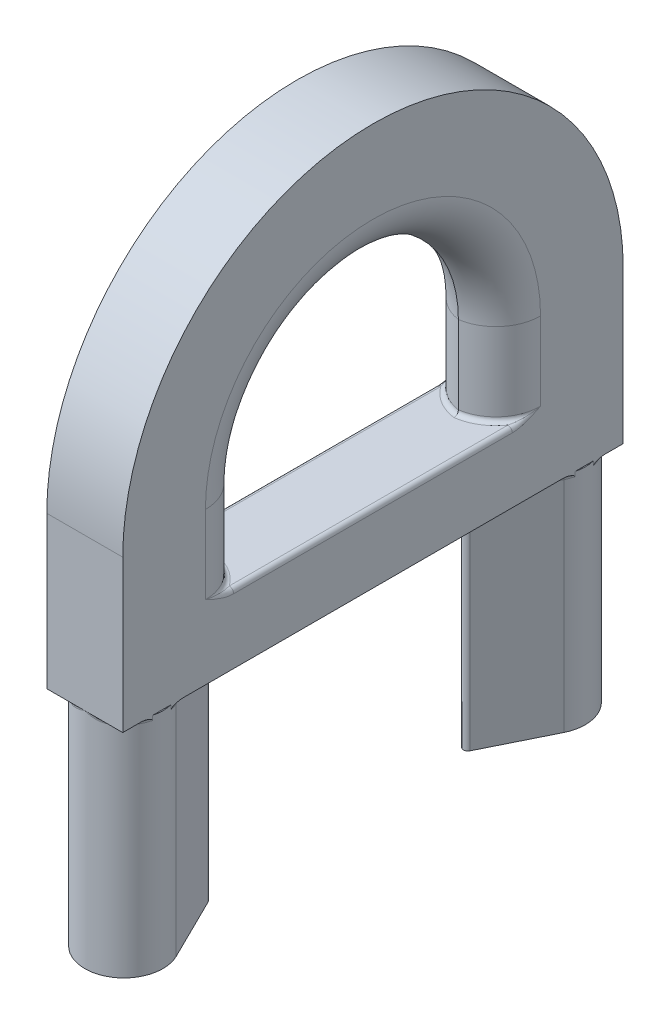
ISO-10303-21;
HEADER;
FILE_DESCRIPTION(('STEP AP214'),'2;1');
FILE_NAME('part.step','',(''),(''),'','','');
FILE_SCHEMA(('AUTOMOTIVE_DESIGN { 1 0 10303 214 1 1 1 1 }'));
ENDSEC;
DATA;
#1=APPLICATION_CONTEXT('core data for automotive mechanical design processes');
#2=APPLICATION_PROTOCOL_DEFINITION('international standard','automotive_design',2000,#1);
#3=PRODUCT_CONTEXT('',#1,'mechanical');
#4=PRODUCT('Part','Part','',(#3));
#5=PRODUCT_RELATED_PRODUCT_CATEGORY('part','',(#4));
#6=PRODUCT_DEFINITION_FORMATION('','',#4);
#7=PRODUCT_DEFINITION_CONTEXT('part definition',#1,'design');
#8=PRODUCT_DEFINITION('design','',#6,#7);
#9=PRODUCT_DEFINITION_SHAPE('','',#8);
#10=(LENGTH_UNIT() NAMED_UNIT(*) SI_UNIT(.MILLI.,.METRE.));
#11=(NAMED_UNIT(*) PLANE_ANGLE_UNIT() SI_UNIT($,.RADIAN.));
#12=(NAMED_UNIT(*) SI_UNIT($,.STERADIAN.) SOLID_ANGLE_UNIT());
#13=UNCERTAINTY_MEASURE_WITH_UNIT(LENGTH_MEASURE(1.E-05),#10,'distance_accuracy_value','');
#14=(GEOMETRIC_REPRESENTATION_CONTEXT(3) GLOBAL_UNCERTAINTY_ASSIGNED_CONTEXT((#13)) GLOBAL_UNIT_ASSIGNED_CONTEXT((#10,
#11,#12)) REPRESENTATION_CONTEXT('',''));
#15=CARTESIAN_POINT('',(0.,0.,0.));
#16=DIRECTION('',(0.,0.,1.));
#17=DIRECTION('',(1.,0.,0.));
#18=AXIS2_PLACEMENT_3D('',#15,#16,#17);
#19=CARTESIAN_POINT('',(-1.7,-6.8,0.));
#20=DIRECTION('',(0.,-1.,0.));
#21=DIRECTION('',(0.,0.,-1.));
#22=AXIS2_PLACEMENT_3D('',#19,#20,#21);
#23=PLANE('',#22);
#24=DIRECTION('',(1.,0.,0.));
#25=VECTOR('',#24,1.);
#26=CARTESIAN_POINT('',(-1.7,-6.8,-11.2));
#27=LINE('',#26,#25);
#28=CARTESIAN_POINT('',(-1.7,-6.8,-11.2));
#29=VERTEX_POINT('',#28);
#30=CARTESIAN_POINT('',(-0.860232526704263,-6.8,-11.2));
#31=VERTEX_POINT('',#30);
#32=EDGE_CURVE('E416',#29,#31,#27,.T.);
#33=ORIENTED_EDGE('',*,*,#32,.T.);
#34=CARTESIAN_POINT('',(0.,-6.8,-9.45));
#35=DIRECTION('',(0.,-1.,0.));
#36=DIRECTION('',(0.,0.,-1.));
#37=AXIS2_PLACEMENT_3D('',#34,#35,#36);
#38=CIRCLE('',#37,1.95);
#39=CARTESIAN_POINT('',(-1.7,-6.8,-10.4052486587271));
#40=VERTEX_POINT('',#39);
#41=EDGE_CURVE('E866',#31,#40,#38,.F.);
#42=ORIENTED_EDGE('',*,*,#41,.T.);
#43=DIRECTION('',(0.,0.,-1.));
#44=VECTOR('',#43,1.);
#45=CARTESIAN_POINT('',(-1.7,-6.8,0.));
#46=LINE('',#45,#44);
#47=EDGE_CURVE('E409',#40,#29,#46,.T.);
#48=ORIENTED_EDGE('',*,*,#47,.T.);
#49=EDGE_LOOP('',(#33,#42,#48));
#50=FACE_BOUND('',#49,.T.);
#51=ADVANCED_FACE('F41',(#50),#23,.T.);
#52=DIRECTION('',(0.,0.,-1.));
#53=VECTOR('',#52,1.);
#54=CARTESIAN_POINT('',(1.7,-6.8,0.));
#55=LINE('',#54,#53);
#56=CARTESIAN_POINT('',(1.7,-6.8,-10.4052486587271));
#57=VERTEX_POINT('',#56);
#58=CARTESIAN_POINT('',(1.7,-6.8,-11.2));
#59=VERTEX_POINT('',#58);
#60=EDGE_CURVE('E395',#57,#59,#55,.T.);
#61=ORIENTED_EDGE('',*,*,#60,.F.);
#62=CARTESIAN_POINT('',(0.,-6.8,-9.45));
#63=DIRECTION('',(0.,-1.,0.));
#64=DIRECTION('',(0.,0.,-1.));
#65=AXIS2_PLACEMENT_3D('',#62,#63,#64);
#66=CIRCLE('',#65,1.95);
#67=CARTESIAN_POINT('',(0.860232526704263,-6.8,-11.2));
#68=VERTEX_POINT('',#67);
#69=EDGE_CURVE('E665',#57,#68,#66,.F.);
#70=ORIENTED_EDGE('',*,*,#69,.T.);
#71=EDGE_CURVE('E421',#68,#59,#27,.T.);
#72=ORIENTED_EDGE('',*,*,#71,.T.);
#73=EDGE_LOOP('',(#61,#70,#72));
#74=FACE_BOUND('',#73,.T.);
#75=ADVANCED_FACE('F692',(#74),#23,.T.);
#76=CARTESIAN_POINT('',(0.,-6.8,5.95142857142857));
#77=DIRECTION('',(0.,-1.,0.));
#78=DIRECTION('',(0.,0.,-1.));
#79=AXIS2_PLACEMENT_3D('',#76,#77,#78);
#80=CIRCLE('',#79,0.4);
#81=CARTESIAN_POINT('',(0.358601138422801,-6.8,5.77421338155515));
#82=VERTEX_POINT('',#81);
#83=CARTESIAN_POINT('',(-0.358601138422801,-6.8,5.77421338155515));
#84=VERTEX_POINT('',#83);
#85=EDGE_CURVE('E913',#82,#84,#80,.F.);
#86=ORIENTED_EDGE('',*,*,#85,.T.);
#87=DIRECTION('',(0.443037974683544,0.,-0.896502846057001));
#88=VECTOR('',#87,1.);
#89=CARTESIAN_POINT('',(1.67153535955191,-6.8,1.66616113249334));
#90=LINE('',#89,#88);
#91=CARTESIAN_POINT('',(-1.7,-6.8,8.48858092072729));
#92=VERTEX_POINT('',#91);
#93=EDGE_CURVE('E1540',#84,#92,#90,.F.);
#94=ORIENTED_EDGE('',*,*,#93,.T.);
#95=CARTESIAN_POINT('',(-1.7,-6.8,-8.48858092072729));
#96=VERTEX_POINT('',#95);
#97=EDGE_CURVE('E415',#92,#96,#46,.T.);
#98=ORIENTED_EDGE('',*,*,#97,.T.);
#99=DIRECTION('',(0.443037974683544,0.,0.896502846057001));
#100=VECTOR('',#99,1.);
#101=CARTESIAN_POINT('',(-0.3586011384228,-6.8,-5.77421338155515));
#102=LINE('',#101,#100);
#103=CARTESIAN_POINT('',(-0.358601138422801,-6.8,-5.77421338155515));
#104=VERTEX_POINT('',#103);
#105=EDGE_CURVE('E1579',#96,#104,#102,.T.);
#106=ORIENTED_EDGE('',*,*,#105,.T.);
#107=CARTESIAN_POINT('',(0.,-6.8,-5.95142857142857));
#108=DIRECTION('',(0.,-1.,0.));
#109=DIRECTION('',(0.,0.,-1.));
#110=AXIS2_PLACEMENT_3D('',#107,#108,#109);
#111=CIRCLE('',#110,0.4);
#112=CARTESIAN_POINT('',(0.3586011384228,-6.8,-5.77421338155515));
#113=VERTEX_POINT('',#112);
#114=EDGE_CURVE('E852',#104,#113,#111,.F.);
#115=ORIENTED_EDGE('',*,*,#114,.T.);
#116=DIRECTION('',(-0.443037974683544,0.,0.896502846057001));
#117=VECTOR('',#116,1.);
#118=CARTESIAN_POINT('',(-2.33889635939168,-6.8,-0.315732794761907));
#119=LINE('',#118,#117);
#120=CARTESIAN_POINT('',(1.7,-6.8,-8.4885809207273));
#121=VERTEX_POINT('',#120);
#122=EDGE_CURVE('E1538',#113,#121,#119,.F.);
#123=ORIENTED_EDGE('',*,*,#122,.T.);
#124=CARTESIAN_POINT('',(1.7,-6.8,8.48858092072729));
#125=VERTEX_POINT('',#124);
#126=EDGE_CURVE('E1073',#125,#121,#55,.T.);
#127=ORIENTED_EDGE('',*,*,#126,.F.);
#128=DIRECTION('',(-0.443037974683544,0.,-0.896502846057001));
#129=VECTOR('',#128,1.);
#130=CARTESIAN_POINT('',(0.358601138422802,-6.8,5.77421338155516));
#131=LINE('',#130,#129);
#132=EDGE_CURVE('E1537',#125,#82,#131,.T.);
#133=ORIENTED_EDGE('',*,*,#132,.T.);
#134=EDGE_LOOP('',(#86,#94,#98,#106,#115,#123,#127,#133));
#135=FACE_BOUND('',#134,.T.);
#136=ADVANCED_FACE('F698',(#135),#23,.T.);
#137=CARTESIAN_POINT('',(-1.7,-6.8,11.2));
#138=VERTEX_POINT('',#137);
#139=CARTESIAN_POINT('',(-1.7,-6.8,10.4052486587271));
#140=VERTEX_POINT('',#139);
#141=EDGE_CURVE('E410',#138,#140,#46,.T.);
#142=ORIENTED_EDGE('',*,*,#141,.T.);
#143=CARTESIAN_POINT('',(0.,-6.8,9.45));
#144=DIRECTION('',(0.,-1.,0.));
#145=DIRECTION('',(0.,0.,-1.));
#146=AXIS2_PLACEMENT_3D('',#143,#144,#145);
#147=CIRCLE('',#146,1.95);
#148=CARTESIAN_POINT('',(-0.860232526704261,-6.8,11.2));
#149=VERTEX_POINT('',#148);
#150=EDGE_CURVE('E712',#140,#149,#147,.F.);
#151=ORIENTED_EDGE('',*,*,#150,.T.);
#152=DIRECTION('',(1.,0.,0.));
#153=VECTOR('',#152,1.);
#154=CARTESIAN_POINT('',(-1.7,-6.8,11.2));
#155=LINE('',#154,#153);
#156=EDGE_CURVE('E423',#138,#149,#155,.T.);
#157=ORIENTED_EDGE('',*,*,#156,.F.);
#158=EDGE_LOOP('',(#142,#151,#157));
#159=FACE_BOUND('',#158,.T.);
#160=ADVANCED_FACE('F694',(#159),#23,.T.);
#161=CARTESIAN_POINT('',(0.860232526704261,-6.8,11.2));
#162=VERTEX_POINT('',#161);
#163=CARTESIAN_POINT('',(1.7,-6.8,11.2));
#164=VERTEX_POINT('',#163);
#165=EDGE_CURVE('E427',#162,#164,#155,.T.);
#166=ORIENTED_EDGE('',*,*,#165,.F.);
#167=CARTESIAN_POINT('',(0.,-6.8,9.45));
#168=DIRECTION('',(0.,-1.,0.));
#169=DIRECTION('',(0.,0.,-1.));
#170=AXIS2_PLACEMENT_3D('',#167,#168,#169);
#171=CIRCLE('',#170,1.95);
#172=CARTESIAN_POINT('',(1.7,-6.8,10.4052486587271));
#173=VERTEX_POINT('',#172);
#174=EDGE_CURVE('E822',#162,#173,#171,.F.);
#175=ORIENTED_EDGE('',*,*,#174,.T.);
#176=EDGE_CURVE('E396',#164,#173,#55,.T.);
#177=ORIENTED_EDGE('',*,*,#176,.F.);
#178=EDGE_LOOP('',(#166,#175,#177));
#179=FACE_BOUND('',#178,.T.);
#180=ADVANCED_FACE('F702',(#179),#23,.T.);
#181=CARTESIAN_POINT('',(-1.7,-3.7,0.));
#182=DIRECTION('',(0.,-1.,0.));
#183=DIRECTION('',(0.,0.,-1.));
#184=AXIS2_PLACEMENT_3D('',#181,#182,#183);
#185=PLANE('',#184);
#186=CARTESIAN_POINT('',(-0.3,-3.7,-7.5));
#187=DIRECTION('',(0.,-1.,0.));
#188=DIRECTION('',(0.,0.,-1.));
#189=AXIS2_PLACEMENT_3D('',#186,#187,#188);
#190=CIRCLE('',#189,2.2);
#191=CARTESIAN_POINT('',(1.5,-3.7,-6.23508893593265));
#192=VERTEX_POINT('',#191);
#193=CARTESIAN_POINT('',(0.,-3.7,-5.32055052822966));
#194=VERTEX_POINT('',#193);
#195=EDGE_CURVE('E482',#192,#194,#190,.T.);
#196=ORIENTED_EDGE('',*,*,#195,.T.);
#197=CARTESIAN_POINT('',(0.3,-3.7,-7.5));
#198=DIRECTION('',(0.,-1.,0.));
#199=DIRECTION('',(0.,0.,-1.));
#200=AXIS2_PLACEMENT_3D('',#197,#198,#199);
#201=CIRCLE('',#200,2.2);
#202=CARTESIAN_POINT('',(-1.5,-3.7,-6.23508893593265));
#203=VERTEX_POINT('',#202);
#204=EDGE_CURVE('E488',#194,#203,#201,.T.);
#205=ORIENTED_EDGE('',*,*,#204,.T.);
#206=DIRECTION('',(0.,0.,-1.));
#207=VECTOR('',#206,1.);
#208=CARTESIAN_POINT('',(-1.5,-3.7,0.));
#209=LINE('',#208,#207);
#210=CARTESIAN_POINT('',(-1.5,-3.7,6.23508893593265));
#211=VERTEX_POINT('',#210);
#212=EDGE_CURVE('E486',#203,#211,#209,.F.);
#213=ORIENTED_EDGE('',*,*,#212,.T.);
#214=CARTESIAN_POINT('',(0.3,-3.7,7.5));
#215=DIRECTION('',(0.,-1.,0.));
#216=DIRECTION('',(0.,0.,-1.));
#217=AXIS2_PLACEMENT_3D('',#214,#215,#216);
#218=CIRCLE('',#217,2.2);
#219=CARTESIAN_POINT('',(0.,-3.7,5.32055052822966));
#220=VERTEX_POINT('',#219);
#221=EDGE_CURVE('E484',#211,#220,#218,.T.);
#222=ORIENTED_EDGE('',*,*,#221,.T.);
#223=CARTESIAN_POINT('',(-0.3,-3.7,7.5));
#224=DIRECTION('',(0.,-1.,0.));
#225=DIRECTION('',(0.,0.,-1.));
#226=AXIS2_PLACEMENT_3D('',#223,#224,#225);
#227=CIRCLE('',#226,2.2);
#228=CARTESIAN_POINT('',(1.5,-3.7,6.23508893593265));
#229=VERTEX_POINT('',#228);
#230=EDGE_CURVE('E480',#220,#229,#227,.T.);
#231=ORIENTED_EDGE('',*,*,#230,.T.);
#232=DIRECTION('',(0.,0.,-1.));
#233=VECTOR('',#232,1.);
#234=CARTESIAN_POINT('',(1.5,-3.7,-7.5));
#235=LINE('',#234,#233);
#236=EDGE_CURVE('E457',#229,#192,#235,.T.);
#237=ORIENTED_EDGE('',*,*,#236,.T.);
#238=EDGE_LOOP('',(#196,#205,#213,#222,#231,#237));
#239=FACE_BOUND('',#238,.T.);
#240=ADVANCED_FACE('F529',(#239),#185,.F.);
#241=CARTESIAN_POINT('',(-1.7,0.,-11.2));
#242=DIRECTION('',(0.,0.,1.));
#243=DIRECTION('',(1.,0.,0.));
#244=AXIS2_PLACEMENT_3D('',#241,#242,#243);
#245=PLANE('',#244);
#246=DIRECTION('',(1.,0.,0.));
#247=VECTOR('',#246,1.);
#248=CARTESIAN_POINT('',(-1.7,0.,-11.2));
#249=LINE('',#248,#247);
#250=CARTESIAN_POINT('',(-1.7,0.,-11.2));
#251=VERTEX_POINT('',#250);
#252=CARTESIAN_POINT('',(1.7,0.,-11.2));
#253=VERTEX_POINT('',#252);
#254=EDGE_CURVE('E413',#251,#253,#249,.T.);
#255=ORIENTED_EDGE('',*,*,#254,.T.);
#256=DIRECTION('',(0.,-1.,0.));
#257=VECTOR('',#256,1.);
#258=CARTESIAN_POINT('',(1.7,0.,-11.2));
#259=LINE('',#258,#257);
#260=EDGE_CURVE('E384',#253,#59,#259,.T.);
#261=ORIENTED_EDGE('',*,*,#260,.T.);
#262=ORIENTED_EDGE('',*,*,#71,.F.);
#263=CARTESIAN_POINT('',(0.,-6.8,-11.2));
#264=VERTEX_POINT('',#263);
#265=EDGE_CURVE('E422',#264,#68,#27,.T.);
#266=ORIENTED_EDGE('',*,*,#265,.F.);
#267=EDGE_CURVE('E420',#31,#264,#27,.T.);
#268=ORIENTED_EDGE('',*,*,#267,.F.);
#269=ORIENTED_EDGE('',*,*,#32,.F.);
#270=DIRECTION('',(0.,-1.,0.));
#271=VECTOR('',#270,1.);
#272=CARTESIAN_POINT('',(-1.7,0.,-11.2));
#273=LINE('',#272,#271);
#274=EDGE_CURVE('E399',#251,#29,#273,.T.);
#275=ORIENTED_EDGE('',*,*,#274,.F.);
#276=EDGE_LOOP('',(#255,#261,#262,#266,#268,#269,#275));
#277=FACE_BOUND('',#276,.T.);
#278=ADVANCED_FACE('F759',(#277),#245,.F.);
#279=CARTESIAN_POINT('',(-1.7,0.,11.2));
#280=DIRECTION('',(0.,0.,1.));
#281=DIRECTION('',(1.,0.,0.));
#282=AXIS2_PLACEMENT_3D('',#279,#280,#281);
#283=PLANE('',#282);
#284=ORIENTED_EDGE('',*,*,#156,.T.);
#285=CARTESIAN_POINT('',(0.,-6.8,11.2));
#286=VERTEX_POINT('',#285);
#287=EDGE_CURVE('E426',#149,#286,#155,.T.);
#288=ORIENTED_EDGE('',*,*,#287,.T.);
#289=EDGE_CURVE('E428',#286,#162,#155,.T.);
#290=ORIENTED_EDGE('',*,*,#289,.T.);
#291=ORIENTED_EDGE('',*,*,#165,.T.);
#292=DIRECTION('',(0.,-1.,0.));
#293=VECTOR('',#292,1.);
#294=CARTESIAN_POINT('',(1.7,0.,11.2));
#295=LINE('',#294,#293);
#296=CARTESIAN_POINT('',(1.7,0.,11.2));
#297=VERTEX_POINT('',#296);
#298=EDGE_CURVE('E392',#297,#164,#295,.T.);
#299=ORIENTED_EDGE('',*,*,#298,.F.);
#300=DIRECTION('',(1.,0.,0.));
#301=VECTOR('',#300,1.);
#302=CARTESIAN_POINT('',(-1.7,0.,11.2));
#303=LINE('',#302,#301);
#304=CARTESIAN_POINT('',(-1.7,0.,11.2));
#305=VERTEX_POINT('',#304);
#306=EDGE_CURVE('E429',#305,#297,#303,.T.);
#307=ORIENTED_EDGE('',*,*,#306,.F.);
#308=DIRECTION('',(0.,-1.,0.));
#309=VECTOR('',#308,1.);
#310=CARTESIAN_POINT('',(-1.7,0.,11.2));
#311=LINE('',#310,#309);
#312=EDGE_CURVE('E406',#305,#138,#311,.T.);
#313=ORIENTED_EDGE('',*,*,#312,.T.);
#314=EDGE_LOOP('',(#284,#288,#290,#291,#299,#307,#313));
#315=FACE_BOUND('',#314,.T.);
#316=ADVANCED_FACE('F784',(#315),#283,.T.);
#317=CARTESIAN_POINT('',(-1.7,0.,0.));
#318=DIRECTION('',(1.,0.,0.));
#319=DIRECTION('',(0.,0.,-1.));
#320=AXIS2_PLACEMENT_3D('',#317,#318,#319);
#321=CYLINDRICAL_SURFACE('',#320,11.2);
#322=ORIENTED_EDGE('',*,*,#306,.T.);
#323=CARTESIAN_POINT('',(1.7,0.,0.));
#324=DIRECTION('',(1.,0.,0.));
#325=DIRECTION('',(0.,0.,-1.));
#326=AXIS2_PLACEMENT_3D('',#323,#324,#325);
#327=CIRCLE('',#326,11.2);
#328=EDGE_CURVE('E389',#253,#297,#327,.T.);
#329=ORIENTED_EDGE('',*,*,#328,.F.);
#330=ORIENTED_EDGE('',*,*,#254,.F.);
#331=CARTESIAN_POINT('',(-1.7,0.,0.));
#332=DIRECTION('',(1.,0.,0.));
#333=DIRECTION('',(0.,0.,-1.));
#334=AXIS2_PLACEMENT_3D('',#331,#332,#333);
#335=CIRCLE('',#334,11.2);
#336=EDGE_CURVE('E403',#251,#305,#335,.T.);
#337=ORIENTED_EDGE('',*,*,#336,.T.);
#338=EDGE_LOOP('',(#322,#329,#330,#337));
#339=FACE_BOUND('',#338,.T.);
#340=ADVANCED_FACE('F526',(#339),#321,.T.);
#341=CARTESIAN_POINT('',(-1.7,0.,0.));
#342=DIRECTION('',(1.,0.,0.));
#343=DIRECTION('',(0.,0.,-1.));
#344=AXIS2_PLACEMENT_3D('',#341,#342,#343);
#345=PLANE('',#344);
#346=ORIENTED_EDGE('',*,*,#274,.T.);
#347=ORIENTED_EDGE('',*,*,#47,.F.);
#348=CARTESIAN_POINT('',(-1.7,-6.8,-10.4052486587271));
#349=CARTESIAN_POINT('',(-1.7,-6.80003254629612,-10.377173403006));
#350=CARTESIAN_POINT('',(-1.7,-6.80141711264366,-10.3491294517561));
#351=CARTESIAN_POINT('',(-1.7,-6.80657144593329,-10.2932523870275));
#352=CARTESIAN_POINT('',(-1.7,-6.81034162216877,-10.2654193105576));
#353=CARTESIAN_POINT('',(-1.7,-6.81996739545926,-10.210010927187));
#354=CARTESIAN_POINT('',(-1.7,-6.82583130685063,-10.1824371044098));
#355=CARTESIAN_POINT('',(-1.7,-6.83953675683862,-10.1277916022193));
#356=CARTESIAN_POINT('',(-1.7,-6.84737745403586,-10.1007197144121));
#357=CARTESIAN_POINT('',(-1.7,-6.86077722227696,-10.0605482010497));
#358=CARTESIAN_POINT('',(-1.7,-6.86553797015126,-10.0471809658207));
#359=CARTESIAN_POINT('',(-1.7,-6.87567694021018,-10.0207072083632));
#360=CARTESIAN_POINT('',(-1.7,-6.88105426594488,-10.0076003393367));
#361=CARTESIAN_POINT('',(-1.7,-6.89485791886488,-9.97650158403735));
#362=CARTESIAN_POINT('',(-1.7,-6.90364241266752,-9.95865752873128));
#363=CARTESIAN_POINT('',(-1.7,-6.91876815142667,-9.93259707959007));
#364=CARTESIAN_POINT('',(-1.7,-6.92424859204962,-9.92388274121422));
#365=CARTESIAN_POINT('',(-1.7,-6.93613267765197,-9.90710500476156));
#366=CARTESIAN_POINT('',(-1.7,-6.94253300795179,-9.8990394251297));
#367=CARTESIAN_POINT('',(-1.7,-6.95256160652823,-9.88867821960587));
#368=CARTESIAN_POINT('',(-1.7,-6.95557999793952,-9.88579965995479));
#369=CARTESIAN_POINT('',(-1.7,-6.96191972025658,-9.88038522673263));
#370=CARTESIAN_POINT('',(-1.7,-6.96524115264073,-9.87784946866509));
#371=CARTESIAN_POINT('',(-1.7,-6.97164195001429,-9.87367828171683));
#372=CARTESIAN_POINT('',(-1.7,-6.97466847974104,-9.87196318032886));
#373=CARTESIAN_POINT('',(-1.7,-6.98095205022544,-9.86904389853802));
#374=CARTESIAN_POINT('',(-1.7,-6.98420796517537,-9.86783740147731));
#375=CARTESIAN_POINT('',(-1.7,-6.98957407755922,-9.86643264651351));
#376=CARTESIAN_POINT('',(-1.7,-6.99162963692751,-9.86602440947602));
#377=CARTESIAN_POINT('',(-1.7,-6.99578891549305,-9.86547149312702));
#378=CARTESIAN_POINT('',(-1.7,-6.99789285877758,-9.86532851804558));
#379=CARTESIAN_POINT('',(-1.7,-7.0000000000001,-9.86533119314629));
#380=B_SPLINE_CURVE_WITH_KNOTS('',3,(#348,#349,#350,#351,#352,#353,#354,#355,#356,#357,#358,
#359,#360,#361,#362,#363,#364,#365,#366,#367,#368,#369,#370,#371,#372,#373,#374,#375,#376,#377,
#378,#379),.UNSPECIFIED.,.F.,.F.,(4,2,2,2,2,2,2,2,2,2,2,2,2,2,2,4),(0.,0.0841501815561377,
0.168314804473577,0.252817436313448,0.337284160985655,0.379838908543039,0.422332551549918,
0.481859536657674,0.512718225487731,0.543468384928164,0.555964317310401,0.568464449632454,
0.578868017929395,0.589223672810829,0.59549471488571,0.60180590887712),.UNSPECIFIED.);
#381=CARTESIAN_POINT('',(-1.7,-7.,-9.86533119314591));
#382=VERTEX_POINT('',#381);
#383=EDGE_CURVE('E558',#40,#382,#380,.T.);
#384=ORIENTED_EDGE('',*,*,#383,.T.);
#385=DIRECTION('',(0.,1.,0.));
#386=VECTOR('',#385,1.);
#387=CARTESIAN_POINT('',(-1.7,-6.8,-9.8653311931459));
#388=LINE('',#387,#386);
#389=CARTESIAN_POINT('',(-1.7,-6.8,-9.8653311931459));
#390=VERTEX_POINT('',#389);
#391=EDGE_CURVE('E1571',#390,#382,#388,.F.);
#392=ORIENTED_EDGE('',*,*,#391,.F.);
#393=DIRECTION('',(0.,0.,-1.));
#394=VECTOR('',#393,1.);
#395=CARTESIAN_POINT('',(-1.7,-6.8,0.));
#396=LINE('',#395,#394);
#397=CARTESIAN_POINT('',(-1.7,-6.8,-9.0346688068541));
#398=VERTEX_POINT('',#397);
#399=EDGE_CURVE('E363',#398,#390,#396,.T.);
#400=ORIENTED_EDGE('',*,*,#399,.F.);
#401=DIRECTION('',(0.,1.,0.));
#402=VECTOR('',#401,1.);
#403=CARTESIAN_POINT('',(-1.7,-16.8,-9.0346688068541));
#404=LINE('',#403,#402);
#405=CARTESIAN_POINT('',(-1.7,-7.,-9.0346688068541));
#406=VERTEX_POINT('',#405);
#407=EDGE_CURVE('E718',#406,#398,#404,.T.);
#408=ORIENTED_EDGE('',*,*,#407,.F.);
#409=CARTESIAN_POINT('',(-1.7,-6.80735599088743,-8.6098860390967));
#410=CARTESIAN_POINT('',(-1.7,-6.81040358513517,-8.63437762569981));
#411=CARTESIAN_POINT('',(-1.7,-6.81428044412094,-8.65876291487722));
#412=CARTESIAN_POINT('',(-1.7,-6.82362962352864,-8.70725534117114));
#413=CARTESIAN_POINT('',(-1.7,-6.82910377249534,-8.73136212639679));
#414=CARTESIAN_POINT('',(-1.7,-6.84146030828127,-8.77872739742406));
#415=CARTESIAN_POINT('',(-1.7,-6.84831439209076,-8.80199331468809));
#416=CARTESIAN_POINT('',(-1.7,-6.86360280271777,-8.84801487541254));
#417=CARTESIAN_POINT('',(-1.7,-6.87203708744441,-8.8707705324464));
#418=CARTESIAN_POINT('',(-1.7,-6.88644995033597,-8.90481422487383));
#419=CARTESIAN_POINT('',(-1.7,-6.89169220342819,-8.91641550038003));
#420=CARTESIAN_POINT('',(-1.7,-6.90289837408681,-8.93926106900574));
#421=CARTESIAN_POINT('',(-1.7,-6.90886136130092,-8.95050579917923));
#422=CARTESIAN_POINT('',(-1.7,-6.92192834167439,-8.97262141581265));
#423=CARTESIAN_POINT('',(-1.7,-6.92905408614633,-8.9834790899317));
#424=CARTESIAN_POINT('',(-1.7,-6.9449742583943,-9.003891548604));
#425=CARTESIAN_POINT('',(-1.7,-6.95374311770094,-9.01346287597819));
#426=CARTESIAN_POINT('',(-1.7,-6.96687373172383,-9.02325641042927));
#427=CARTESIAN_POINT('',(-1.7,-6.96986143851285,-9.02524746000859));
#428=CARTESIAN_POINT('',(-1.7,-6.97609487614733,-9.0287694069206));
#429=CARTESIAN_POINT('',(-1.7,-6.97933990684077,-9.0303015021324));
#430=CARTESIAN_POINT('',(-1.7,-6.98534785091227,-9.03248286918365));
#431=CARTESIAN_POINT('',(-1.7,-6.98806710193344,-9.03325044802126));
#432=CARTESIAN_POINT('',(-1.7,-6.99359943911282,-9.0343177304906));
#433=CARTESIAN_POINT('',(-1.7,-6.99641252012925,-9.0346174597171));
#434=CARTESIAN_POINT('',(-1.7,-7.0020459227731,-9.03470763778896));
#435=CARTESIAN_POINT('',(-1.7,-7.00486624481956,-9.03449805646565));
#436=CARTESIAN_POINT('',(-1.7,-7.01044519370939,-9.0336052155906));
#437=CARTESIAN_POINT('',(-1.7,-7.01320346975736,-9.03291974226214));
#438=CARTESIAN_POINT('',(-1.7,-7.01588255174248,-9.03201540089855));
#439=B_SPLINE_CURVE_WITH_KNOTS('',3,(#409,#410,#411,#412,#413,#414,#415,#416,#417,#418,#419,
#420,#421,#422,#423,#424,#425,#426,#427,#428,#429,#430,#431,#432,#433,#434,#435,#436,#437,#438),
.UNSPECIFIED.,.F.,.F.,(4,2,2,2,2,2,2,2,2,2,2,2,2,2,4),(0.,0.0740231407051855,0.148131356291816,
0.220851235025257,0.293569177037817,0.331748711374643,0.369879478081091,0.408829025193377,
0.447216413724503,0.45795840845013,0.468672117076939,0.477114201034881,0.485555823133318,
0.493997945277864,0.502479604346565),.UNSPECIFIED.);
#440=CARTESIAN_POINT('',(-1.7,-6.80735599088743,-8.6098860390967));
#441=VERTEX_POINT('',#440);
#442=EDGE_CURVE('E11',#406,#441,#439,.F.);
#443=ORIENTED_EDGE('',*,*,#442,.T.);
#444=CARTESIAN_POINT('',(-1.7,-7.,-8.48858092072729));
#445=DIRECTION('',(1.,0.,0.));
#446=DIRECTION('',(0.,0.,-1.));
#447=AXIS2_PLACEMENT_3D('',#444,#445,#446);
#448=ELLIPSE('',#447,0.451428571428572,0.2);
#449=EDGE_CURVE('E1526',#441,#96,#448,.T.);
#450=ORIENTED_EDGE('',*,*,#449,.T.);
#451=ORIENTED_EDGE('',*,*,#97,.F.);
#452=CARTESIAN_POINT('',(-1.7,-7.,8.4885809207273));
#453=DIRECTION('',(1.,0.,0.));
#454=DIRECTION('',(0.,0.,-1.));
#455=AXIS2_PLACEMENT_3D('',#452,#453,#454);
#456=ELLIPSE('',#455,0.451428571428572,0.2);
#457=CARTESIAN_POINT('',(-1.7,-6.80735599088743,8.6098860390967));
#458=VERTEX_POINT('',#457);
#459=EDGE_CURVE('E573',#92,#458,#456,.T.);
#460=ORIENTED_EDGE('',*,*,#459,.T.);
#461=CARTESIAN_POINT('',(-1.7,-6.80735599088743,8.6098860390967));
#462=CARTESIAN_POINT('',(-1.7,-6.81040358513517,8.63437762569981));
#463=CARTESIAN_POINT('',(-1.7,-6.81428044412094,8.65876291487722));
#464=CARTESIAN_POINT('',(-1.7,-6.82362962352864,8.70725534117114));
#465=CARTESIAN_POINT('',(-1.7,-6.82910377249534,8.73136212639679));
#466=CARTESIAN_POINT('',(-1.7,-6.84146030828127,8.77872739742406));
#467=CARTESIAN_POINT('',(-1.7,-6.84831439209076,8.8019933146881));
#468=CARTESIAN_POINT('',(-1.7,-6.86360280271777,8.84801487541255));
#469=CARTESIAN_POINT('',(-1.7,-6.87203708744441,8.8707705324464));
#470=CARTESIAN_POINT('',(-1.7,-6.88644995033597,8.90481422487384));
#471=CARTESIAN_POINT('',(-1.7,-6.89169220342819,8.91641550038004));
#472=CARTESIAN_POINT('',(-1.7,-6.90289837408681,8.93926106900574));
#473=CARTESIAN_POINT('',(-1.7,-6.90886136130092,8.95050579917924));
#474=CARTESIAN_POINT('',(-1.7,-6.92192834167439,8.97262141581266));
#475=CARTESIAN_POINT('',(-1.7,-6.92905408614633,8.98347908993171));
#476=CARTESIAN_POINT('',(-1.7,-6.9449742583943,9.003891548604));
#477=CARTESIAN_POINT('',(-1.7,-6.95374311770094,9.01346287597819));
#478=CARTESIAN_POINT('',(-1.7,-6.96687373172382,9.02325641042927));
#479=CARTESIAN_POINT('',(-1.7,-6.96986143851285,9.02524746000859));
#480=CARTESIAN_POINT('',(-1.7,-6.97609487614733,9.0287694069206));
#481=CARTESIAN_POINT('',(-1.7,-6.97933990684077,9.03030150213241));
#482=CARTESIAN_POINT('',(-1.7,-6.98534785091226,9.03248286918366));
#483=CARTESIAN_POINT('',(-1.7,-6.98806710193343,9.03325044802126));
#484=CARTESIAN_POINT('',(-1.7,-6.99359943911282,9.0343177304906));
#485=CARTESIAN_POINT('',(-1.7,-6.99641252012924,9.0346174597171));
#486=CARTESIAN_POINT('',(-1.7,-7.00204592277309,9.03470763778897));
#487=CARTESIAN_POINT('',(-1.7,-7.00486624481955,9.03449805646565));
#488=CARTESIAN_POINT('',(-1.7,-7.01044519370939,9.0336052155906));
#489=CARTESIAN_POINT('',(-1.7,-7.01320346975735,9.03291974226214));
#490=CARTESIAN_POINT('',(-1.7,-7.01588255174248,9.03201540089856));
#491=B_SPLINE_CURVE_WITH_KNOTS('',3,(#461,#462,#463,#464,#465,#466,#467,#468,#469,#470,#471,
#472,#473,#474,#475,#476,#477,#478,#479,#480,#481,#482,#483,#484,#485,#486,#487,#488,#489,#490),
.UNSPECIFIED.,.F.,.F.,(4,2,2,2,2,2,2,2,2,2,2,2,2,2,4),(0.,0.0740231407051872,0.14813135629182,
0.220851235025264,0.293569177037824,0.33174871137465,0.369879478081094,0.408829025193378,
0.447216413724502,0.457958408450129,0.468672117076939,0.477114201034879,0.485555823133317,
0.493997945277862,0.502479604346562),.UNSPECIFIED.);
#492=CARTESIAN_POINT('',(-1.7,-7.,9.0346688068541));
#493=VERTEX_POINT('',#492);
#494=EDGE_CURVE('E565',#458,#493,#491,.T.);
#495=ORIENTED_EDGE('',*,*,#494,.T.);
#496=DIRECTION('',(0.,1.,0.));
#497=VECTOR('',#496,1.);
#498=CARTESIAN_POINT('',(-1.7,-16.8,9.0346688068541));
#499=LINE('',#498,#497);
#500=CARTESIAN_POINT('',(-1.7,-6.8,9.0346688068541));
#501=VERTEX_POINT('',#500);
#502=EDGE_CURVE('E71',#501,#493,#499,.F.);
#503=ORIENTED_EDGE('',*,*,#502,.F.);
#504=CARTESIAN_POINT('',(-1.7,-6.8,9.8653311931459));
#505=VERTEX_POINT('',#504);
#506=EDGE_CURVE('E414',#505,#501,#46,.T.);
#507=ORIENTED_EDGE('',*,*,#506,.F.);
#508=DIRECTION('',(0.,1.,0.));
#509=VECTOR('',#508,1.);
#510=CARTESIAN_POINT('',(-1.7,-7.,9.8653311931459));
#511=LINE('',#510,#509);
#512=CARTESIAN_POINT('',(-1.7,-7.,9.8653311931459));
#513=VERTEX_POINT('',#512);
#514=EDGE_CURVE('E1067',#513,#505,#511,.T.);
#515=ORIENTED_EDGE('',*,*,#514,.F.);
#516=CARTESIAN_POINT('',(-1.7,-7.,9.8653311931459));
#517=CARTESIAN_POINT('',(-1.7,-6.99649904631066,9.86531585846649));
#518=CARTESIAN_POINT('',(-1.7,-6.99302492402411,9.86571783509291));
#519=CARTESIAN_POINT('',(-1.7,-6.98629229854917,9.86719612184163));
#520=CARTESIAN_POINT('',(-1.7,-6.9830308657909,9.86825872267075));
#521=CARTESIAN_POINT('',(-1.7,-6.97588189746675,9.87126949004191));
#522=CARTESIAN_POINT('',(-1.7,-6.97206527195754,9.87337989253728));
#523=CARTESIAN_POINT('',(-1.7,-6.96478096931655,9.87817391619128));
#524=CARTESIAN_POINT('',(-1.7,-6.96131656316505,9.88086229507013));
#525=CARTESIAN_POINT('',(-1.7,-6.94990715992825,9.89075608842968));
#526=CARTESIAN_POINT('',(-1.7,-6.94275642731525,9.89885464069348));
#527=CARTESIAN_POINT('',(-1.7,-6.9296065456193,9.91591933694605));
#528=CARTESIAN_POINT('',(-1.7,-6.92361380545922,9.92488991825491));
#529=CARTESIAN_POINT('',(-1.7,-6.90842904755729,9.94979239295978));
#530=CARTESIAN_POINT('',(-1.7,-6.89996546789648,9.96616757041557));
#531=CARTESIAN_POINT('',(-1.7,-6.88438173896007,9.99955450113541));
#532=CARTESIAN_POINT('',(-1.7,-6.87726487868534,10.0165676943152));
#533=CARTESIAN_POINT('',(-1.7,-6.86406104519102,10.0510306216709));
#534=CARTESIAN_POINT('',(-1.7,-6.85797623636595,10.0684811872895));
#535=CARTESIAN_POINT('',(-1.7,-6.84671779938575,10.1036510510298));
#536=CARTESIAN_POINT('',(-1.7,-6.84154328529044,10.1213700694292));
#537=CARTESIAN_POINT('',(-1.7,-6.83098197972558,10.1610514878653));
#538=CARTESIAN_POINT('',(-1.7,-6.8258095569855,10.1830713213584));
#539=CARTESIAN_POINT('',(-1.7,-6.8167713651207,10.2273824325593));
#540=CARTESIAN_POINT('',(-1.7,-6.81290589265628,10.249673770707));
#541=CARTESIAN_POINT('',(-1.7,-6.80663221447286,10.2941203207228));
#542=CARTESIAN_POINT('',(-1.7,-6.80420278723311,10.3162724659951));
#543=CARTESIAN_POINT('',(-1.7,-6.80089320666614,10.3606944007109));
#544=CARTESIAN_POINT('',(-1.7,-6.80001334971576,10.3829642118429));
#545=CARTESIAN_POINT('',(-1.7,-6.8,10.4052486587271));
#546=B_SPLINE_CURVE_WITH_KNOTS('',3,(#516,#517,#518,#519,#520,#521,#522,#523,#524,#525,#526,
#527,#528,#529,#530,#531,#532,#533,#534,#535,#536,#537,#538,#539,#540,#541,#542,#543,#544,#545),
.UNSPECIFIED.,.F.,.F.,(4,2,2,2,2,2,2,2,2,2,2,2,2,2,4),(0.,0.0104372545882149,0.0206648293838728,
0.033673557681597,0.0467937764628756,0.0789552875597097,0.111289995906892,0.166453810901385,
0.221750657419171,0.277162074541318,0.332519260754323,0.400336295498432,0.468168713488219,
0.534971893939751,0.601787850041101),.UNSPECIFIED.);
#547=EDGE_CURVE('E551',#513,#140,#546,.T.);
#548=ORIENTED_EDGE('',*,*,#547,.T.);
#549=ORIENTED_EDGE('',*,*,#141,.F.);
#550=ORIENTED_EDGE('',*,*,#312,.F.);
#551=ORIENTED_EDGE('',*,*,#336,.F.);
#552=EDGE_LOOP('',(#346,#347,#384,#392,#400,#408,#443,#450,#451,#460,#495,#503,#507,#515,#548,
#549,#550,#551));
#553=FACE_BOUND('',#552,.T.);
#554=DIRECTION('',(0.,-1.,0.));
#555=VECTOR('',#554,1.);
#556=CARTESIAN_POINT('',(-1.7,0.,7.5));
#557=LINE('',#556,#555);
#558=CARTESIAN_POINT('',(-1.7,0.,7.5));
#559=VERTEX_POINT('',#558);
#560=CARTESIAN_POINT('',(-1.7,-3.5,7.5));
#561=VERTEX_POINT('',#560);
#562=EDGE_CURVE('E445',#559,#561,#557,.T.);
#563=ORIENTED_EDGE('',*,*,#562,.T.);
#564=CARTESIAN_POINT('',(-1.7,-3.84040215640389,5.89737633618));
#565=CARTESIAN_POINT('',(-1.7,-3.56036337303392,6.01229172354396));
#566=CARTESIAN_POINT('',(-1.42155536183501,-3.67020107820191,5.96721924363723));
#567=CARTESIAN_POINT('',(-1.7,-3.8572443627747,5.93868768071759));
#568=CARTESIAN_POINT('',(-1.7,-3.58435572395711,6.02732012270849));
#569=CARTESIAN_POINT('',(-1.43090711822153,-3.67862218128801,5.99836758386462));
#570=CARTESIAN_POINT('',(-1.7,-3.86995507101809,5.98138593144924));
#571=CARTESIAN_POINT('',(-1.7,-3.60721517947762,6.04998153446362));
#572=CARTESIAN_POINT('',(-1.44071632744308,-3.68497753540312,6.03114837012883));
#573=CARTESIAN_POINT('',(-1.7,-3.88842017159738,6.06799792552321));
#574=CARTESIAN_POINT('',(-1.7,-3.64679183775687,6.10467512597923));
#575=CARTESIAN_POINT('',(-1.4607934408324,-3.69421008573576,6.09895953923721));
#576=CARTESIAN_POINT('',(-1.7,-3.89422152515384,6.11190136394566));
#577=CARTESIAN_POINT('',(-1.7,-3.66396918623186,6.13612129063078));
#578=CARTESIAN_POINT('',(-1.47105775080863,-3.69711076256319,6.13397301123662));
#579=CARTESIAN_POINT('',(-1.7,-3.89913354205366,6.18228626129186));
#580=CARTESIAN_POINT('',(-1.7,-3.6864454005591,6.19133733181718));
#581=CARTESIAN_POINT('',(-1.48757795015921,-3.69956677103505,6.19128632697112));
#582=CARTESIAN_POINT('',(-1.7,-3.89999531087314,6.20868544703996));
#583=CARTESIAN_POINT('',(-1.7,-3.69371079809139,6.21269560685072));
#584=CARTESIAN_POINT('',(-1.49378862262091,-3.69999765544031,6.21304655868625));
#585=CARTESIAN_POINT('',(-1.7,-3.90001610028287,6.3257462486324));
#586=CARTESIAN_POINT('',(-1.7,-3.72018290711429,6.30695218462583));
#587=CARTESIAN_POINT('',(-1.52132698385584,-3.70000805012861,6.31077221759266));
#588=CARTESIAN_POINT('',(-1.7,-3.8899279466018,6.41645429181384));
#589=CARTESIAN_POINT('',(-1.7,-3.73059453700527,6.39074931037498));
#590=CARTESIAN_POINT('',(-1.5426622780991,-3.69496397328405,6.38978175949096));
#591=CARTESIAN_POINT('',(-1.7,-3.85660824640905,6.59551579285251));
#592=CARTESIAN_POINT('',(-1.7,-3.73195881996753,6.56175964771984));
#593=CARTESIAN_POINT('',(-1.58319596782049,-3.67830412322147,6.55268547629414));
#594=CARTESIAN_POINT('',(-1.7,-3.83329905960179,6.6838520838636));
#595=CARTESIAN_POINT('',(-1.7,-3.72422213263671,6.65021984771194));
#596=CARTESIAN_POINT('',(-1.60238093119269,-3.66664952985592,6.63660585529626));
#597=CARTESIAN_POINT('',(-1.7,-3.78603600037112,6.83303643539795));
#598=CARTESIAN_POINT('',(-1.7,-3.70038220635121,6.80219289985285));
#599=CARTESIAN_POINT('',(-1.63178390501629,-3.64301800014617,6.78377983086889));
#600=CARTESIAN_POINT('',(-1.7,-3.76414878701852,6.89456050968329));
#601=CARTESIAN_POINT('',(-1.7,-3.68759383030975,6.86548462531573));
#602=CARTESIAN_POINT('',(-1.64300065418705,-3.63207439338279,6.84612721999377));
#603=CARTESIAN_POINT('',(-1.7,-3.71732018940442,7.0164463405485));
#604=CARTESIAN_POINT('',(-1.7,-3.65785252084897,6.99133876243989));
#605=CARTESIAN_POINT('',(-1.66276383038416,-3.60866009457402,6.97238645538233));
#606=CARTESIAN_POINT('',(-1.7,-3.69237754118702,7.07680760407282));
#607=CARTESIAN_POINT('',(-1.7,-3.64088430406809,7.05445954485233));
#608=CARTESIAN_POINT('',(-1.67130914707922,-3.59618877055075,7.03629894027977));
#609=CARTESIAN_POINT('',(-1.7,-3.61475477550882,7.25641863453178));
#610=CARTESIAN_POINT('',(-1.7,-3.58668081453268,7.24062100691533));
#611=CARTESIAN_POINT('',(-1.69214479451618,-3.55737738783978,7.22949638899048));
#612=CARTESIAN_POINT('',(-1.7,-3.55920582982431,7.3744023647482));
#613=CARTESIAN_POINT('',(-1.7,-3.54441724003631,7.36737722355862));
#614=CARTESIAN_POINT('',(-1.69967949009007,-3.52960291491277,7.36045010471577));
#615=CARTESIAN_POINT('',(-1.7,-3.50241207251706,7.49488319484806));
#616=CARTESIAN_POINT('',(-1.7,-3.50180910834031,7.49459890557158));
#617=CARTESIAN_POINT('',(-1.6999967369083,-3.50120603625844,7.49431463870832));
#618=CARTESIAN_POINT('',(-1.7,-3.5012060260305,7.49744160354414));
#619=CARTESIAN_POINT('',(-1.7,-3.50090456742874,7.49729947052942));
#620=CARTESIAN_POINT('',(-1.70000007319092,-3.50060301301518,7.4971573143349));
#621=CARTESIAN_POINT('',(-1.7,-3.5,7.5));
#622=CARTESIAN_POINT('',(-1.7,-3.5,7.5));
#623=CARTESIAN_POINT('',(-1.7,-3.5,7.5));
#624=(BOUNDED_SURFACE() B_SPLINE_SURFACE(3,2,((#564,#565,#566),(#567,#568,#569),(#570,#571,
#572),(#573,#574,#575),(#576,#577,#578),(#579,#580,#581),(#582,#583,#584),(#585,#586,#587),
(#588,#589,#590),(#591,#592,#593),(#594,#595,#596),(#597,#598,#599),(#600,#601,#602),(#603,#604,
#605),(#606,#607,#608),(#609,#610,#611),(#612,#613,#614),(#615,#616,#617),(#618,#619,#620),
(#621,#622,#623)),.UNSPECIFIED.,.F.,.F.,.F.) B_SPLINE_SURFACE_WITH_KNOTS((4,2,2,2,2,2,2,2,2,4),
(3,3),(0.,0.133243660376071,0.265576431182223,0.344778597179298,0.616722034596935,
0.890279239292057,1.08607642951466,1.2819548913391,1.67305480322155,1.68154008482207),(0.,1.),
.UNSPECIFIED.) GEOMETRIC_REPRESENTATION_ITEM() RATIONAL_B_SPLINE_SURFACE(((1.,0.551260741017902,
1.),(1.,0.572500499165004,1.),(1.,0.593482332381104,1.),(1.,0.634340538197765,1.),(1.,
0.65422348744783,1.),(1.,0.684893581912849,1.),(1.,0.696127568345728,1.),(1.,0.744804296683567,
1.),(1.,0.779498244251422,1.),(1.,0.842010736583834,1.),(1.,0.869787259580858,1.),(1.,
0.91090709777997,1.),(1.,0.926108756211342,1.),(1.,0.952407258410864,1.),(1.,0.963502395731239,
1.),(1.,0.99030955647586,1.),(1.,0.999602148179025,1.),(1.,0.999995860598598,1.),(1.,
1.00000002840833,1.),(1.,1.,1.))) REPRESENTATION_ITEM('') SURFACE());
#625=CARTESIAN_POINT('',(-1.7,-3.84040215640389,5.89737633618));
#626=CARTESIAN_POINT('',(-1.7,-3.85724436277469,5.93868768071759));
#627=CARTESIAN_POINT('',(-1.7,-3.86995507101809,5.98138593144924));
#628=CARTESIAN_POINT('',(-1.7,-3.88842017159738,6.06799792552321));
#629=CARTESIAN_POINT('',(-1.7,-3.89422152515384,6.11190136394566));
#630=CARTESIAN_POINT('',(-1.7,-3.89913354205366,6.18228626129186));
#631=CARTESIAN_POINT('',(-1.7,-3.89999531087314,6.20868544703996));
#632=CARTESIAN_POINT('',(-1.7,-3.90001610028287,6.3257462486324));
#633=CARTESIAN_POINT('',(-1.7,-3.8899279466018,6.41645429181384));
#634=CARTESIAN_POINT('',(-1.7,-3.85660824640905,6.59551579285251));
#635=CARTESIAN_POINT('',(-1.7,-3.83329905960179,6.6838520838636));
#636=CARTESIAN_POINT('',(-1.7,-3.78603600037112,6.83303643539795));
#637=CARTESIAN_POINT('',(-1.7,-3.76414878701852,6.89456050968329));
#638=CARTESIAN_POINT('',(-1.7,-3.71732018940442,7.0164463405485));
#639=CARTESIAN_POINT('',(-1.7,-3.69237754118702,7.07680760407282));
#640=CARTESIAN_POINT('',(-1.7,-3.61475477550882,7.25641863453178));
#641=CARTESIAN_POINT('',(-1.7,-3.55920582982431,7.3744023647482));
#642=CARTESIAN_POINT('',(-1.7,-3.50241207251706,7.49488319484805));
#643=CARTESIAN_POINT('',(-1.7,-3.5012060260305,7.49744160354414));
#644=CARTESIAN_POINT('',(-1.7,-3.5,7.5));
#645=B_SPLINE_CURVE_WITH_KNOTS('',3,(#625,#626,#627,#628,#629,#630,#631,#632,#633,#634,#635,
#636,#637,#638,#639,#640,#641,#642,#643,#644),.UNSPECIFIED.,.F.,.F.,(4,2,2,2,2,2,2,2,2,4),(0.,
0.133243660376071,0.265576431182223,0.344778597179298,0.616722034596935,0.890279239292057,
1.08607642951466,1.2819548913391,1.67305480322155,1.68154008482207),.UNSPECIFIED.);
#646=CARTESIAN_POINT('',(-1.7,-3.9,6.23508893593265));
#647=VERTEX_POINT('',#646);
#648=EDGE_CURVE('E504',#561,#647,#645,.F.);
#649=ORIENTED_EDGE('',*,*,#648,.T.);
#650=DIRECTION('',(0.,0.,-1.));
#651=VECTOR('',#650,1.);
#652=CARTESIAN_POINT('',(-1.7,-3.9,0.));
#653=LINE('',#652,#651);
#654=CARTESIAN_POINT('',(-1.7,-3.9,-6.23508893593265));
#655=VERTEX_POINT('',#654);
#656=EDGE_CURVE('E494',#647,#655,#653,.T.);
#657=ORIENTED_EDGE('',*,*,#656,.T.);
#658=CARTESIAN_POINT('',(-1.42155536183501,-3.67020107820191,-5.96721924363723));
#659=CARTESIAN_POINT('',(-1.7,-3.56036337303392,-6.01229172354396));
#660=CARTESIAN_POINT('',(-1.7,-3.84040215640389,-5.89737633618));
#661=CARTESIAN_POINT('',(-1.43090711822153,-3.67862218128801,-5.99836758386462));
#662=CARTESIAN_POINT('',(-1.7,-3.58435572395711,-6.02732012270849));
#663=CARTESIAN_POINT('',(-1.7,-3.8572443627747,-5.93868768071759));
#664=CARTESIAN_POINT('',(-1.44071632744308,-3.68497753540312,-6.03114837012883));
#665=CARTESIAN_POINT('',(-1.7,-3.60721517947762,-6.04998153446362));
#666=CARTESIAN_POINT('',(-1.7,-3.86995507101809,-5.98138593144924));
#667=CARTESIAN_POINT('',(-1.4607934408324,-3.69421008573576,-6.09895953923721));
#668=CARTESIAN_POINT('',(-1.7,-3.64679183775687,-6.10467512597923));
#669=CARTESIAN_POINT('',(-1.7,-3.88842017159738,-6.06799792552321));
#670=CARTESIAN_POINT('',(-1.47105775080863,-3.69711076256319,-6.13397301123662));
#671=CARTESIAN_POINT('',(-1.7,-3.66396918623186,-6.13612129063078));
#672=CARTESIAN_POINT('',(-1.7,-3.89422152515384,-6.11190136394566));
#673=CARTESIAN_POINT('',(-1.48757795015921,-3.69956677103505,-6.19128632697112));
#674=CARTESIAN_POINT('',(-1.7,-3.6864454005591,-6.19133733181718));
#675=CARTESIAN_POINT('',(-1.7,-3.89913354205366,-6.18228626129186));
#676=CARTESIAN_POINT('',(-1.49378862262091,-3.69999765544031,-6.21304655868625));
#677=CARTESIAN_POINT('',(-1.7,-3.69371079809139,-6.21269560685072));
#678=CARTESIAN_POINT('',(-1.7,-3.89999531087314,-6.20868544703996));
#679=CARTESIAN_POINT('',(-1.52132698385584,-3.70000805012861,-6.31077221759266));
#680=CARTESIAN_POINT('',(-1.7,-3.72018290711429,-6.30695218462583));
#681=CARTESIAN_POINT('',(-1.7,-3.90001610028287,-6.3257462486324));
#682=CARTESIAN_POINT('',(-1.5426622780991,-3.69496397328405,-6.38978175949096));
#683=CARTESIAN_POINT('',(-1.7,-3.73059453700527,-6.39074931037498));
#684=CARTESIAN_POINT('',(-1.7,-3.8899279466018,-6.41645429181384));
#685=CARTESIAN_POINT('',(-1.58319596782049,-3.67830412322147,-6.55268547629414));
#686=CARTESIAN_POINT('',(-1.7,-3.73195881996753,-6.56175964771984));
#687=CARTESIAN_POINT('',(-1.7,-3.85660824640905,-6.59551579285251));
#688=CARTESIAN_POINT('',(-1.60238093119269,-3.66664952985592,-6.63660585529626));
#689=CARTESIAN_POINT('',(-1.7,-3.72422213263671,-6.65021984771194));
#690=CARTESIAN_POINT('',(-1.7,-3.83329905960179,-6.6838520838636));
#691=CARTESIAN_POINT('',(-1.63178390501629,-3.64301800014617,-6.78377983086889));
#692=CARTESIAN_POINT('',(-1.7,-3.70038220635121,-6.80219289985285));
#693=CARTESIAN_POINT('',(-1.7,-3.78603600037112,-6.83303643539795));
#694=CARTESIAN_POINT('',(-1.64300065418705,-3.63207439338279,-6.84612721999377));
#695=CARTESIAN_POINT('',(-1.7,-3.68759383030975,-6.86548462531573));
#696=CARTESIAN_POINT('',(-1.7,-3.76414878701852,-6.89456050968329));
#697=CARTESIAN_POINT('',(-1.66276383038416,-3.60866009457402,-6.97238645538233));
#698=CARTESIAN_POINT('',(-1.7,-3.65785252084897,-6.99133876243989));
#699=CARTESIAN_POINT('',(-1.7,-3.71732018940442,-7.0164463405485));
#700=CARTESIAN_POINT('',(-1.67130914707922,-3.59618877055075,-7.03629894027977));
#701=CARTESIAN_POINT('',(-1.7,-3.64088430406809,-7.05445954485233));
#702=CARTESIAN_POINT('',(-1.7,-3.69237754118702,-7.07680760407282));
#703=CARTESIAN_POINT('',(-1.69214479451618,-3.55737738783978,-7.22949638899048));
#704=CARTESIAN_POINT('',(-1.7,-3.58668081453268,-7.24062100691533));
#705=CARTESIAN_POINT('',(-1.7,-3.61475477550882,-7.25641863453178));
#706=CARTESIAN_POINT('',(-1.69967949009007,-3.52960291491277,-7.36045010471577));
#707=CARTESIAN_POINT('',(-1.7,-3.54441724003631,-7.36737722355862));
#708=CARTESIAN_POINT('',(-1.7,-3.55920582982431,-7.3744023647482));
#709=CARTESIAN_POINT('',(-1.6999967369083,-3.50120603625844,-7.49431463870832));
#710=CARTESIAN_POINT('',(-1.7,-3.50180910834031,-7.49459890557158));
#711=CARTESIAN_POINT('',(-1.7,-3.50241207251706,-7.49488319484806));
#712=CARTESIAN_POINT('',(-1.70000007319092,-3.50060301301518,-7.4971573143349));
#713=CARTESIAN_POINT('',(-1.7,-3.50090456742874,-7.49729947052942));
#714=CARTESIAN_POINT('',(-1.7,-3.5012060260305,-7.49744160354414));
#715=CARTESIAN_POINT('',(-1.7,-3.5,-7.5));
#716=CARTESIAN_POINT('',(-1.7,-3.5,-7.5));
#717=CARTESIAN_POINT('',(-1.7,-3.5,-7.5));
#718=(BOUNDED_SURFACE() B_SPLINE_SURFACE(3,2,((#658,#659,#660),(#661,#662,#663),(#664,#665,
#666),(#667,#668,#669),(#670,#671,#672),(#673,#674,#675),(#676,#677,#678),(#679,#680,#681),
(#682,#683,#684),(#685,#686,#687),(#688,#689,#690),(#691,#692,#693),(#694,#695,#696),(#697,#698,
#699),(#700,#701,#702),(#703,#704,#705),(#706,#707,#708),(#709,#710,#711),(#712,#713,#714),
(#715,#716,#717)),.UNSPECIFIED.,.F.,.F.,.F.) B_SPLINE_SURFACE_WITH_KNOTS((4,2,2,2,2,2,2,2,2,4),
(3,3),(0.,0.133243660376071,0.265576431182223,0.344778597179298,0.616722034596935,
0.890279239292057,1.08607642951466,1.2819548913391,1.67305480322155,1.68154008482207),(0.,1.),
.UNSPECIFIED.) GEOMETRIC_REPRESENTATION_ITEM() RATIONAL_B_SPLINE_SURFACE(((1.,0.551260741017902,
1.),(1.,0.572500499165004,1.),(1.,0.593482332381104,1.),(1.,0.634340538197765,1.),(1.,
0.65422348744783,1.),(1.,0.684893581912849,1.),(1.,0.696127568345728,1.),(1.,0.744804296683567,
1.),(1.,0.779498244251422,1.),(1.,0.842010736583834,1.),(1.,0.869787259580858,1.),(1.,
0.91090709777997,1.),(1.,0.926108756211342,1.),(1.,0.952407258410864,1.),(1.,0.963502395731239,
1.),(1.,0.99030955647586,1.),(1.,0.999602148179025,1.),(1.,0.999995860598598,1.),(1.,
1.00000002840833,1.),(1.,1.,1.))) REPRESENTATION_ITEM('') SURFACE());
#719=CARTESIAN_POINT('',(-1.7,-3.84040215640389,-5.89737633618));
#720=CARTESIAN_POINT('',(-1.7,-3.85724436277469,-5.93868768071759));
#721=CARTESIAN_POINT('',(-1.7,-3.86995507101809,-5.98138593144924));
#722=CARTESIAN_POINT('',(-1.7,-3.88842017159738,-6.06799792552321));
#723=CARTESIAN_POINT('',(-1.7,-3.89422152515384,-6.11190136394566));
#724=CARTESIAN_POINT('',(-1.7,-3.89913354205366,-6.18228626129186));
#725=CARTESIAN_POINT('',(-1.7,-3.89999531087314,-6.20868544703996));
#726=CARTESIAN_POINT('',(-1.7,-3.90001610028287,-6.3257462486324));
#727=CARTESIAN_POINT('',(-1.7,-3.8899279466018,-6.41645429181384));
#728=CARTESIAN_POINT('',(-1.7,-3.85660824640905,-6.59551579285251));
#729=CARTESIAN_POINT('',(-1.7,-3.83329905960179,-6.6838520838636));
#730=CARTESIAN_POINT('',(-1.7,-3.78603600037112,-6.83303643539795));
#731=CARTESIAN_POINT('',(-1.7,-3.76414878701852,-6.89456050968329));
#732=CARTESIAN_POINT('',(-1.7,-3.71732018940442,-7.0164463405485));
#733=CARTESIAN_POINT('',(-1.7,-3.69237754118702,-7.07680760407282));
#734=CARTESIAN_POINT('',(-1.7,-3.61475477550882,-7.25641863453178));
#735=CARTESIAN_POINT('',(-1.7,-3.55920582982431,-7.3744023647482));
#736=CARTESIAN_POINT('',(-1.7,-3.50241207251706,-7.49488319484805));
#737=CARTESIAN_POINT('',(-1.7,-3.5012060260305,-7.49744160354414));
#738=CARTESIAN_POINT('',(-1.7,-3.5,-7.5));
#739=B_SPLINE_CURVE_WITH_KNOTS('',3,(#719,#720,#721,#722,#723,#724,#725,#726,#727,#728,#729,
#730,#731,#732,#733,#734,#735,#736,#737,#738),.UNSPECIFIED.,.F.,.F.,(4,2,2,2,2,2,2,2,2,4),(0.,
0.133243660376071,0.265576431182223,0.344778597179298,0.616722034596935,0.890279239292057,
1.08607642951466,1.2819548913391,1.67305480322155,1.68154008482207),.UNSPECIFIED.);
#740=CARTESIAN_POINT('',(-1.7,-3.5,-7.5));
#741=VERTEX_POINT('',#740);
#742=EDGE_CURVE('E511',#655,#741,#739,.T.);
#743=ORIENTED_EDGE('',*,*,#742,.T.);
#744=DIRECTION('',(0.,-1.,0.));
#745=VECTOR('',#744,1.);
#746=CARTESIAN_POINT('',(-1.7,0.,-7.5));
#747=LINE('',#746,#745);
#748=CARTESIAN_POINT('',(-1.7,0.,-7.5));
#749=VERTEX_POINT('',#748);
#750=EDGE_CURVE('E448',#741,#749,#747,.F.);
#751=ORIENTED_EDGE('',*,*,#750,.T.);
#752=CARTESIAN_POINT('',(-1.7,0.,0.));
#753=DIRECTION('',(1.,0.,0.));
#754=DIRECTION('',(0.,0.,-1.));
#755=AXIS2_PLACEMENT_3D('',#752,#753,#754);
#756=CIRCLE('',#755,7.5);
#757=EDGE_CURVE('E443',#749,#559,#756,.T.);
#758=ORIENTED_EDGE('',*,*,#757,.T.);
#759=EDGE_LOOP('',(#563,#649,#657,#743,#751,#758));
#760=FACE_BOUND('',#759,.T.);
#761=ADVANCED_FACE('F520',(#553,#760),#345,.F.);
#762=CARTESIAN_POINT('',(1.7,0.,0.));
#763=DIRECTION('',(1.,0.,0.));
#764=DIRECTION('',(0.,0.,-1.));
#765=AXIS2_PLACEMENT_3D('',#762,#763,#764);
#766=PLANE('',#765);
#767=ORIENTED_EDGE('',*,*,#126,.T.);
#768=CARTESIAN_POINT('',(1.7,-7.,-8.48858092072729));
#769=DIRECTION('',(1.,0.,0.));
#770=DIRECTION('',(0.,0.,1.));
#771=AXIS2_PLACEMENT_3D('',#768,#769,#770);
#772=ELLIPSE('',#771,0.451428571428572,0.2);
#773=CARTESIAN_POINT('',(1.7,-6.80735599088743,-8.6098860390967));
#774=VERTEX_POINT('',#773);
#775=EDGE_CURVE('E1527',#121,#774,#772,.F.);
#776=ORIENTED_EDGE('',*,*,#775,.T.);
#777=CARTESIAN_POINT('',(1.7,-6.80735599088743,-8.6098860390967));
#778=CARTESIAN_POINT('',(1.7,-6.81040358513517,-8.63437762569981));
#779=CARTESIAN_POINT('',(1.7,-6.81428044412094,-8.65876291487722));
#780=CARTESIAN_POINT('',(1.7,-6.82362962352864,-8.70725534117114));
#781=CARTESIAN_POINT('',(1.7,-6.82910377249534,-8.73136212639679));
#782=CARTESIAN_POINT('',(1.7,-6.84146030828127,-8.77872739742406));
#783=CARTESIAN_POINT('',(1.7,-6.84831439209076,-8.80199331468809));
#784=CARTESIAN_POINT('',(1.7,-6.86360280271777,-8.84801487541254));
#785=CARTESIAN_POINT('',(1.7,-6.87203708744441,-8.8707705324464));
#786=CARTESIAN_POINT('',(1.7,-6.88644995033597,-8.90481422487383));
#787=CARTESIAN_POINT('',(1.7,-6.89169220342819,-8.91641550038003));
#788=CARTESIAN_POINT('',(1.7,-6.90289837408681,-8.93926106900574));
#789=CARTESIAN_POINT('',(1.7,-6.90886136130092,-8.95050579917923));
#790=CARTESIAN_POINT('',(1.7,-6.92192834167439,-8.97262141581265));
#791=CARTESIAN_POINT('',(1.7,-6.92905408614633,-8.9834790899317));
#792=CARTESIAN_POINT('',(1.7,-6.9449742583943,-9.003891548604));
#793=CARTESIAN_POINT('',(1.7,-6.95374311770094,-9.01346287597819));
#794=CARTESIAN_POINT('',(1.7,-6.96687373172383,-9.02325641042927));
#795=CARTESIAN_POINT('',(1.7,-6.96986143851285,-9.02524746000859));
#796=CARTESIAN_POINT('',(1.7,-6.97609487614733,-9.0287694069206));
#797=CARTESIAN_POINT('',(1.7,-6.97933990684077,-9.0303015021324));
#798=CARTESIAN_POINT('',(1.7,-6.98534785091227,-9.03248286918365));
#799=CARTESIAN_POINT('',(1.7,-6.98806710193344,-9.03325044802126));
#800=CARTESIAN_POINT('',(1.7,-6.99359943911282,-9.0343177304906));
#801=CARTESIAN_POINT('',(1.7,-6.99641252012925,-9.0346174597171));
#802=CARTESIAN_POINT('',(1.7,-7.0020459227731,-9.03470763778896));
#803=CARTESIAN_POINT('',(1.7,-7.00486624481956,-9.03449805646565));
#804=CARTESIAN_POINT('',(1.7,-7.01044519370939,-9.0336052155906));
#805=CARTESIAN_POINT('',(1.7,-7.01320346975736,-9.03291974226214));
#806=CARTESIAN_POINT('',(1.7,-7.01588255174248,-9.03201540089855));
#807=B_SPLINE_CURVE_WITH_KNOTS('',3,(#777,#778,#779,#780,#781,#782,#783,#784,#785,#786,#787,
#788,#789,#790,#791,#792,#793,#794,#795,#796,#797,#798,#799,#800,#801,#802,#803,#804,#805,#806),
.UNSPECIFIED.,.F.,.F.,(4,2,2,2,2,2,2,2,2,2,2,2,2,2,4),(0.,0.0740231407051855,0.148131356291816,
0.220851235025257,0.293569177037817,0.331748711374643,0.369879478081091,0.408829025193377,
0.447216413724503,0.45795840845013,0.468672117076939,0.477114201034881,0.485555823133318,
0.493997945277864,0.502479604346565),.UNSPECIFIED.);
#808=CARTESIAN_POINT('',(1.7,-7.,-9.0346688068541));
#809=VERTEX_POINT('',#808);
#810=EDGE_CURVE('E654',#774,#809,#807,.T.);
#811=ORIENTED_EDGE('',*,*,#810,.T.);
#812=DIRECTION('',(0.,1.,0.));
#813=VECTOR('',#812,1.);
#814=CARTESIAN_POINT('',(1.7,-16.8,-9.0346688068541));
#815=LINE('',#814,#813);
#816=CARTESIAN_POINT('',(1.7,-6.8,-9.0346688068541));
#817=VERTEX_POINT('',#816);
#818=EDGE_CURVE('E865',#817,#809,#815,.F.);
#819=ORIENTED_EDGE('',*,*,#818,.F.);
#820=CARTESIAN_POINT('',(1.7,-6.8,-9.8653311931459));
#821=VERTEX_POINT('',#820);
#822=EDGE_CURVE('E1074',#817,#821,#55,.T.);
#823=ORIENTED_EDGE('',*,*,#822,.T.);
#824=DIRECTION('',(0.,1.,0.));
#825=VECTOR('',#824,1.);
#826=CARTESIAN_POINT('',(1.7,-7.,-9.86533119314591));
#827=LINE('',#826,#825);
#828=CARTESIAN_POINT('',(1.7,-7.,-9.86533119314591));
#829=VERTEX_POINT('',#828);
#830=EDGE_CURVE('E729',#829,#821,#827,.T.);
#831=ORIENTED_EDGE('',*,*,#830,.F.);
#832=CARTESIAN_POINT('',(1.7,-7.,-9.86533119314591));
#833=CARTESIAN_POINT('',(1.7,-6.99649904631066,-9.8653158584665));
#834=CARTESIAN_POINT('',(1.7,-6.99302492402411,-9.86571783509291));
#835=CARTESIAN_POINT('',(1.7,-6.98629229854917,-9.86719612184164));
#836=CARTESIAN_POINT('',(1.7,-6.9830308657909,-9.86825872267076));
#837=CARTESIAN_POINT('',(1.7,-6.97588189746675,-9.87126949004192));
#838=CARTESIAN_POINT('',(1.7,-6.97206527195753,-9.87337989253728));
#839=CARTESIAN_POINT('',(1.7,-6.96478096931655,-9.87817391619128));
#840=CARTESIAN_POINT('',(1.7,-6.96131656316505,-9.88086229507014));
#841=CARTESIAN_POINT('',(1.7,-6.94990715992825,-9.89075608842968));
#842=CARTESIAN_POINT('',(1.7,-6.94275642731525,-9.89885464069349));
#843=CARTESIAN_POINT('',(1.7,-6.9296065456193,-9.91591933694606));
#844=CARTESIAN_POINT('',(1.7,-6.92361380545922,-9.92488991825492));
#845=CARTESIAN_POINT('',(1.7,-6.90842904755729,-9.94979239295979));
#846=CARTESIAN_POINT('',(1.7,-6.89996546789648,-9.96616757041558));
#847=CARTESIAN_POINT('',(1.7,-6.88438173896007,-9.99955450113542));
#848=CARTESIAN_POINT('',(1.7,-6.87726487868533,-10.0165676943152));
#849=CARTESIAN_POINT('',(1.7,-6.86406104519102,-10.0510306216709));
#850=CARTESIAN_POINT('',(1.7,-6.85797623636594,-10.0684811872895));
#851=CARTESIAN_POINT('',(1.7,-6.84671779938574,-10.1036510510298));
#852=CARTESIAN_POINT('',(1.7,-6.84154328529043,-10.1213700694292));
#853=CARTESIAN_POINT('',(1.7,-6.83098197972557,-10.1610514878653));
#854=CARTESIAN_POINT('',(1.7,-6.82580955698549,-10.1830713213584));
#855=CARTESIAN_POINT('',(1.7,-6.81677136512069,-10.2273824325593));
#856=CARTESIAN_POINT('',(1.7,-6.81290589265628,-10.249673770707));
#857=CARTESIAN_POINT('',(1.7,-6.80663221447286,-10.2941203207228));
#858=CARTESIAN_POINT('',(1.7,-6.80420278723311,-10.3162724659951));
#859=CARTESIAN_POINT('',(1.7,-6.80089320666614,-10.3606944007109));
#860=CARTESIAN_POINT('',(1.7,-6.80001334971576,-10.3829642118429));
#861=CARTESIAN_POINT('',(1.7,-6.8,-10.4052486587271));
#862=B_SPLINE_CURVE_WITH_KNOTS('',3,(#832,#833,#834,#835,#836,#837,#838,#839,#840,#841,#842,
#843,#844,#845,#846,#847,#848,#849,#850,#851,#852,#853,#854,#855,#856,#857,#858,#859,#860,#861),
.UNSPECIFIED.,.F.,.F.,(4,2,2,2,2,2,2,2,2,2,2,2,2,2,4),(0.,0.0104372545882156,0.0206648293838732,
0.0336735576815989,0.0467937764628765,0.0789552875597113,0.111289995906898,0.166453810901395,
0.221750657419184,0.277162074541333,0.332519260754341,0.400336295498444,0.468168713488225,
0.534971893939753,0.601787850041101),.UNSPECIFIED.);
#863=EDGE_CURVE('E55',#829,#57,#862,.T.);
#864=ORIENTED_EDGE('',*,*,#863,.T.);
#865=ORIENTED_EDGE('',*,*,#60,.T.);
#866=ORIENTED_EDGE('',*,*,#260,.F.);
#867=ORIENTED_EDGE('',*,*,#328,.T.);
#868=ORIENTED_EDGE('',*,*,#298,.T.);
#869=ORIENTED_EDGE('',*,*,#176,.T.);
#870=CARTESIAN_POINT('',(1.7,-6.8,10.4052486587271));
#871=CARTESIAN_POINT('',(1.7,-6.80003254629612,10.377173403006));
#872=CARTESIAN_POINT('',(1.7,-6.80141711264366,10.3491294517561));
#873=CARTESIAN_POINT('',(1.7,-6.80657144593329,10.2932523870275));
#874=CARTESIAN_POINT('',(1.7,-6.81034162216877,10.2654193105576));
#875=CARTESIAN_POINT('',(1.7,-6.81996739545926,10.210010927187));
#876=CARTESIAN_POINT('',(1.7,-6.82583130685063,10.1824371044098));
#877=CARTESIAN_POINT('',(1.7,-6.83953675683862,10.1277916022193));
#878=CARTESIAN_POINT('',(1.7,-6.84737745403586,10.1007197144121));
#879=CARTESIAN_POINT('',(1.7,-6.86077722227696,10.0605482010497));
#880=CARTESIAN_POINT('',(1.7,-6.86553797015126,10.0471809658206));
#881=CARTESIAN_POINT('',(1.7,-6.87567694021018,10.0207072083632));
#882=CARTESIAN_POINT('',(1.7,-6.88105426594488,10.0076003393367));
#883=CARTESIAN_POINT('',(1.7,-6.89485791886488,9.97650158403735));
#884=CARTESIAN_POINT('',(1.7,-6.90364241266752,9.95865752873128));
#885=CARTESIAN_POINT('',(1.7,-6.91876815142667,9.93259707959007));
#886=CARTESIAN_POINT('',(1.7,-6.92424859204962,9.92388274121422));
#887=CARTESIAN_POINT('',(1.7,-6.93613267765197,9.90710500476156));
#888=CARTESIAN_POINT('',(1.7,-6.94253300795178,9.8990394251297));
#889=CARTESIAN_POINT('',(1.7,-6.95256160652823,9.88867821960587));
#890=CARTESIAN_POINT('',(1.7,-6.95557999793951,9.88579965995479));
#891=CARTESIAN_POINT('',(1.7,-6.96191972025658,9.88038522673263));
#892=CARTESIAN_POINT('',(1.7,-6.96524115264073,9.87784946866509));
#893=CARTESIAN_POINT('',(1.7,-6.97164195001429,9.87367828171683));
#894=CARTESIAN_POINT('',(1.7,-6.97466847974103,9.87196318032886));
#895=CARTESIAN_POINT('',(1.7,-6.98095205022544,9.86904389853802));
#896=CARTESIAN_POINT('',(1.7,-6.98420796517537,9.86783740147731));
#897=CARTESIAN_POINT('',(1.7,-6.98957407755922,9.86643264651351));
#898=CARTESIAN_POINT('',(1.7,-6.9916296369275,9.86602440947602));
#899=CARTESIAN_POINT('',(1.7,-6.99578891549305,9.86547149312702));
#900=CARTESIAN_POINT('',(1.7,-6.99789285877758,9.86532851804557));
#901=CARTESIAN_POINT('',(1.7,-7.0000000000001,9.86533119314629));
#902=B_SPLINE_CURVE_WITH_KNOTS('',3,(#870,#871,#872,#873,#874,#875,#876,#877,#878,#879,#880,
#881,#882,#883,#884,#885,#886,#887,#888,#889,#890,#891,#892,#893,#894,#895,#896,#897,#898,#899,
#900,#901),.UNSPECIFIED.,.F.,.F.,(4,2,2,2,2,2,2,2,2,2,2,2,2,2,2,4),(0.,0.0841501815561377,
0.168314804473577,0.252817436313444,0.337284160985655,0.379838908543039,0.422332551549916,
0.481859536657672,0.512718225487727,0.543468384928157,0.555964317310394,0.568464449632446,
0.578868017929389,0.589223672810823,0.595494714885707,0.601805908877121),.UNSPECIFIED.);
#903=CARTESIAN_POINT('',(1.7,-7.,9.8653311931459));
#904=VERTEX_POINT('',#903);
#905=EDGE_CURVE('E823',#173,#904,#902,.T.);
#906=ORIENTED_EDGE('',*,*,#905,.T.);
#907=DIRECTION('',(0.,1.,0.));
#908=VECTOR('',#907,1.);
#909=CARTESIAN_POINT('',(1.7,-6.8,9.8653311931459));
#910=LINE('',#909,#908);
#911=CARTESIAN_POINT('',(1.7,-6.8,9.8653311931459));
#912=VERTEX_POINT('',#911);
#913=EDGE_CURVE('E63',#912,#904,#910,.F.);
#914=ORIENTED_EDGE('',*,*,#913,.F.);
#915=CARTESIAN_POINT('',(1.7,-6.8,9.0346688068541));
#916=VERTEX_POINT('',#915);
#917=EDGE_CURVE('E400',#912,#916,#55,.T.);
#918=ORIENTED_EDGE('',*,*,#917,.T.);
#919=DIRECTION('',(0.,1.,0.));
#920=VECTOR('',#919,1.);
#921=CARTESIAN_POINT('',(1.7,-16.8,9.0346688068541));
#922=LINE('',#921,#920);
#923=CARTESIAN_POINT('',(1.7,-7.,9.0346688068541));
#924=VERTEX_POINT('',#923);
#925=EDGE_CURVE('E724',#924,#916,#922,.T.);
#926=ORIENTED_EDGE('',*,*,#925,.F.);
#927=CARTESIAN_POINT('',(1.7,-6.80735599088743,8.6098860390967));
#928=CARTESIAN_POINT('',(1.7,-6.81040358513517,8.63437762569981));
#929=CARTESIAN_POINT('',(1.7,-6.81428044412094,8.65876291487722));
#930=CARTESIAN_POINT('',(1.7,-6.82362962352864,8.70725534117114));
#931=CARTESIAN_POINT('',(1.7,-6.82910377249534,8.73136212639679));
#932=CARTESIAN_POINT('',(1.7,-6.84146030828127,8.77872739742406));
#933=CARTESIAN_POINT('',(1.7,-6.84831439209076,8.8019933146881));
#934=CARTESIAN_POINT('',(1.7,-6.86360280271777,8.84801487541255));
#935=CARTESIAN_POINT('',(1.7,-6.87203708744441,8.8707705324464));
#936=CARTESIAN_POINT('',(1.7,-6.88644995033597,8.90481422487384));
#937=CARTESIAN_POINT('',(1.7,-6.89169220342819,8.91641550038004));
#938=CARTESIAN_POINT('',(1.7,-6.90289837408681,8.93926106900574));
#939=CARTESIAN_POINT('',(1.7,-6.90886136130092,8.95050579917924));
#940=CARTESIAN_POINT('',(1.7,-6.92192834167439,8.97262141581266));
#941=CARTESIAN_POINT('',(1.7,-6.92905408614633,8.98347908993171));
#942=CARTESIAN_POINT('',(1.7,-6.9449742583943,9.003891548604));
#943=CARTESIAN_POINT('',(1.7,-6.95374311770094,9.01346287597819));
#944=CARTESIAN_POINT('',(1.7,-6.96687373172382,9.02325641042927));
#945=CARTESIAN_POINT('',(1.7,-6.96986143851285,9.02524746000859));
#946=CARTESIAN_POINT('',(1.7,-6.97609487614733,9.0287694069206));
#947=CARTESIAN_POINT('',(1.7,-6.97933990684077,9.03030150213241));
#948=CARTESIAN_POINT('',(1.7,-6.98534785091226,9.03248286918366));
#949=CARTESIAN_POINT('',(1.7,-6.98806710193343,9.03325044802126));
#950=CARTESIAN_POINT('',(1.7,-6.99359943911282,9.0343177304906));
#951=CARTESIAN_POINT('',(1.7,-6.99641252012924,9.0346174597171));
#952=CARTESIAN_POINT('',(1.7,-7.00204592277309,9.03470763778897));
#953=CARTESIAN_POINT('',(1.7,-7.00486624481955,9.03449805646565));
#954=CARTESIAN_POINT('',(1.7,-7.01044519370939,9.0336052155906));
#955=CARTESIAN_POINT('',(1.7,-7.01320346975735,9.03291974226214));
#956=CARTESIAN_POINT('',(1.7,-7.01588255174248,9.03201540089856));
#957=B_SPLINE_CURVE_WITH_KNOTS('',3,(#927,#928,#929,#930,#931,#932,#933,#934,#935,#936,#937,
#938,#939,#940,#941,#942,#943,#944,#945,#946,#947,#948,#949,#950,#951,#952,#953,#954,#955,#956),
.UNSPECIFIED.,.F.,.F.,(4,2,2,2,2,2,2,2,2,2,2,2,2,2,4),(0.,0.0740231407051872,0.14813135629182,
0.220851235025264,0.293569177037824,0.33174871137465,0.369879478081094,0.408829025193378,
0.447216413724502,0.457958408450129,0.468672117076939,0.477114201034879,0.485555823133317,
0.493997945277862,0.502479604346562),.UNSPECIFIED.);
#958=CARTESIAN_POINT('',(1.7,-6.80735599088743,8.6098860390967));
#959=VERTEX_POINT('',#958);
#960=EDGE_CURVE('E662',#924,#959,#957,.F.);
#961=ORIENTED_EDGE('',*,*,#960,.T.);
#962=CARTESIAN_POINT('',(1.7,-7.,8.4885809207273));
#963=DIRECTION('',(1.,0.,0.));
#964=DIRECTION('',(0.,0.,1.));
#965=AXIS2_PLACEMENT_3D('',#962,#963,#964);
#966=ELLIPSE('',#965,0.451428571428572,0.2);
#967=EDGE_CURVE('E572',#959,#125,#966,.F.);
#968=ORIENTED_EDGE('',*,*,#967,.T.);
#969=EDGE_LOOP('',(#767,#776,#811,#819,#823,#831,#864,#865,#866,#867,#868,#869,#906,#914,#918,
#926,#961,#968));
#970=FACE_BOUND('',#969,.T.);
#971=DIRECTION('',(0.,-1.,0.));
#972=VECTOR('',#971,1.);
#973=CARTESIAN_POINT('',(1.7,0.,-7.5));
#974=LINE('',#973,#972);
#975=CARTESIAN_POINT('',(1.7,0.,-7.5));
#976=VERTEX_POINT('',#975);
#977=CARTESIAN_POINT('',(1.7,-3.5,-7.5));
#978=VERTEX_POINT('',#977);
#979=EDGE_CURVE('E454',#976,#978,#974,.T.);
#980=ORIENTED_EDGE('',*,*,#979,.T.);
#981=CARTESIAN_POINT('',(1.7,-3.84040215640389,-5.89737633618));
#982=CARTESIAN_POINT('',(1.7,-3.56036337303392,-6.01229172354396));
#983=CARTESIAN_POINT('',(1.42155536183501,-3.67020107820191,-5.96721924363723));
#984=CARTESIAN_POINT('',(1.7,-3.8572443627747,-5.93868768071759));
#985=CARTESIAN_POINT('',(1.7,-3.58435572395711,-6.02732012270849));
#986=CARTESIAN_POINT('',(1.43090711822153,-3.67862218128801,-5.99836758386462));
#987=CARTESIAN_POINT('',(1.7,-3.86995507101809,-5.98138593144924));
#988=CARTESIAN_POINT('',(1.7,-3.60721517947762,-6.04998153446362));
#989=CARTESIAN_POINT('',(1.44071632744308,-3.68497753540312,-6.03114837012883));
#990=CARTESIAN_POINT('',(1.7,-3.88842017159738,-6.06799792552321));
#991=CARTESIAN_POINT('',(1.7,-3.64679183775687,-6.10467512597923));
#992=CARTESIAN_POINT('',(1.4607934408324,-3.69421008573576,-6.09895953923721));
#993=CARTESIAN_POINT('',(1.7,-3.89422152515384,-6.11190136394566));
#994=CARTESIAN_POINT('',(1.7,-3.66396918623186,-6.13612129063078));
#995=CARTESIAN_POINT('',(1.47105775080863,-3.69711076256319,-6.13397301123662));
#996=CARTESIAN_POINT('',(1.7,-3.89913354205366,-6.18228626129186));
#997=CARTESIAN_POINT('',(1.7,-3.6864454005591,-6.19133733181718));
#998=CARTESIAN_POINT('',(1.48757795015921,-3.69956677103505,-6.19128632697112));
#999=CARTESIAN_POINT('',(1.7,-3.89999531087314,-6.20868544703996));
#1000=CARTESIAN_POINT('',(1.7,-3.69371079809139,-6.21269560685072));
#1001=CARTESIAN_POINT('',(1.49378862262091,-3.69999765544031,-6.21304655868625));
#1002=CARTESIAN_POINT('',(1.7,-3.90001610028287,-6.3257462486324));
#1003=CARTESIAN_POINT('',(1.7,-3.72018290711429,-6.30695218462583));
#1004=CARTESIAN_POINT('',(1.52132698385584,-3.70000805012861,-6.31077221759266));
#1005=CARTESIAN_POINT('',(1.7,-3.8899279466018,-6.41645429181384));
#1006=CARTESIAN_POINT('',(1.7,-3.73059453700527,-6.39074931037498));
#1007=CARTESIAN_POINT('',(1.5426622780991,-3.69496397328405,-6.38978175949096));
#1008=CARTESIAN_POINT('',(1.7,-3.85660824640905,-6.59551579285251));
#1009=CARTESIAN_POINT('',(1.7,-3.73195881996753,-6.56175964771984));
#1010=CARTESIAN_POINT('',(1.58319596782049,-3.67830412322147,-6.55268547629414));
#1011=CARTESIAN_POINT('',(1.7,-3.83329905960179,-6.6838520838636));
#1012=CARTESIAN_POINT('',(1.7,-3.72422213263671,-6.65021984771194));
#1013=CARTESIAN_POINT('',(1.60238093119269,-3.66664952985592,-6.63660585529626));
#1014=CARTESIAN_POINT('',(1.7,-3.78603600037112,-6.83303643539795));
#1015=CARTESIAN_POINT('',(1.7,-3.70038220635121,-6.80219289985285));
#1016=CARTESIAN_POINT('',(1.63178390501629,-3.64301800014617,-6.78377983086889));
#1017=CARTESIAN_POINT('',(1.7,-3.76414878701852,-6.89456050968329));
#1018=CARTESIAN_POINT('',(1.7,-3.68759383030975,-6.86548462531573));
#1019=CARTESIAN_POINT('',(1.64300065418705,-3.63207439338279,-6.84612721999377));
#1020=CARTESIAN_POINT('',(1.7,-3.71732018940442,-7.0164463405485));
#1021=CARTESIAN_POINT('',(1.7,-3.65785252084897,-6.99133876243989));
#1022=CARTESIAN_POINT('',(1.66276383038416,-3.60866009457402,-6.97238645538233));
#1023=CARTESIAN_POINT('',(1.7,-3.69237754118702,-7.07680760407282));
#1024=CARTESIAN_POINT('',(1.7,-3.64088430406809,-7.05445954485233));
#1025=CARTESIAN_POINT('',(1.67130914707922,-3.59618877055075,-7.03629894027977));
#1026=CARTESIAN_POINT('',(1.7,-3.61475477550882,-7.25641863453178));
#1027=CARTESIAN_POINT('',(1.7,-3.58668081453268,-7.24062100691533));
#1028=CARTESIAN_POINT('',(1.69214479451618,-3.55737738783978,-7.22949638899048));
#1029=CARTESIAN_POINT('',(1.7,-3.55920582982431,-7.3744023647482));
#1030=CARTESIAN_POINT('',(1.7,-3.54441724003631,-7.36737722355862));
#1031=CARTESIAN_POINT('',(1.69967949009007,-3.52960291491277,-7.36045010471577));
#1032=CARTESIAN_POINT('',(1.7,-3.50241207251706,-7.49488319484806));
#1033=CARTESIAN_POINT('',(1.7,-3.50180910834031,-7.49459890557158));
#1034=CARTESIAN_POINT('',(1.6999967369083,-3.50120603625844,-7.49431463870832));
#1035=CARTESIAN_POINT('',(1.7,-3.5012060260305,-7.49744160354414));
#1036=CARTESIAN_POINT('',(1.7,-3.50090456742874,-7.49729947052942));
#1037=CARTESIAN_POINT('',(1.70000007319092,-3.50060301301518,-7.4971573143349));
#1038=CARTESIAN_POINT('',(1.7,-3.5,-7.5));
#1039=CARTESIAN_POINT('',(1.7,-3.5,-7.5));
#1040=CARTESIAN_POINT('',(1.7,-3.5,-7.5));
#1041=(BOUNDED_SURFACE() B_SPLINE_SURFACE(3,2,((#981,#982,#983),(#984,#985,#986),(#987,#988,
#989),(#990,#991,#992),(#993,#994,#995),(#996,#997,#998),(#999,#1000,#1001),(#1002,#1003,#1004),
(#1005,#1006,#1007),(#1008,#1009,#1010),(#1011,#1012,#1013),(#1014,#1015,#1016),(#1017,#1018,
#1019),(#1020,#1021,#1022),(#1023,#1024,#1025),(#1026,#1027,#1028),(#1029,#1030,#1031),(#1032,
#1033,#1034),(#1035,#1036,#1037),(#1038,#1039,#1040)),.UNSPECIFIED.,.F.,.F.,
.F.) B_SPLINE_SURFACE_WITH_KNOTS((4,2,2,2,2,2,2,2,2,4),(3,3),(0.,0.133243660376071,
0.265576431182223,0.344778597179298,0.616722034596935,0.890279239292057,1.08607642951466,
1.2819548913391,1.67305480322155,1.68154008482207),(0.,1.),
.UNSPECIFIED.) GEOMETRIC_REPRESENTATION_ITEM() RATIONAL_B_SPLINE_SURFACE(((1.,0.551260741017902,
1.),(1.,0.572500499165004,1.),(1.,0.593482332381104,1.),(1.,0.634340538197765,1.),(1.,
0.65422348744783,1.),(1.,0.684893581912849,1.),(1.,0.696127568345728,1.),(1.,0.744804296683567,
1.),(1.,0.779498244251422,1.),(1.,0.842010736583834,1.),(1.,0.869787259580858,1.),(1.,
0.91090709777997,1.),(1.,0.926108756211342,1.),(1.,0.952407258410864,1.),(1.,0.963502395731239,
1.),(1.,0.99030955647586,1.),(1.,0.999602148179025,1.),(1.,0.999995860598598,1.),(1.,
1.00000002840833,1.),(1.,1.,1.))) REPRESENTATION_ITEM('') SURFACE());
#1042=CARTESIAN_POINT('',(1.7,-3.84040215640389,-5.89737633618));
#1043=CARTESIAN_POINT('',(1.7,-3.85724436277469,-5.93868768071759));
#1044=CARTESIAN_POINT('',(1.7,-3.86995507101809,-5.98138593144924));
#1045=CARTESIAN_POINT('',(1.7,-3.88842017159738,-6.06799792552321));
#1046=CARTESIAN_POINT('',(1.7,-3.89422152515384,-6.11190136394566));
#1047=CARTESIAN_POINT('',(1.7,-3.89913354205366,-6.18228626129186));
#1048=CARTESIAN_POINT('',(1.7,-3.89999531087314,-6.20868544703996));
#1049=CARTESIAN_POINT('',(1.7,-3.90001610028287,-6.3257462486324));
#1050=CARTESIAN_POINT('',(1.7,-3.8899279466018,-6.41645429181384));
#1051=CARTESIAN_POINT('',(1.7,-3.85660824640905,-6.59551579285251));
#1052=CARTESIAN_POINT('',(1.7,-3.83329905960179,-6.6838520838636));
#1053=CARTESIAN_POINT('',(1.7,-3.78603600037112,-6.83303643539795));
#1054=CARTESIAN_POINT('',(1.7,-3.76414878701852,-6.89456050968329));
#1055=CARTESIAN_POINT('',(1.7,-3.71732018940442,-7.0164463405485));
#1056=CARTESIAN_POINT('',(1.7,-3.69237754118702,-7.07680760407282));
#1057=CARTESIAN_POINT('',(1.7,-3.61475477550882,-7.25641863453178));
#1058=CARTESIAN_POINT('',(1.7,-3.55920582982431,-7.3744023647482));
#1059=CARTESIAN_POINT('',(1.7,-3.50241207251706,-7.49488319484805));
#1060=CARTESIAN_POINT('',(1.7,-3.5012060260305,-7.49744160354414));
#1061=CARTESIAN_POINT('',(1.7,-3.5,-7.5));
#1062=B_SPLINE_CURVE_WITH_KNOTS('',3,(#1042,#1043,#1044,#1045,#1046,#1047,#1048,#1049,#1050,
#1051,#1052,#1053,#1054,#1055,#1056,#1057,#1058,#1059,#1060,#1061),.UNSPECIFIED.,.F.,.F.,(4,2,2,
2,2,2,2,2,2,4),(0.,0.133243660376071,0.265576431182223,0.344778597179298,0.616722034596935,
0.890279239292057,1.08607642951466,1.2819548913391,1.67305480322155,1.68154008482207),.UNSPECIFIED.);
#1063=CARTESIAN_POINT('',(1.7,-3.9,-6.23508893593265));
#1064=VERTEX_POINT('',#1063);
#1065=EDGE_CURVE('E1600',#978,#1064,#1062,.F.);
#1066=ORIENTED_EDGE('',*,*,#1065,.T.);
#1067=DIRECTION('',(0.,0.,-1.));
#1068=VECTOR('',#1067,1.);
#1069=CARTESIAN_POINT('',(1.7,-3.9,7.5));
#1070=LINE('',#1069,#1068);
#1071=CARTESIAN_POINT('',(1.7,-3.9,6.23508893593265));
#1072=VERTEX_POINT('',#1071);
#1073=EDGE_CURVE('E502',#1064,#1072,#1070,.F.);
#1074=ORIENTED_EDGE('',*,*,#1073,.T.);
#1075=CARTESIAN_POINT('',(1.42155536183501,-3.67020107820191,5.96721924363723));
#1076=CARTESIAN_POINT('',(1.7,-3.56036337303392,6.01229172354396));
#1077=CARTESIAN_POINT('',(1.7,-3.84040215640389,5.89737633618));
#1078=CARTESIAN_POINT('',(1.43090711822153,-3.67862218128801,5.99836758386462));
#1079=CARTESIAN_POINT('',(1.7,-3.58435572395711,6.02732012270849));
#1080=CARTESIAN_POINT('',(1.7,-3.8572443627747,5.93868768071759));
#1081=CARTESIAN_POINT('',(1.44071632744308,-3.68497753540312,6.03114837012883));
#1082=CARTESIAN_POINT('',(1.7,-3.60721517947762,6.04998153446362));
#1083=CARTESIAN_POINT('',(1.7,-3.86995507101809,5.98138593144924));
#1084=CARTESIAN_POINT('',(1.4607934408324,-3.69421008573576,6.09895953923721));
#1085=CARTESIAN_POINT('',(1.7,-3.64679183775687,6.10467512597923));
#1086=CARTESIAN_POINT('',(1.7,-3.88842017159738,6.06799792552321));
#1087=CARTESIAN_POINT('',(1.47105775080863,-3.69711076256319,6.13397301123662));
#1088=CARTESIAN_POINT('',(1.7,-3.66396918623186,6.13612129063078));
#1089=CARTESIAN_POINT('',(1.7,-3.89422152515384,6.11190136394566));
#1090=CARTESIAN_POINT('',(1.48757795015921,-3.69956677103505,6.19128632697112));
#1091=CARTESIAN_POINT('',(1.7,-3.6864454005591,6.19133733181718));
#1092=CARTESIAN_POINT('',(1.7,-3.89913354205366,6.18228626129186));
#1093=CARTESIAN_POINT('',(1.49378862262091,-3.69999765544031,6.21304655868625));
#1094=CARTESIAN_POINT('',(1.7,-3.69371079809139,6.21269560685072));
#1095=CARTESIAN_POINT('',(1.7,-3.89999531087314,6.20868544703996));
#1096=CARTESIAN_POINT('',(1.52132698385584,-3.70000805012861,6.31077221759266));
#1097=CARTESIAN_POINT('',(1.7,-3.72018290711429,6.30695218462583));
#1098=CARTESIAN_POINT('',(1.7,-3.90001610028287,6.3257462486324));
#1099=CARTESIAN_POINT('',(1.5426622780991,-3.69496397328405,6.38978175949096));
#1100=CARTESIAN_POINT('',(1.7,-3.73059453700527,6.39074931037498));
#1101=CARTESIAN_POINT('',(1.7,-3.8899279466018,6.41645429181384));
#1102=CARTESIAN_POINT('',(1.58319596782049,-3.67830412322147,6.55268547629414));
#1103=CARTESIAN_POINT('',(1.7,-3.73195881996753,6.56175964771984));
#1104=CARTESIAN_POINT('',(1.7,-3.85660824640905,6.59551579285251));
#1105=CARTESIAN_POINT('',(1.60238093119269,-3.66664952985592,6.63660585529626));
#1106=CARTESIAN_POINT('',(1.7,-3.72422213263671,6.65021984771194));
#1107=CARTESIAN_POINT('',(1.7,-3.83329905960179,6.6838520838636));
#1108=CARTESIAN_POINT('',(1.63178390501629,-3.64301800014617,6.78377983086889));
#1109=CARTESIAN_POINT('',(1.7,-3.70038220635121,6.80219289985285));
#1110=CARTESIAN_POINT('',(1.7,-3.78603600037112,6.83303643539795));
#1111=CARTESIAN_POINT('',(1.64300065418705,-3.63207439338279,6.84612721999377));
#1112=CARTESIAN_POINT('',(1.7,-3.68759383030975,6.86548462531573));
#1113=CARTESIAN_POINT('',(1.7,-3.76414878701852,6.89456050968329));
#1114=CARTESIAN_POINT('',(1.66276383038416,-3.60866009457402,6.97238645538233));
#1115=CARTESIAN_POINT('',(1.7,-3.65785252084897,6.99133876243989));
#1116=CARTESIAN_POINT('',(1.7,-3.71732018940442,7.0164463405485));
#1117=CARTESIAN_POINT('',(1.67130914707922,-3.59618877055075,7.03629894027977));
#1118=CARTESIAN_POINT('',(1.7,-3.64088430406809,7.05445954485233));
#1119=CARTESIAN_POINT('',(1.7,-3.69237754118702,7.07680760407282));
#1120=CARTESIAN_POINT('',(1.69214479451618,-3.55737738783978,7.22949638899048));
#1121=CARTESIAN_POINT('',(1.7,-3.58668081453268,7.24062100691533));
#1122=CARTESIAN_POINT('',(1.7,-3.61475477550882,7.25641863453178));
#1123=CARTESIAN_POINT('',(1.69967949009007,-3.52960291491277,7.36045010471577));
#1124=CARTESIAN_POINT('',(1.7,-3.54441724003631,7.36737722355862));
#1125=CARTESIAN_POINT('',(1.7,-3.55920582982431,7.3744023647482));
#1126=CARTESIAN_POINT('',(1.6999967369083,-3.50120603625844,7.49431463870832));
#1127=CARTESIAN_POINT('',(1.7,-3.50180910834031,7.49459890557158));
#1128=CARTESIAN_POINT('',(1.7,-3.50241207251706,7.49488319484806));
#1129=CARTESIAN_POINT('',(1.70000007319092,-3.50060301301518,7.4971573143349));
#1130=CARTESIAN_POINT('',(1.7,-3.50090456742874,7.49729947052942));
#1131=CARTESIAN_POINT('',(1.7,-3.5012060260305,7.49744160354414));
#1132=CARTESIAN_POINT('',(1.7,-3.5,7.5));
#1133=CARTESIAN_POINT('',(1.7,-3.5,7.5));
#1134=CARTESIAN_POINT('',(1.7,-3.5,7.5));
#1135=(BOUNDED_SURFACE() B_SPLINE_SURFACE(3,2,((#1075,#1076,#1077),(#1078,#1079,#1080),(#1081,
#1082,#1083),(#1084,#1085,#1086),(#1087,#1088,#1089),(#1090,#1091,#1092),(#1093,#1094,#1095),
(#1096,#1097,#1098),(#1099,#1100,#1101),(#1102,#1103,#1104),(#1105,#1106,#1107),(#1108,#1109,
#1110),(#1111,#1112,#1113),(#1114,#1115,#1116),(#1117,#1118,#1119),(#1120,#1121,#1122),(#1123,
#1124,#1125),(#1126,#1127,#1128),(#1129,#1130,#1131),(#1132,#1133,#1134)),.UNSPECIFIED.,.F.,.F.,
.F.) B_SPLINE_SURFACE_WITH_KNOTS((4,2,2,2,2,2,2,2,2,4),(3,3),(0.,0.133243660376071,
0.265576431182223,0.344778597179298,0.616722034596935,0.890279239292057,1.08607642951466,
1.2819548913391,1.67305480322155,1.68154008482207),(0.,1.),
.UNSPECIFIED.) GEOMETRIC_REPRESENTATION_ITEM() RATIONAL_B_SPLINE_SURFACE(((1.,0.551260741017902,
1.),(1.,0.572500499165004,1.),(1.,0.593482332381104,1.),(1.,0.634340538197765,1.),(1.,
0.65422348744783,1.),(1.,0.684893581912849,1.),(1.,0.696127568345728,1.),(1.,0.744804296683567,
1.),(1.,0.779498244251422,1.),(1.,0.842010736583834,1.),(1.,0.869787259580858,1.),(1.,
0.91090709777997,1.),(1.,0.926108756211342,1.),(1.,0.952407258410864,1.),(1.,0.963502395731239,
1.),(1.,0.99030955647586,1.),(1.,0.999602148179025,1.),(1.,0.999995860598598,1.),(1.,
1.00000002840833,1.),(1.,1.,1.))) REPRESENTATION_ITEM('') SURFACE());
#1136=CARTESIAN_POINT('',(1.7,-3.84040215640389,5.89737633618));
#1137=CARTESIAN_POINT('',(1.7,-3.85724436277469,5.93868768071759));
#1138=CARTESIAN_POINT('',(1.7,-3.86995507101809,5.98138593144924));
#1139=CARTESIAN_POINT('',(1.7,-3.88842017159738,6.06799792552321));
#1140=CARTESIAN_POINT('',(1.7,-3.89422152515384,6.11190136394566));
#1141=CARTESIAN_POINT('',(1.7,-3.89913354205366,6.18228626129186));
#1142=CARTESIAN_POINT('',(1.7,-3.89999531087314,6.20868544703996));
#1143=CARTESIAN_POINT('',(1.7,-3.90001610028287,6.3257462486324));
#1144=CARTESIAN_POINT('',(1.7,-3.8899279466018,6.41645429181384));
#1145=CARTESIAN_POINT('',(1.7,-3.85660824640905,6.59551579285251));
#1146=CARTESIAN_POINT('',(1.7,-3.83329905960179,6.6838520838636));
#1147=CARTESIAN_POINT('',(1.7,-3.78603600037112,6.83303643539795));
#1148=CARTESIAN_POINT('',(1.7,-3.76414878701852,6.89456050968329));
#1149=CARTESIAN_POINT('',(1.7,-3.71732018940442,7.0164463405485));
#1150=CARTESIAN_POINT('',(1.7,-3.69237754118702,7.07680760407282));
#1151=CARTESIAN_POINT('',(1.7,-3.61475477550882,7.25641863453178));
#1152=CARTESIAN_POINT('',(1.7,-3.55920582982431,7.3744023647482));
#1153=CARTESIAN_POINT('',(1.7,-3.50241207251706,7.49488319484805));
#1154=CARTESIAN_POINT('',(1.7,-3.5012060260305,7.49744160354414));
#1155=CARTESIAN_POINT('',(1.7,-3.5,7.5));
#1156=B_SPLINE_CURVE_WITH_KNOTS('',3,(#1136,#1137,#1138,#1139,#1140,#1141,#1142,#1143,#1144,
#1145,#1146,#1147,#1148,#1149,#1150,#1151,#1152,#1153,#1154,#1155),.UNSPECIFIED.,.F.,.F.,(4,2,2,
2,2,2,2,2,2,4),(0.,0.133243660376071,0.265576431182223,0.344778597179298,0.616722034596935,
0.890279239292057,1.08607642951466,1.2819548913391,1.67305480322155,1.68154008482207),.UNSPECIFIED.);
#1157=CARTESIAN_POINT('',(1.7,-3.5,7.5));
#1158=VERTEX_POINT('',#1157);
#1159=EDGE_CURVE('E815',#1072,#1158,#1156,.T.);
#1160=ORIENTED_EDGE('',*,*,#1159,.T.);
#1161=DIRECTION('',(0.,-1.,0.));
#1162=VECTOR('',#1161,1.);
#1163=CARTESIAN_POINT('',(1.7,0.,7.5));
#1164=LINE('',#1163,#1162);
#1165=CARTESIAN_POINT('',(1.7,0.,7.5));
#1166=VERTEX_POINT('',#1165);
#1167=EDGE_CURVE('E452',#1158,#1166,#1164,.F.);
#1168=ORIENTED_EDGE('',*,*,#1167,.T.);
#1169=CARTESIAN_POINT('',(1.7,0.,0.));
#1170=DIRECTION('',(1.,0.,0.));
#1171=DIRECTION('',(0.,0.,-1.));
#1172=AXIS2_PLACEMENT_3D('',#1169,#1170,#1171);
#1173=CIRCLE('',#1172,7.5);
#1174=EDGE_CURVE('E450',#1166,#976,#1173,.F.);
#1175=ORIENTED_EDGE('',*,*,#1174,.T.);
#1176=EDGE_LOOP('',(#980,#1066,#1074,#1160,#1168,#1175));
#1177=FACE_BOUND('',#1176,.T.);
#1178=ADVANCED_FACE('F525',(#970,#1177),#766,.T.);
#1179=CARTESIAN_POINT('',(0.,-6.8,9.45));
#1180=DIRECTION('',(0.,1.,0.));
#1181=DIRECTION('',(0.,0.,1.));
#1182=AXIS2_PLACEMENT_3D('',#1179,#1180,#1181);
#1183=PLANE('',#1182);
#1184=ORIENTED_EDGE('',*,*,#917,.F.);
#1185=CARTESIAN_POINT('',(0.,-6.8,9.45));
#1186=DIRECTION('',(0.,1.,0.));
#1187=DIRECTION('',(0.,0.,1.));
#1188=AXIS2_PLACEMENT_3D('',#1185,#1186,#1187);
#1189=CIRCLE('',#1188,1.75);
#1190=EDGE_CURVE('E366',#912,#916,#1189,.T.);
#1191=ORIENTED_EDGE('',*,*,#1190,.T.);
#1192=EDGE_LOOP('',(#1184,#1191));
#1193=FACE_BOUND('',#1192,.T.);
#1194=ADVANCED_FACE('F894',(#1193),#1183,.T.);
#1195=CARTESIAN_POINT('',(0.,-16.8,9.45));
#1196=DIRECTION('',(0.,1.,0.));
#1197=DIRECTION('',(0.,0.,1.));
#1198=AXIS2_PLACEMENT_3D('',#1195,#1196,#1197);
#1199=CYLINDRICAL_SURFACE('',#1198,1.75);
#1200=DIRECTION('',(0.,1.,0.));
#1201=VECTOR('',#1200,1.);
#1202=CARTESIAN_POINT('',(1.56887998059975,-16.8,8.6746835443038));
#1203=LINE('',#1202,#1201);
#1204=CARTESIAN_POINT('',(1.56887998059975,-16.8,8.6746835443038));
#1205=VERTEX_POINT('',#1204);
#1206=CARTESIAN_POINT('',(1.56887998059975,-7.,8.6746835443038));
#1207=VERTEX_POINT('',#1206);
#1208=EDGE_CURVE('E378',#1205,#1207,#1203,.T.);
#1209=ORIENTED_EDGE('',*,*,#1208,.T.);
#1210=CARTESIAN_POINT('',(0.,-7.,9.45));
#1211=DIRECTION('',(0.,-1.,0.));
#1212=DIRECTION('',(0.,0.,-1.));
#1213=AXIS2_PLACEMENT_3D('',#1210,#1211,#1212);
#1214=CIRCLE('',#1213,1.75);
#1215=EDGE_CURVE('E719',#1207,#924,#1214,.T.);
#1216=ORIENTED_EDGE('',*,*,#1215,.T.);
#1217=ORIENTED_EDGE('',*,*,#925,.T.);
#1218=ORIENTED_EDGE('',*,*,#1190,.F.);
#1219=ORIENTED_EDGE('',*,*,#913,.T.);
#1220=CARTESIAN_POINT('',(0.,-7.,9.45));
#1221=DIRECTION('',(0.,-1.,0.));
#1222=DIRECTION('',(0.,0.,-1.));
#1223=AXIS2_PLACEMENT_3D('',#1220,#1221,#1222);
#1224=CIRCLE('',#1223,1.75);
#1225=CARTESIAN_POINT('',(0.772003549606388,-7.,11.0205128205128));
#1226=VERTEX_POINT('',#1225);
#1227=EDGE_CURVE('E812',#904,#1226,#1224,.T.);
#1228=ORIENTED_EDGE('',*,*,#1227,.T.);
#1229=CARTESIAN_POINT('',(0.918058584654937,-6.9786683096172,10.9398551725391));
#1230=CARTESIAN_POINT('',(0.853046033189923,-6.68929113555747,10.9799163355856));
#1231=CARTESIAN_POINT('',(1.02297956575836,-6.8,11.2));
#1232=CARTESIAN_POINT('',(0.905032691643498,-6.98315064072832,10.9478845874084));
#1233=CARTESIAN_POINT('',(0.85089704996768,-6.70304968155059,10.9804917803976));
#1234=CARTESIAN_POINT('',(1.00846499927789,-6.8,11.2));
#1235=CARTESIAN_POINT('',(0.891751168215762,-6.98678374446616,10.9558303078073));
#1236=CARTESIAN_POINT('',(0.846525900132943,-6.71615145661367,10.9825367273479));
#1237=CARTESIAN_POINT('',(0.993665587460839,-6.8,11.2));
#1238=CARTESIAN_POINT('',(0.864821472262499,-6.99260653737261,10.9714543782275));
#1239=CARTESIAN_POINT('',(0.834558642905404,-6.7400268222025,10.9885723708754));
#1240=CARTESIAN_POINT('',(0.963658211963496,-6.8,11.2));
#1241=CARTESIAN_POINT('',(0.851174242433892,-6.99479962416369,10.979133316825));
#1242=CARTESIAN_POINT('',(0.827103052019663,-6.75095579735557,10.9924763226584));
#1243=CARTESIAN_POINT('',(0.948451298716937,-6.8,11.2));
#1244=CARTESIAN_POINT('',(0.810064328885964,-6.99959423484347,11.0015361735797));
#1245=CARTESIAN_POINT('',(0.802165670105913,-6.77967129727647,11.0054210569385));
#1246=CARTESIAN_POINT('',(0.902643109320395,-6.8,11.2));
#1247=CARTESIAN_POINT('',(0.782185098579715,-7.00048503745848,11.0157795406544));
#1248=CARTESIAN_POINT('',(0.781322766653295,-6.79554329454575,11.016123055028));
#1249=CARTESIAN_POINT('',(0.871577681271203,-6.8,11.2));
#1250=CARTESIAN_POINT('',(0.699857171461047,-6.99837801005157,11.0550833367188));
#1251=CARTESIAN_POINT('',(0.71616782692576,-6.83086388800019,11.0474153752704));
#1252=CARTESIAN_POINT('',(0.779840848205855,-6.8,11.2));
#1253=CARTESIAN_POINT('',(0.644536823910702,-6.99105419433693,11.0780552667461));
#1254=CARTESIAN_POINT('',(0.664306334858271,-6.8449065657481,11.0701948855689));
#1255=CARTESIAN_POINT('',(0.718198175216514,-6.8,11.2));
#1256=CARTESIAN_POINT('',(0.532501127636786,-6.96967167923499,11.1180912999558));
#1257=CARTESIAN_POINT('',(0.555876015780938,-6.85888580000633,11.1104839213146));
#1258=CARTESIAN_POINT('',(0.593358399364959,-6.8,11.2));
#1259=CARTESIAN_POINT('',(0.475778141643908,-6.9555593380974,11.1351064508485));
#1260=CARTESIAN_POINT('',(0.498169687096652,-6.85993971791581,11.1288791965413));
#1261=CARTESIAN_POINT('',(0.530152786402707,-6.8,11.2));
#1262=CARTESIAN_POINT('',(0.350607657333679,-6.92023421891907,11.1659548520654));
#1263=CARTESIAN_POINT('',(0.370631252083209,-6.85415882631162,11.1618236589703));
#1264=CARTESIAN_POINT('',(0.390677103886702,-6.8,11.2));
#1265=CARTESIAN_POINT('',(0.282042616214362,-6.89817168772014,11.1785094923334));
#1266=CARTESIAN_POINT('',(0.298136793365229,-6.84614050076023,11.1760499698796));
#1267=CARTESIAN_POINT('',(0.314276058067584,-6.8,11.2));
#1268=CARTESIAN_POINT('',(0.144817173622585,-6.85163867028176,11.1953630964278));
#1269=CARTESIAN_POINT('',(0.154018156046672,-6.82592429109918,11.1947018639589));
#1270=CARTESIAN_POINT('',(0.161367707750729,-6.8,11.2));
#1271=CARTESIAN_POINT('',(0.0761577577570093,-6.82717601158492,11.1996880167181));
#1272=CARTESIAN_POINT('',(0.0805422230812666,-6.81359170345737,11.199648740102));
#1273=CARTESIAN_POINT('',(0.0848615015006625,-6.8,11.2));
#1274=CARTESIAN_POINT('',(0.00503213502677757,-6.80179574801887,11.1999945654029));
#1275=CARTESIAN_POINT('',(0.00531971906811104,-6.80089787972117,11.1999940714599));
#1276=CARTESIAN_POINT('',(0.00560723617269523,-6.8,11.2));
#1277=CARTESIAN_POINT('',(0.00251602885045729,-6.8008978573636,11.1999999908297));
#1278=CARTESIAN_POINT('',(0.0026597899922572,-6.80044892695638,11.2000001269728));
#1279=CARTESIAN_POINT('',(0.00280357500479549,-6.8,11.2));
#1280=CARTESIAN_POINT('',(0.,-6.8,11.2));
#1281=CARTESIAN_POINT('',(0.,-6.8,11.2));
#1282=CARTESIAN_POINT('',(0.,-6.8,11.2));
#1283=(BOUNDED_SURFACE() B_SPLINE_SURFACE(3,2,((#1229,#1230,#1231),(#1232,#1233,#1234),(#1235,
#1236,#1237),(#1238,#1239,#1240),(#1241,#1242,#1243),(#1244,#1245,#1246),(#1247,#1248,#1249),
(#1250,#1251,#1252),(#1253,#1254,#1255),(#1256,#1257,#1258),(#1259,#1260,#1261),(#1262,#1263,
#1264),(#1265,#1266,#1267),(#1268,#1269,#1270),(#1271,#1272,#1273),(#1274,#1275,#1276),(#1277,
#1278,#1279),(#1280,#1281,#1282)),.UNSPECIFIED.,.F.,.F.,.F.) B_SPLINE_SURFACE_WITH_KNOTS((4,2,2,
2,2,2,2,2,4),(3,3),(0.,0.0528242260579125,0.105523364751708,0.209931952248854,0.410291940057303,
0.612261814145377,0.853844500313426,1.09466396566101,1.10349574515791),(0.,1.),
.UNSPECIFIED.) GEOMETRIC_REPRESENTATION_ITEM() RATIONAL_B_SPLINE_SURFACE(((1.,0.555618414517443,
1.),(1.,0.571818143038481,1.),(1.,0.587435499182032,1.),(1.,0.617507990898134,1.),(1.,
0.631965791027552,1.),(1.,0.673452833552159,1.),(1.,0.698897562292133,1.),(1.,0.767679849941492,
1.),(1.,0.805971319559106,1.),(1.,0.871499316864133,1.),(1.,0.898644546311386,1.),(1.,
0.947384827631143,1.),(1.,0.966847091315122,1.),(1.,0.992895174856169,1.),(1.,0.999521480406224,
1.),(1.,0.999991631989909,1.),(1.,0.999999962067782,1.),(1.,1.,1.))) REPRESENTATION_ITEM('') SURFACE());
#1284=CARTESIAN_POINT('',(0.918058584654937,-6.9786683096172,10.9398551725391));
#1285=CARTESIAN_POINT('',(0.905032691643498,-6.98315064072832,10.9478845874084));
#1286=CARTESIAN_POINT('',(0.891751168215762,-6.98678374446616,10.9558303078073));
#1287=CARTESIAN_POINT('',(0.864821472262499,-6.99260653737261,10.9714543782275));
#1288=CARTESIAN_POINT('',(0.851174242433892,-6.99479962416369,10.979133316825));
#1289=CARTESIAN_POINT('',(0.810064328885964,-6.99959423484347,11.0015361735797));
#1290=CARTESIAN_POINT('',(0.782185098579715,-7.00048503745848,11.0157795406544));
#1291=CARTESIAN_POINT('',(0.699857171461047,-6.99837801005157,11.0550833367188));
#1292=CARTESIAN_POINT('',(0.644536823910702,-6.99105419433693,11.0780552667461));
#1293=CARTESIAN_POINT('',(0.532501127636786,-6.96967167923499,11.1180912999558));
#1294=CARTESIAN_POINT('',(0.475778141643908,-6.9555593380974,11.1351064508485));
#1295=CARTESIAN_POINT('',(0.350607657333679,-6.92023421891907,11.1659548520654));
#1296=CARTESIAN_POINT('',(0.282042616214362,-6.89817168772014,11.1785094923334));
#1297=CARTESIAN_POINT('',(0.144817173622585,-6.85163867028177,11.1953630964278));
#1298=CARTESIAN_POINT('',(0.0761577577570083,-6.82717601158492,11.1996880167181));
#1299=CARTESIAN_POINT('',(0.00503213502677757,-6.80179574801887,11.1999945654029));
#1300=CARTESIAN_POINT('',(0.00251602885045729,-6.8008978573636,11.1999999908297));
#1301=CARTESIAN_POINT('',(0.,-6.8,11.2));
#1302=B_SPLINE_CURVE_WITH_KNOTS('',3,(#1284,#1285,#1286,#1287,#1288,#1289,#1290,#1291,#1292,
#1293,#1294,#1295,#1296,#1297,#1298,#1299,#1300,#1301),.UNSPECIFIED.,.F.,.F.,(4,2,2,2,2,2,2,2,
4),(0.,0.0528242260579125,0.105523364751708,0.209931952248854,0.410291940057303,
0.612261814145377,0.853844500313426,1.09466396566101,1.10349574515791),.UNSPECIFIED.);
#1303=EDGE_CURVE('E808',#1226,#286,#1302,.T.);
#1304=ORIENTED_EDGE('',*,*,#1303,.T.);
#1305=CARTESIAN_POINT('',(-1.02297956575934,-6.8,11.2));
#1306=CARTESIAN_POINT('',(-0.85304603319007,-6.68929113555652,10.9799163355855));
#1307=CARTESIAN_POINT('',(-0.918058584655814,-6.9786683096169,10.9398551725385));
#1308=CARTESIAN_POINT('',(-1.00846499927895,-6.8,11.2));
#1309=CARTESIAN_POINT('',(-0.850897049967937,-6.70304968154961,10.9804917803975));
#1310=CARTESIAN_POINT('',(-0.905032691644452,-6.98315064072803,10.9478845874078));
#1311=CARTESIAN_POINT('',(-0.993665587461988,-6.8,11.2));
#1312=CARTESIAN_POINT('',(-0.846525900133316,-6.71615145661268,10.9825367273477));
#1313=CARTESIAN_POINT('',(-0.891751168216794,-6.98678374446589,10.9558303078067));
#1314=CARTESIAN_POINT('',(-0.96365821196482,-6.8,11.2));
#1315=CARTESIAN_POINT('',(-0.834558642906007,-6.74002682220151,10.9885723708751));
#1316=CARTESIAN_POINT('',(-0.864821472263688,-6.9926065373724,10.9714543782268));
#1317=CARTESIAN_POINT('',(-0.948451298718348,-6.8,11.2));
#1318=CARTESIAN_POINT('',(-0.827103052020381,-6.7509557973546,10.992476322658));
#1319=CARTESIAN_POINT('',(-0.851174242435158,-6.99479962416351,10.9791333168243));
#1320=CARTESIAN_POINT('',(-0.902643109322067,-6.8,11.2));
#1321=CARTESIAN_POINT('',(-0.802165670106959,-6.77967129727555,11.0054210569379));
#1322=CARTESIAN_POINT('',(-0.810064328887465,-6.99959423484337,11.001536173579));
#1323=CARTESIAN_POINT('',(-0.87157768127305,-6.8,11.2));
#1324=CARTESIAN_POINT('',(-0.781322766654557,-6.79554329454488,11.0161230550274));
#1325=CARTESIAN_POINT('',(-0.782185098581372,-7.00048503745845,11.0157795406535));
#1326=CARTESIAN_POINT('',(-0.779840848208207,-6.8,11.2));
#1327=CARTESIAN_POINT('',(-0.716167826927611,-6.83086388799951,11.0474153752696));
#1328=CARTESIAN_POINT('',(-0.699857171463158,-6.99837801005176,11.0550833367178));
#1329=CARTESIAN_POINT('',(-0.718198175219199,-6.8,11.2));
#1330=CARTESIAN_POINT('',(-0.664306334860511,-6.84490656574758,11.0701948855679));
#1331=CARTESIAN_POINT('',(-0.64453682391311,-6.99105419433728,11.0780552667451));
#1332=CARTESIAN_POINT('',(-0.593358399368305,-6.8,11.2));
#1333=CARTESIAN_POINT('',(-0.555876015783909,-6.85888580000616,11.1104839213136));
#1334=CARTESIAN_POINT('',(-0.532501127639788,-6.96967167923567,11.1180912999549));
#1335=CARTESIAN_POINT('',(-0.530152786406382,-6.8,11.2));
#1336=CARTESIAN_POINT('',(-0.498169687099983,-6.85993971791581,11.1288791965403));
#1337=CARTESIAN_POINT('',(-0.475778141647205,-6.95555933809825,11.1351064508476));
#1338=CARTESIAN_POINT('',(-0.390677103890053,-6.8,11.2));
#1339=CARTESIAN_POINT('',(-0.37063125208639,-6.85415882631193,11.1618236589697));
#1340=CARTESIAN_POINT('',(-0.350607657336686,-6.92023421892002,11.1659548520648));
#1341=CARTESIAN_POINT('',(-0.314276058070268,-6.8,11.2));
#1342=CARTESIAN_POINT('',(-0.298136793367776,-6.84614050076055,11.1760499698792));
#1343=CARTESIAN_POINT('',(-0.28204261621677,-6.89817168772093,11.1785094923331));
#1344=CARTESIAN_POINT('',(-0.161367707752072,-6.8,11.2));
#1345=CARTESIAN_POINT('',(-0.154018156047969,-6.8259242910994,11.1947018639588));
#1346=CARTESIAN_POINT('',(-0.14481717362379,-6.8516386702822,11.1953630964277));
#1347=CARTESIAN_POINT('',(-0.0848615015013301,-6.8,11.2));
#1348=CARTESIAN_POINT('',(-0.080542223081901,-6.81359170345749,11.1996487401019));
#1349=CARTESIAN_POINT('',(-0.0761577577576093,-6.82717601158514,11.1996880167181));
#1350=CARTESIAN_POINT('',(-0.00560723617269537,-6.8,11.2));
#1351=CARTESIAN_POINT('',(-0.00531971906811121,-6.80089787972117,11.1999940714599));
#1352=CARTESIAN_POINT('',(-0.00503213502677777,-6.80179574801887,11.1999945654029));
#1353=CARTESIAN_POINT('',(-0.00280357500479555,-6.8,11.2));
#1354=CARTESIAN_POINT('',(-0.00265978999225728,-6.80044892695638,11.2000001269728));
#1355=CARTESIAN_POINT('',(-0.00251602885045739,-6.8008978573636,11.1999999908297));
#1356=CARTESIAN_POINT('',(0.,-6.8,11.2));
#1357=CARTESIAN_POINT('',(0.,-6.8,11.2));
#1358=CARTESIAN_POINT('',(0.,-6.8,11.2));
#1359=(BOUNDED_SURFACE() B_SPLINE_SURFACE(3,2,((#1305,#1306,#1307),(#1308,#1309,#1310),(#1311,
#1312,#1313),(#1314,#1315,#1316),(#1317,#1318,#1319),(#1320,#1321,#1322),(#1323,#1324,#1325),
(#1326,#1327,#1328),(#1329,#1330,#1331),(#1332,#1333,#1334),(#1335,#1336,#1337),(#1338,#1339,
#1340),(#1341,#1342,#1343),(#1344,#1345,#1346),(#1347,#1348,#1349),(#1350,#1351,#1352),(#1353,
#1354,#1355),(#1356,#1357,#1358)),.UNSPECIFIED.,.F.,.F.,.F.) B_SPLINE_SURFACE_WITH_KNOTS((4,2,2,
2,2,2,2,2,4),(3,3),(0.,0.0528242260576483,0.105523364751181,0.209931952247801,0.410291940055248,
0.612261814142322,0.853844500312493,1.09466396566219,1.10349574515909),(0.,1.),
.UNSPECIFIED.) GEOMETRIC_REPRESENTATION_ITEM() RATIONAL_B_SPLINE_SURFACE(((1.,0.555618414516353,
1.),(1.,0.571818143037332,1.),(1.,0.587435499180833,1.),(1.,0.617507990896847,1.),(1.,
0.631965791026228,1.),(1.,0.673452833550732,1.),(1.,0.698897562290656,1.),(1.,0.767679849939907,
1.),(1.,0.805971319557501,1.),(1.,0.871499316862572,1.),(1.,0.898644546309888,1.),(1.,
0.94738482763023,1.),(1.,0.966847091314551,1.),(1.,0.992895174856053,1.),(1.,0.99952148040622,
1.),(1.,0.999991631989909,1.),(1.,0.999999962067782,1.),(1.,1.,1.))) REPRESENTATION_ITEM('') SURFACE());
#1360=CARTESIAN_POINT('',(-0.918058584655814,-6.9786683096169,10.9398551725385));
#1361=CARTESIAN_POINT('',(-0.905032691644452,-6.98315064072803,10.9478845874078));
#1362=CARTESIAN_POINT('',(-0.891751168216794,-6.98678374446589,10.9558303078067));
#1363=CARTESIAN_POINT('',(-0.864821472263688,-6.9926065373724,10.9714543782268));
#1364=CARTESIAN_POINT('',(-0.851174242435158,-6.99479962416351,10.9791333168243));
#1365=CARTESIAN_POINT('',(-0.810064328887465,-6.99959423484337,11.001536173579));
#1366=CARTESIAN_POINT('',(-0.782185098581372,-7.00048503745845,11.0157795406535));
#1367=CARTESIAN_POINT('',(-0.699857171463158,-6.99837801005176,11.0550833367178));
#1368=CARTESIAN_POINT('',(-0.64453682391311,-6.99105419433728,11.0780552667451));
#1369=CARTESIAN_POINT('',(-0.532501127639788,-6.96967167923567,11.1180912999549));
#1370=CARTESIAN_POINT('',(-0.475778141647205,-6.95555933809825,11.1351064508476));
#1371=CARTESIAN_POINT('',(-0.350607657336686,-6.92023421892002,11.1659548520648));
#1372=CARTESIAN_POINT('',(-0.28204261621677,-6.89817168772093,11.1785094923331));
#1373=CARTESIAN_POINT('',(-0.14481717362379,-6.8516386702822,11.1953630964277));
#1374=CARTESIAN_POINT('',(-0.0761577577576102,-6.82717601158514,11.1996880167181));
#1375=CARTESIAN_POINT('',(-0.00503213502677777,-6.80179574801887,11.1999945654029));
#1376=CARTESIAN_POINT('',(-0.00251602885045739,-6.8008978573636,11.1999999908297));
#1377=CARTESIAN_POINT('',(0.,-6.8,11.2));
#1378=B_SPLINE_CURVE_WITH_KNOTS('',3,(#1360,#1361,#1362,#1363,#1364,#1365,#1366,#1367,#1368,
#1369,#1370,#1371,#1372,#1373,#1374,#1375,#1376,#1377),.UNSPECIFIED.,.F.,.F.,(4,2,2,2,2,2,2,2,
4),(0.,0.0528242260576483,0.105523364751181,0.209931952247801,0.410291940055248,
0.612261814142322,0.853844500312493,1.09466396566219,1.10349574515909),.UNSPECIFIED.);
#1379=CARTESIAN_POINT('',(-0.772003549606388,-7.,11.0205128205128));
#1380=VERTEX_POINT('',#1379);
#1381=EDGE_CURVE('E810',#286,#1380,#1378,.F.);
#1382=ORIENTED_EDGE('',*,*,#1381,.T.);
#1383=CARTESIAN_POINT('',(0.,-7.,9.45));
#1384=DIRECTION('',(0.,-1.,0.));
#1385=DIRECTION('',(0.,0.,-1.));
#1386=AXIS2_PLACEMENT_3D('',#1383,#1384,#1385);
#1387=CIRCLE('',#1386,1.75);
#1388=EDGE_CURVE('E817',#1380,#513,#1387,.T.);
#1389=ORIENTED_EDGE('',*,*,#1388,.T.);
#1390=ORIENTED_EDGE('',*,*,#514,.T.);
#1391=EDGE_CURVE('E372',#501,#505,#1189,.T.);
#1392=ORIENTED_EDGE('',*,*,#1391,.F.);
#1393=ORIENTED_EDGE('',*,*,#502,.T.);
#1394=CARTESIAN_POINT('',(0.,-7.,9.45));
#1395=DIRECTION('',(0.,-1.,0.));
#1396=DIRECTION('',(0.,0.,-1.));
#1397=AXIS2_PLACEMENT_3D('',#1394,#1395,#1396);
#1398=CIRCLE('',#1397,1.75);
#1399=CARTESIAN_POINT('',(-1.56887998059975,-7.,8.6746835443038));
#1400=VERTEX_POINT('',#1399);
#1401=EDGE_CURVE('E1069',#493,#1400,#1398,.T.);
#1402=ORIENTED_EDGE('',*,*,#1401,.T.);
#1403=DIRECTION('',(0.,1.,0.));
#1404=VECTOR('',#1403,1.);
#1405=CARTESIAN_POINT('',(-1.56887998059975,-16.8,8.6746835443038));
#1406=LINE('',#1405,#1404);
#1407=CARTESIAN_POINT('',(-1.56887998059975,-16.8,8.6746835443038));
#1408=VERTEX_POINT('',#1407);
#1409=EDGE_CURVE('E381',#1408,#1400,#1406,.T.);
#1410=ORIENTED_EDGE('',*,*,#1409,.F.);
#1411=CARTESIAN_POINT('',(0.,-16.8,9.45));
#1412=DIRECTION('',(0.,1.,0.));
#1413=DIRECTION('',(0.,0.,1.));
#1414=AXIS2_PLACEMENT_3D('',#1411,#1412,#1413);
#1415=CIRCLE('',#1414,1.75);
#1416=EDGE_CURVE('E368',#1408,#1205,#1415,.T.);
#1417=ORIENTED_EDGE('',*,*,#1416,.T.);
#1418=EDGE_LOOP('',(#1209,#1216,#1217,#1218,#1219,#1228,#1304,#1382,#1389,#1390,#1392,#1393,
#1402,#1410,#1417));
#1419=FACE_BOUND('',#1418,.T.);
#1420=ADVANCED_FACE('F601',(#1419),#1199,.T.);
#1421=CARTESIAN_POINT('',(-1.56887998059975,-16.8,8.6746835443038));
#1422=DIRECTION('',(0.896502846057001,0.,0.443037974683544));
#1423=DIRECTION('',(0.443037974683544,0.,-0.896502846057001));
#1424=AXIS2_PLACEMENT_3D('',#1421,#1422,#1423);
#1425=PLANE('',#1424);
#1426=ORIENTED_EDGE('',*,*,#1409,.T.);
#1427=DIRECTION('',(0.443037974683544,0.,-0.896502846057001));
#1428=VECTOR('',#1427,1.);
#1429=CARTESIAN_POINT('',(-1.56887998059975,-7.,8.6746835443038));
#1430=LINE('',#1429,#1428);
#1431=CARTESIAN_POINT('',(-0.1793005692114,-7.,5.86282097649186));
#1432=VERTEX_POINT('',#1431);
#1433=EDGE_CURVE('E829',#1400,#1432,#1430,.T.);
#1434=ORIENTED_EDGE('',*,*,#1433,.T.);
#1435=DIRECTION('',(0.,1.,0.));
#1436=VECTOR('',#1435,1.);
#1437=CARTESIAN_POINT('',(-0.1793005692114,-16.8,5.86282097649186));
#1438=LINE('',#1437,#1436);
#1439=CARTESIAN_POINT('',(-0.179300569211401,-16.8,5.86282097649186));
#1440=VERTEX_POINT('',#1439);
#1441=EDGE_CURVE('E434',#1432,#1440,#1438,.F.);
#1442=ORIENTED_EDGE('',*,*,#1441,.T.);
#1443=DIRECTION('',(0.443037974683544,0.,-0.896502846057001));
#1444=VECTOR('',#1443,1.);
#1445=CARTESIAN_POINT('',(-1.56887998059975,-16.8,8.6746835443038));
#1446=LINE('',#1445,#1444);
#1447=EDGE_CURVE('E375',#1408,#1440,#1446,.T.);
#1448=ORIENTED_EDGE('',*,*,#1447,.F.);
#1449=EDGE_LOOP('',(#1426,#1434,#1442,#1448));
#1450=FACE_BOUND('',#1449,.T.);
#1451=ADVANCED_FACE('F895',(#1450),#1425,.F.);
#1452=CARTESIAN_POINT('',(1.56887998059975,-16.8,8.6746835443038));
#1453=DIRECTION('',(0.896502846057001,0.,-0.443037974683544));
#1454=DIRECTION('',(-0.443037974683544,0.,-0.896502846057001));
#1455=AXIS2_PLACEMENT_3D('',#1452,#1453,#1454);
#1456=PLANE('',#1455);
#1457=DIRECTION('',(0.,1.,0.));
#1458=VECTOR('',#1457,1.);
#1459=CARTESIAN_POINT('',(0.1793005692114,-6.8,5.86282097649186));
#1460=LINE('',#1459,#1458);
#1461=CARTESIAN_POINT('',(0.179300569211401,-16.8,5.86282097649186));
#1462=VERTEX_POINT('',#1461);
#1463=CARTESIAN_POINT('',(0.1793005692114,-7.,5.86282097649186));
#1464=VERTEX_POINT('',#1463);
#1465=EDGE_CURVE('E419',#1462,#1464,#1460,.T.);
#1466=ORIENTED_EDGE('',*,*,#1465,.T.);
#1467=DIRECTION('',(-0.443037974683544,0.,-0.896502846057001));
#1468=VECTOR('',#1467,1.);
#1469=CARTESIAN_POINT('',(1.56887998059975,-7.,8.6746835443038));
#1470=LINE('',#1469,#1468);
#1471=EDGE_CURVE('E825',#1464,#1207,#1470,.F.);
#1472=ORIENTED_EDGE('',*,*,#1471,.T.);
#1473=ORIENTED_EDGE('',*,*,#1208,.F.);
#1474=DIRECTION('',(-0.443037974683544,0.,-0.896502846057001));
#1475=VECTOR('',#1474,1.);
#1476=CARTESIAN_POINT('',(1.56887998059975,-16.8,8.6746835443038));
#1477=LINE('',#1476,#1475);
#1478=EDGE_CURVE('E371',#1205,#1462,#1477,.T.);
#1479=ORIENTED_EDGE('',*,*,#1478,.T.);
#1480=EDGE_LOOP('',(#1466,#1472,#1473,#1479));
#1481=FACE_BOUND('',#1480,.T.);
#1482=ADVANCED_FACE('F889',(#1481),#1456,.T.);
#1483=CARTESIAN_POINT('',(0.,-16.8,9.45));
#1484=DIRECTION('',(0.,1.,0.));
#1485=DIRECTION('',(0.,0.,1.));
#1486=AXIS2_PLACEMENT_3D('',#1483,#1484,#1485);
#1487=PLANE('',#1486);
#1488=ORIENTED_EDGE('',*,*,#1447,.T.);
#1489=CARTESIAN_POINT('',(0.,-16.8,5.95142857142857));
#1490=DIRECTION('',(0.,1.,0.));
#1491=DIRECTION('',(0.,0.,1.));
#1492=AXIS2_PLACEMENT_3D('',#1489,#1490,#1491);
#1493=CIRCLE('',#1492,0.2);
#1494=EDGE_CURVE('E436',#1440,#1462,#1493,.F.);
#1495=ORIENTED_EDGE('',*,*,#1494,.T.);
#1496=ORIENTED_EDGE('',*,*,#1478,.F.);
#1497=ORIENTED_EDGE('',*,*,#1416,.F.);
#1498=EDGE_LOOP('',(#1488,#1495,#1496,#1497));
#1499=FACE_BOUND('',#1498,.T.);
#1500=ADVANCED_FACE('F885',(#1499),#1487,.F.);
#1501=ORIENTED_EDGE('',*,*,#1391,.T.);
#1502=ORIENTED_EDGE('',*,*,#506,.T.);
#1503=EDGE_LOOP('',(#1501,#1502));
#1504=FACE_BOUND('',#1503,.T.);
#1505=ADVANCED_FACE('F888',(#1504),#1183,.T.);
#1506=CARTESIAN_POINT('',(0.,-6.8,-9.45));
#1507=DIRECTION('',(0.,-1.,0.));
#1508=DIRECTION('',(0.,0.,-1.));
#1509=AXIS2_PLACEMENT_3D('',#1506,#1507,#1508);
#1510=PLANE('',#1509);
#1511=CARTESIAN_POINT('',(0.,-6.8,-9.45));
#1512=DIRECTION('',(0.,-1.,0.));
#1513=DIRECTION('',(0.,0.,-1.));
#1514=AXIS2_PLACEMENT_3D('',#1511,#1512,#1513);
#1515=CIRCLE('',#1514,1.75);
#1516=EDGE_CURVE('E367',#398,#390,#1515,.T.);
#1517=ORIENTED_EDGE('',*,*,#1516,.F.);
#1518=ORIENTED_EDGE('',*,*,#399,.T.);
#1519=EDGE_LOOP('',(#1517,#1518));
#1520=FACE_BOUND('',#1519,.T.);
#1521=ADVANCED_FACE('F876',(#1520),#1510,.F.);
#1522=CARTESIAN_POINT('',(0.,-16.8,-9.45));
#1523=DIRECTION('',(0.,1.,0.));
#1524=DIRECTION('',(0.,0.,1.));
#1525=AXIS2_PLACEMENT_3D('',#1522,#1523,#1524);
#1526=CYLINDRICAL_SURFACE('',#1525,1.75);
#1527=ORIENTED_EDGE('',*,*,#818,.T.);
#1528=CARTESIAN_POINT('',(0.,-7.,-9.45));
#1529=DIRECTION('',(0.,-1.,0.));
#1530=DIRECTION('',(0.,0.,-1.));
#1531=AXIS2_PLACEMENT_3D('',#1528,#1529,#1530);
#1532=CIRCLE('',#1531,1.75);
#1533=CARTESIAN_POINT('',(1.56887998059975,-7.,-8.6746835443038));
#1534=VERTEX_POINT('',#1533);
#1535=EDGE_CURVE('E861',#809,#1534,#1532,.T.);
#1536=ORIENTED_EDGE('',*,*,#1535,.T.);
#1537=DIRECTION('',(0.,1.,0.));
#1538=VECTOR('',#1537,1.);
#1539=CARTESIAN_POINT('',(1.56887998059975,-16.8,-8.6746835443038));
#1540=LINE('',#1539,#1538);
#1541=CARTESIAN_POINT('',(1.56887998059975,-16.8,-8.6746835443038));
#1542=VERTEX_POINT('',#1541);
#1543=EDGE_CURVE('E342',#1542,#1534,#1540,.T.);
#1544=ORIENTED_EDGE('',*,*,#1543,.F.);
#1545=CARTESIAN_POINT('',(0.,-16.8,-9.45));
#1546=DIRECTION('',(0.,-1.,0.));
#1547=DIRECTION('',(0.,0.,-1.));
#1548=AXIS2_PLACEMENT_3D('',#1545,#1546,#1547);
#1549=CIRCLE('',#1548,1.75);
#1550=CARTESIAN_POINT('',(-1.56887998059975,-16.8,-8.6746835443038));
#1551=VERTEX_POINT('',#1550);
#1552=EDGE_CURVE('E346',#1551,#1542,#1549,.T.);
#1553=ORIENTED_EDGE('',*,*,#1552,.F.);
#1554=DIRECTION('',(0.,1.,0.));
#1555=VECTOR('',#1554,1.);
#1556=CARTESIAN_POINT('',(-1.56887998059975,-16.8,-8.6746835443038));
#1557=LINE('',#1556,#1555);
#1558=CARTESIAN_POINT('',(-1.56887998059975,-7.,-8.6746835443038));
#1559=VERTEX_POINT('',#1558);
#1560=EDGE_CURVE('E330',#1551,#1559,#1557,.T.);
#1561=ORIENTED_EDGE('',*,*,#1560,.T.);
#1562=CARTESIAN_POINT('',(0.,-7.,-9.45));
#1563=DIRECTION('',(0.,-1.,0.));
#1564=DIRECTION('',(0.,0.,-1.));
#1565=AXIS2_PLACEMENT_3D('',#1562,#1563,#1564);
#1566=CIRCLE('',#1565,1.75);
#1567=EDGE_CURVE('E721',#1559,#406,#1566,.T.);
#1568=ORIENTED_EDGE('',*,*,#1567,.T.);
#1569=ORIENTED_EDGE('',*,*,#407,.T.);
#1570=ORIENTED_EDGE('',*,*,#1516,.T.);
#1571=ORIENTED_EDGE('',*,*,#391,.T.);
#1572=CARTESIAN_POINT('',(0.,-7.,-9.45));
#1573=DIRECTION('',(0.,-1.,0.));
#1574=DIRECTION('',(0.,0.,-1.));
#1575=AXIS2_PLACEMENT_3D('',#1572,#1573,#1574);
#1576=CIRCLE('',#1575,1.75);
#1577=CARTESIAN_POINT('',(-0.77200354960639,-7.,-11.0205128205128));
#1578=VERTEX_POINT('',#1577);
#1579=EDGE_CURVE('E1574',#382,#1578,#1576,.T.);
#1580=ORIENTED_EDGE('',*,*,#1579,.T.);
#1581=CARTESIAN_POINT('',(-0.918058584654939,-6.9786683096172,-10.9398551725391));
#1582=CARTESIAN_POINT('',(-0.853046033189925,-6.68929113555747,-10.9799163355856));
#1583=CARTESIAN_POINT('',(-1.02297956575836,-6.8,-11.2));
#1584=CARTESIAN_POINT('',(-0.905032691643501,-6.98315064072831,-10.9478845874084));
#1585=CARTESIAN_POINT('',(-0.85089704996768,-6.70304968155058,-10.9804917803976));
#1586=CARTESIAN_POINT('',(-1.00846499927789,-6.8,-11.2));
#1587=CARTESIAN_POINT('',(-0.891751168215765,-6.98678374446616,-10.9558303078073));
#1588=CARTESIAN_POINT('',(-0.846525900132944,-6.71615145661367,-10.9825367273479));
#1589=CARTESIAN_POINT('',(-0.993665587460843,-6.8,-11.2));
#1590=CARTESIAN_POINT('',(-0.864821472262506,-6.99260653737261,-10.9714543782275));
#1591=CARTESIAN_POINT('',(-0.834558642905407,-6.74002682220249,-10.9885723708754));
#1592=CARTESIAN_POINT('',(-0.963658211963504,-6.8,-11.2));
#1593=CARTESIAN_POINT('',(-0.851174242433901,-6.99479962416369,-10.979133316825));
#1594=CARTESIAN_POINT('',(-0.827103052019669,-6.75095579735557,-10.9924763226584));
#1595=CARTESIAN_POINT('',(-0.948451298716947,-6.8,-11.2));
#1596=CARTESIAN_POINT('',(-0.810064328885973,-6.99959423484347,-11.0015361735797));
#1597=CARTESIAN_POINT('',(-0.802165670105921,-6.77967129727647,-11.0054210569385));
#1598=CARTESIAN_POINT('',(-0.902643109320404,-6.8,-11.2));
#1599=CARTESIAN_POINT('',(-0.78218509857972,-7.00048503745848,-11.0157795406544));
#1600=CARTESIAN_POINT('',(-0.7813227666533,-6.79554329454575,-11.016123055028));
#1601=CARTESIAN_POINT('',(-0.871577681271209,-6.8,-11.2));
#1602=CARTESIAN_POINT('',(-0.699857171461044,-6.99837801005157,-11.0550833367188));
#1603=CARTESIAN_POINT('',(-0.716167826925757,-6.83086388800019,-11.0474153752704));
#1604=CARTESIAN_POINT('',(-0.779840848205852,-6.8,-11.2));
#1605=CARTESIAN_POINT('',(-0.644536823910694,-6.99105419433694,-11.0780552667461));
#1606=CARTESIAN_POINT('',(-0.664306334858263,-6.8449065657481,-11.0701948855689));
#1607=CARTESIAN_POINT('',(-0.718198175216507,-6.8,-11.2));
#1608=CARTESIAN_POINT('',(-0.532501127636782,-6.96967167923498,-11.1180912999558));
#1609=CARTESIAN_POINT('',(-0.555876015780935,-6.85888580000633,-11.1104839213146));
#1610=CARTESIAN_POINT('',(-0.593358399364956,-6.8,-11.2));
#1611=CARTESIAN_POINT('',(-0.475778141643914,-6.95555933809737,-11.1351064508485));
#1612=CARTESIAN_POINT('',(-0.498169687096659,-6.8599397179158,-11.1288791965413));
#1613=CARTESIAN_POINT('',(-0.530152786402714,-6.8,-11.2));
#1614=CARTESIAN_POINT('',(-0.350607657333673,-6.9202342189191,-11.1659548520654));
#1615=CARTESIAN_POINT('',(-0.370631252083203,-6.85415882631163,-11.1618236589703));
#1616=CARTESIAN_POINT('',(-0.390677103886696,-6.8,-11.2));
#1617=CARTESIAN_POINT('',(-0.28204261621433,-6.89817168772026,-11.1785094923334));
#1618=CARTESIAN_POINT('',(-0.298136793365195,-6.8461405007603,-11.1760499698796));
#1619=CARTESIAN_POINT('',(-0.314276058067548,-6.8,-11.2));
#1620=CARTESIAN_POINT('',(-0.144817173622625,-6.85163867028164,-11.1953630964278));
#1621=CARTESIAN_POINT('',(-0.154018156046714,-6.82592429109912,-11.1947018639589));
#1622=CARTESIAN_POINT('',(-0.161367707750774,-6.8,-11.2));
#1623=CARTESIAN_POINT('',(-0.0761577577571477,-6.82717601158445,-11.1996880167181));
#1624=CARTESIAN_POINT('',(-0.0805422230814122,-6.81359170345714,-11.199648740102));
#1625=CARTESIAN_POINT('',(-0.0848615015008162,-6.8,-11.2));
#1626=CARTESIAN_POINT('',(-0.00503213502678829,-6.80179574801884,-11.1999945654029));
#1627=CARTESIAN_POINT('',(-0.00531971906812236,-6.80089787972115,-11.1999940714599));
#1628=CARTESIAN_POINT('',(-0.00560723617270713,-6.8,-11.2));
#1629=CARTESIAN_POINT('',(-0.00251602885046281,-6.80089785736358,-11.1999999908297));
#1630=CARTESIAN_POINT('',(-0.00265978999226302,-6.80044892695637,-11.2000001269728));
#1631=CARTESIAN_POINT('',(-0.00280357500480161,-6.8,-11.2));
#1632=CARTESIAN_POINT('',(0.,-6.8,-11.2));
#1633=CARTESIAN_POINT('',(0.,-6.8,-11.2));
#1634=CARTESIAN_POINT('',(0.,-6.8,-11.2));
#1635=(BOUNDED_SURFACE() B_SPLINE_SURFACE(3,2,((#1581,#1582,#1583),(#1584,#1585,#1586),(#1587,
#1588,#1589),(#1590,#1591,#1592),(#1593,#1594,#1595),(#1596,#1597,#1598),(#1599,#1600,#1601),
(#1602,#1603,#1604),(#1605,#1606,#1607),(#1608,#1609,#1610),(#1611,#1612,#1613),(#1614,#1615,
#1616),(#1617,#1618,#1619),(#1620,#1621,#1622),(#1623,#1624,#1625),(#1626,#1627,#1628),(#1629,
#1630,#1631),(#1632,#1633,#1634)),.UNSPECIFIED.,.F.,.F.,.F.) B_SPLINE_SURFACE_WITH_KNOTS((4,2,2,
2,2,2,2,2,4),(3,3),(0.,0.0528242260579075,0.105523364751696,0.209931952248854,0.410291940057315,
0.612261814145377,0.853844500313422,1.09466396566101,1.10349574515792),(0.,1.),
.UNSPECIFIED.) GEOMETRIC_REPRESENTATION_ITEM() RATIONAL_B_SPLINE_SURFACE(((1.,0.555618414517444,
1.),(1.,0.571818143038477,1.),(1.,0.587435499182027,1.),(1.,0.617507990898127,1.),(1.,
0.631965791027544,1.),(1.,0.673452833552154,1.),(1.,0.698897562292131,1.),(1.,0.767679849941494,
1.),(1.,0.805971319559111,1.),(1.,0.871499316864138,1.),(1.,0.898644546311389,1.),(1.,
0.947384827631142,1.),(1.,0.96684709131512,1.),(1.,0.992895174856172,1.),(1.,0.999521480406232,
1.),(1.,0.999991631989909,1.),(1.,0.999999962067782,1.),(1.,1.,1.))) REPRESENTATION_ITEM('') SURFACE());
#1636=CARTESIAN_POINT('',(-0.918058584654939,-6.9786683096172,-10.9398551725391));
#1637=CARTESIAN_POINT('',(-0.905032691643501,-6.98315064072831,-10.9478845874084));
#1638=CARTESIAN_POINT('',(-0.891751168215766,-6.98678374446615,-10.9558303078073));
#1639=CARTESIAN_POINT('',(-0.864821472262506,-6.99260653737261,-10.9714543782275));
#1640=CARTESIAN_POINT('',(-0.851174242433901,-6.99479962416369,-10.979133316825));
#1641=CARTESIAN_POINT('',(-0.810064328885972,-6.99959423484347,-11.0015361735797));
#1642=CARTESIAN_POINT('',(-0.78218509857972,-7.00048503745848,-11.0157795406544));
#1643=CARTESIAN_POINT('',(-0.699857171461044,-6.99837801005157,-11.0550833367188));
#1644=CARTESIAN_POINT('',(-0.644536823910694,-6.99105419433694,-11.0780552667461));
#1645=CARTESIAN_POINT('',(-0.532501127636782,-6.96967167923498,-11.1180912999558));
#1646=CARTESIAN_POINT('',(-0.475778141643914,-6.95555933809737,-11.1351064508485));
#1647=CARTESIAN_POINT('',(-0.350607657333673,-6.9202342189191,-11.1659548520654));
#1648=CARTESIAN_POINT('',(-0.28204261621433,-6.89817168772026,-11.1785094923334));
#1649=CARTESIAN_POINT('',(-0.144817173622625,-6.85163867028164,-11.1953630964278));
#1650=CARTESIAN_POINT('',(-0.076157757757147,-6.82717601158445,-11.1996880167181));
#1651=CARTESIAN_POINT('',(-0.00503213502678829,-6.80179574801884,-11.1999945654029));
#1652=CARTESIAN_POINT('',(-0.0025160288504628,-6.80089785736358,-11.1999999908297));
#1653=CARTESIAN_POINT('',(0.,-6.8,-11.2));
#1654=B_SPLINE_CURVE_WITH_KNOTS('',3,(#1636,#1637,#1638,#1639,#1640,#1641,#1642,#1643,#1644,
#1645,#1646,#1647,#1648,#1649,#1650,#1651,#1652,#1653),.UNSPECIFIED.,.F.,.F.,(4,2,2,2,2,2,2,2,
4),(0.,0.0528242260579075,0.105523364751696,0.209931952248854,0.410291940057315,
0.612261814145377,0.853844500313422,1.09466396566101,1.10349574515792),.UNSPECIFIED.);
#1655=EDGE_CURVE('E740',#1578,#264,#1654,.T.);
#1656=ORIENTED_EDGE('',*,*,#1655,.T.);
#1657=CARTESIAN_POINT('',(1.02297956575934,-6.8,-11.2));
#1658=CARTESIAN_POINT('',(0.853046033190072,-6.68929113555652,-10.9799163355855));
#1659=CARTESIAN_POINT('',(0.918058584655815,-6.9786683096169,-10.9398551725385));
#1660=CARTESIAN_POINT('',(1.00846499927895,-6.8,-11.2));
#1661=CARTESIAN_POINT('',(0.850897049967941,-6.70304968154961,-10.9804917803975));
#1662=CARTESIAN_POINT('',(0.905032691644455,-6.98315064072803,-10.9478845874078));
#1663=CARTESIAN_POINT('',(0.993665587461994,-6.8,-11.2));
#1664=CARTESIAN_POINT('',(0.84652590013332,-6.71615145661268,-10.9825367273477));
#1665=CARTESIAN_POINT('',(0.891751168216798,-6.98678374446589,-10.9558303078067));
#1666=CARTESIAN_POINT('',(0.963658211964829,-6.8,-11.2));
#1667=CARTESIAN_POINT('',(0.834558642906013,-6.74002682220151,-10.9885723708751));
#1668=CARTESIAN_POINT('',(0.864821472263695,-6.9926065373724,-10.9714543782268));
#1669=CARTESIAN_POINT('',(0.948451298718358,-6.8,-11.2));
#1670=CARTESIAN_POINT('',(0.827103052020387,-6.75095579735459,-10.992476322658));
#1671=CARTESIAN_POINT('',(0.851174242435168,-6.9947996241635,-10.9791333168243));
#1672=CARTESIAN_POINT('',(0.902643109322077,-6.8,-11.2));
#1673=CARTESIAN_POINT('',(0.802165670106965,-6.77967129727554,-11.0054210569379));
#1674=CARTESIAN_POINT('',(0.810064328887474,-6.99959423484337,-11.001536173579));
#1675=CARTESIAN_POINT('',(0.871577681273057,-6.8,-11.2));
#1676=CARTESIAN_POINT('',(0.781322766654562,-6.79554329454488,-11.0161230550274));
#1677=CARTESIAN_POINT('',(0.782185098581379,-7.00048503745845,-11.0157795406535));
#1678=CARTESIAN_POINT('',(0.779840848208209,-6.8,-11.2));
#1679=CARTESIAN_POINT('',(0.716167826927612,-6.83086388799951,-11.0474153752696));
#1680=CARTESIAN_POINT('',(0.699857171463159,-6.99837801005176,-11.0550833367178));
#1681=CARTESIAN_POINT('',(0.718198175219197,-6.8,-11.2));
#1682=CARTESIAN_POINT('',(0.664306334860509,-6.84490656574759,-11.0701948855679));
#1683=CARTESIAN_POINT('',(0.644536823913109,-6.99105419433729,-11.0780552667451));
#1684=CARTESIAN_POINT('',(0.593358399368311,-6.8,-11.2));
#1685=CARTESIAN_POINT('',(0.555876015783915,-6.85888580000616,-11.1104839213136));
#1686=CARTESIAN_POINT('',(0.532501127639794,-6.96967167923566,-11.1180912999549));
#1687=CARTESIAN_POINT('',(0.530152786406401,-6.8,-11.2));
#1688=CARTESIAN_POINT('',(0.498169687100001,-6.8599397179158,-11.1288791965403));
#1689=CARTESIAN_POINT('',(0.475778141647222,-6.95555933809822,-11.1351064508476));
#1690=CARTESIAN_POINT('',(0.390677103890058,-6.8,-11.2));
#1691=CARTESIAN_POINT('',(0.370631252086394,-6.85415882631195,-11.1618236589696));
#1692=CARTESIAN_POINT('',(0.35060765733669,-6.92023421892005,-11.1659548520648));
#1693=CARTESIAN_POINT('',(0.31427605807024,-6.8,-11.2));
#1694=CARTESIAN_POINT('',(0.298136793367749,-6.84614050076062,-11.1760499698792));
#1695=CARTESIAN_POINT('',(0.282042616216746,-6.89817168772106,-11.1785094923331));
#1696=CARTESIAN_POINT('',(0.16136770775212,-6.8,-11.2));
#1697=CARTESIAN_POINT('',(0.154018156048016,-6.82592429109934,-11.1947018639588));
#1698=CARTESIAN_POINT('',(0.144817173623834,-6.85163867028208,-11.1953630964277));
#1699=CARTESIAN_POINT('',(0.0848615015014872,-6.8,-11.2));
#1700=CARTESIAN_POINT('',(0.0805422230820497,-6.81359170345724,-11.199648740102));
#1701=CARTESIAN_POINT('',(0.0761577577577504,-6.82717601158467,-11.1996880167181));
#1702=CARTESIAN_POINT('',(0.00560723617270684,-6.8,-11.2));
#1703=CARTESIAN_POINT('',(0.0053197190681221,-6.80089787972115,-11.1999940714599));
#1704=CARTESIAN_POINT('',(0.00503213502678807,-6.80179574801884,-11.1999945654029));
#1705=CARTESIAN_POINT('',(0.00280357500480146,-6.8,-11.2));
#1706=CARTESIAN_POINT('',(0.00265978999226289,-6.80044892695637,-11.2000001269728));
#1707=CARTESIAN_POINT('',(0.0025160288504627,-6.80089785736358,-11.1999999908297));
#1708=CARTESIAN_POINT('',(0.,-6.8,-11.2));
#1709=CARTESIAN_POINT('',(0.,-6.8,-11.2));
#1710=CARTESIAN_POINT('',(0.,-6.8,-11.2));
#1711=(BOUNDED_SURFACE() B_SPLINE_SURFACE(3,2,((#1657,#1658,#1659),(#1660,#1661,#1662),(#1663,
#1664,#1665),(#1666,#1667,#1668),(#1669,#1670,#1671),(#1672,#1673,#1674),(#1675,#1676,#1677),
(#1678,#1679,#1680),(#1681,#1682,#1683),(#1684,#1685,#1686),(#1687,#1688,#1689),(#1690,#1691,
#1692),(#1693,#1694,#1695),(#1696,#1697,#1698),(#1699,#1700,#1701),(#1702,#1703,#1704),(#1705,
#1706,#1707),(#1708,#1709,#1710)),.UNSPECIFIED.,.F.,.F.,.F.) B_SPLINE_SURFACE_WITH_KNOTS((4,2,2,
2,2,2,2,2,4),(3,3),(0.,0.0528242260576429,0.105523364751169,0.209931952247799,0.410291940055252,
0.612261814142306,0.853844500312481,1.09466396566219,1.1034957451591),(0.,1.),
.UNSPECIFIED.) GEOMETRIC_REPRESENTATION_ITEM() RATIONAL_B_SPLINE_SURFACE(((1.,0.555618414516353,
1.),(1.,0.571818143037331,1.),(1.,0.587435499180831,1.),(1.,0.617507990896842,1.),(1.,
0.631965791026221,1.),(1.,0.673452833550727,1.),(1.,0.698897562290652,1.),(1.,0.767679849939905,
1.),(1.,0.805971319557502,1.),(1.,0.871499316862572,1.),(1.,0.898644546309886,1.),(1.,
0.947384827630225,1.),(1.,0.966847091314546,1.),(1.,0.992895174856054,1.),(1.,0.999521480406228,
1.),(1.,0.999991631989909,1.),(1.,0.999999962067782,1.),(1.,1.,1.))) REPRESENTATION_ITEM('') SURFACE());
#1712=CARTESIAN_POINT('',(0.918058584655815,-6.9786683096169,-10.9398551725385));
#1713=CARTESIAN_POINT('',(0.905032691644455,-6.98315064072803,-10.9478845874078));
#1714=CARTESIAN_POINT('',(0.891751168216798,-6.98678374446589,-10.9558303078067));
#1715=CARTESIAN_POINT('',(0.864821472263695,-6.9926065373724,-10.9714543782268));
#1716=CARTESIAN_POINT('',(0.851174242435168,-6.9947996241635,-10.9791333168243));
#1717=CARTESIAN_POINT('',(0.810064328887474,-6.99959423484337,-11.001536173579));
#1718=CARTESIAN_POINT('',(0.782185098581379,-7.00048503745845,-11.0157795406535));
#1719=CARTESIAN_POINT('',(0.699857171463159,-6.99837801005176,-11.0550833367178));
#1720=CARTESIAN_POINT('',(0.644536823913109,-6.99105419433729,-11.0780552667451));
#1721=CARTESIAN_POINT('',(0.532501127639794,-6.96967167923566,-11.1180912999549));
#1722=CARTESIAN_POINT('',(0.475778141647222,-6.95555933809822,-11.1351064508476));
#1723=CARTESIAN_POINT('',(0.35060765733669,-6.92023421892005,-11.1659548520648));
#1724=CARTESIAN_POINT('',(0.282042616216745,-6.89817168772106,-11.1785094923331));
#1725=CARTESIAN_POINT('',(0.144817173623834,-6.85163867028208,-11.1953630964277));
#1726=CARTESIAN_POINT('',(0.0761577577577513,-6.82717601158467,-11.1996880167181));
#1727=CARTESIAN_POINT('',(0.00503213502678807,-6.80179574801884,-11.1999945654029));
#1728=CARTESIAN_POINT('',(0.0025160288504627,-6.80089785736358,-11.1999999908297));
#1729=CARTESIAN_POINT('',(0.,-6.8,-11.2));
#1730=B_SPLINE_CURVE_WITH_KNOTS('',3,(#1712,#1713,#1714,#1715,#1716,#1717,#1718,#1719,#1720,
#1721,#1722,#1723,#1724,#1725,#1726,#1727,#1728,#1729),.UNSPECIFIED.,.F.,.F.,(4,2,2,2,2,2,2,2,
4),(0.,0.0528242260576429,0.105523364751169,0.209931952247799,0.410291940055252,
0.612261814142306,0.853844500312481,1.09466396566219,1.1034957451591),.UNSPECIFIED.);
#1731=CARTESIAN_POINT('',(0.77200354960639,-7.,-11.0205128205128));
#1732=VERTEX_POINT('',#1731);
#1733=EDGE_CURVE('E734',#264,#1732,#1730,.F.);
#1734=ORIENTED_EDGE('',*,*,#1733,.T.);
#1735=CARTESIAN_POINT('',(0.,-7.,-9.45));
#1736=DIRECTION('',(0.,-1.,0.));
#1737=DIRECTION('',(0.,0.,-1.));
#1738=AXIS2_PLACEMENT_3D('',#1735,#1736,#1737);
#1739=CIRCLE('',#1738,1.75);
#1740=EDGE_CURVE('E731',#1732,#829,#1739,.T.);
#1741=ORIENTED_EDGE('',*,*,#1740,.T.);
#1742=ORIENTED_EDGE('',*,*,#830,.T.);
#1743=EDGE_CURVE('E353',#821,#817,#1515,.T.);
#1744=ORIENTED_EDGE('',*,*,#1743,.T.);
#1745=EDGE_LOOP('',(#1527,#1536,#1544,#1553,#1561,#1568,#1569,#1570,#1571,#1580,#1656,#1734,
#1741,#1742,#1744));
#1746=FACE_BOUND('',#1745,.T.);
#1747=ADVANCED_FACE('F348',(#1746),#1526,.T.);
#1748=CARTESIAN_POINT('',(1.56887998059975,-16.8,-8.6746835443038));
#1749=DIRECTION('',(-0.896502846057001,0.,-0.443037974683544));
#1750=DIRECTION('',(-0.443037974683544,0.,0.896502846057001));
#1751=AXIS2_PLACEMENT_3D('',#1748,#1749,#1750);
#1752=PLANE('',#1751);
#1753=ORIENTED_EDGE('',*,*,#1543,.T.);
#1754=DIRECTION('',(-0.443037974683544,0.,0.896502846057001));
#1755=VECTOR('',#1754,1.);
#1756=CARTESIAN_POINT('',(1.56887998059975,-7.,-8.6746835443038));
#1757=LINE('',#1756,#1755);
#1758=CARTESIAN_POINT('',(0.1793005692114,-7.,-5.86282097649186));
#1759=VERTEX_POINT('',#1758);
#1760=EDGE_CURVE('E824',#1534,#1759,#1757,.T.);
#1761=ORIENTED_EDGE('',*,*,#1760,.T.);
#1762=DIRECTION('',(0.,1.,0.));
#1763=VECTOR('',#1762,1.);
#1764=CARTESIAN_POINT('',(0.1793005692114,-16.8,-5.86282097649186));
#1765=LINE('',#1764,#1763);
#1766=CARTESIAN_POINT('',(0.1793005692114,-16.8,-5.86282097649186));
#1767=VERTEX_POINT('',#1766);
#1768=EDGE_CURVE('E440',#1759,#1767,#1765,.F.);
#1769=ORIENTED_EDGE('',*,*,#1768,.T.);
#1770=DIRECTION('',(-0.443037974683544,0.,0.896502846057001));
#1771=VECTOR('',#1770,1.);
#1772=CARTESIAN_POINT('',(1.56887998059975,-16.8,-8.6746835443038));
#1773=LINE('',#1772,#1771);
#1774=EDGE_CURVE('E354',#1542,#1767,#1773,.T.);
#1775=ORIENTED_EDGE('',*,*,#1774,.F.);
#1776=EDGE_LOOP('',(#1753,#1761,#1769,#1775));
#1777=FACE_BOUND('',#1776,.T.);
#1778=ADVANCED_FACE('F868',(#1777),#1752,.F.);
#1779=CARTESIAN_POINT('',(-1.56887998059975,-16.8,-8.6746835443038));
#1780=DIRECTION('',(-0.896502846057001,0.,0.443037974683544));
#1781=DIRECTION('',(0.443037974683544,0.,0.896502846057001));
#1782=AXIS2_PLACEMENT_3D('',#1779,#1780,#1781);
#1783=PLANE('',#1782);
#1784=DIRECTION('',(0.,1.,0.));
#1785=VECTOR('',#1784,1.);
#1786=CARTESIAN_POINT('',(-0.1793005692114,-6.8,-5.86282097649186));
#1787=LINE('',#1786,#1785);
#1788=CARTESIAN_POINT('',(-0.1793005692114,-16.8,-5.86282097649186));
#1789=VERTEX_POINT('',#1788);
#1790=CARTESIAN_POINT('',(-0.1793005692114,-7.,-5.86282097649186));
#1791=VERTEX_POINT('',#1790);
#1792=EDGE_CURVE('E438',#1789,#1791,#1787,.T.);
#1793=ORIENTED_EDGE('',*,*,#1792,.T.);
#1794=DIRECTION('',(0.443037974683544,0.,0.896502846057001));
#1795=VECTOR('',#1794,1.);
#1796=CARTESIAN_POINT('',(-1.56887998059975,-7.,-8.6746835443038));
#1797=LINE('',#1796,#1795);
#1798=EDGE_CURVE('E338',#1791,#1559,#1797,.F.);
#1799=ORIENTED_EDGE('',*,*,#1798,.T.);
#1800=ORIENTED_EDGE('',*,*,#1560,.F.);
#1801=DIRECTION('',(0.443037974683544,0.,0.896502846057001));
#1802=VECTOR('',#1801,1.);
#1803=CARTESIAN_POINT('',(-1.56887998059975,-16.8,-8.6746835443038));
#1804=LINE('',#1803,#1802);
#1805=EDGE_CURVE('E335',#1551,#1789,#1804,.T.);
#1806=ORIENTED_EDGE('',*,*,#1805,.T.);
#1807=EDGE_LOOP('',(#1793,#1799,#1800,#1806));
#1808=FACE_BOUND('',#1807,.T.);
#1809=ADVANCED_FACE('F333',(#1808),#1783,.T.);
#1810=CARTESIAN_POINT('',(0.,-16.8,-9.45));
#1811=DIRECTION('',(0.,-1.,0.));
#1812=DIRECTION('',(0.,0.,-1.));
#1813=AXIS2_PLACEMENT_3D('',#1810,#1811,#1812);
#1814=PLANE('',#1813);
#1815=ORIENTED_EDGE('',*,*,#1774,.T.);
#1816=CARTESIAN_POINT('',(0.,-16.8,-5.95142857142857));
#1817=DIRECTION('',(0.,-1.,0.));
#1818=DIRECTION('',(0.,0.,-1.));
#1819=AXIS2_PLACEMENT_3D('',#1816,#1817,#1818);
#1820=CIRCLE('',#1819,0.2);
#1821=EDGE_CURVE('E358',#1767,#1789,#1820,.T.);
#1822=ORIENTED_EDGE('',*,*,#1821,.T.);
#1823=ORIENTED_EDGE('',*,*,#1805,.F.);
#1824=ORIENTED_EDGE('',*,*,#1552,.T.);
#1825=EDGE_LOOP('',(#1815,#1822,#1823,#1824));
#1826=FACE_BOUND('',#1825,.T.);
#1827=ADVANCED_FACE('F356',(#1826),#1814,.T.);
#1828=ORIENTED_EDGE('',*,*,#822,.F.);
#1829=ORIENTED_EDGE('',*,*,#1743,.F.);
#1830=EDGE_LOOP('',(#1828,#1829));
#1831=FACE_BOUND('',#1830,.T.);
#1832=ADVANCED_FACE('F878',(#1831),#1510,.F.);
#1833=CARTESIAN_POINT('',(0.,-16.8,5.95142857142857));
#1834=DIRECTION('',(0.,-1.,0.));
#1835=DIRECTION('',(0.,0.,-1.));
#1836=AXIS2_PLACEMENT_3D('',#1833,#1834,#1835);
#1837=CYLINDRICAL_SURFACE('',#1836,0.2);
#1838=ORIENTED_EDGE('',*,*,#1441,.F.);
#1839=CARTESIAN_POINT('',(0.,-7.,5.95142857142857));
#1840=DIRECTION('',(0.,-1.,0.));
#1841=DIRECTION('',(0.,0.,-1.));
#1842=AXIS2_PLACEMENT_3D('',#1839,#1840,#1841);
#1843=CIRCLE('',#1842,0.2);
#1844=EDGE_CURVE('E912',#1432,#1464,#1843,.T.);
#1845=ORIENTED_EDGE('',*,*,#1844,.T.);
#1846=ORIENTED_EDGE('',*,*,#1465,.F.);
#1847=ORIENTED_EDGE('',*,*,#1494,.F.);
#1848=EDGE_LOOP('',(#1838,#1845,#1846,#1847));
#1849=FACE_BOUND('',#1848,.T.);
#1850=ADVANCED_FACE('F881',(#1849),#1837,.T.);
#1851=CARTESIAN_POINT('',(0.,-16.8,-5.95142857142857));
#1852=DIRECTION('',(0.,-1.,0.));
#1853=DIRECTION('',(0.,0.,-1.));
#1854=AXIS2_PLACEMENT_3D('',#1851,#1852,#1853);
#1855=CYLINDRICAL_SURFACE('',#1854,0.2);
#1856=ORIENTED_EDGE('',*,*,#1768,.F.);
#1857=CARTESIAN_POINT('',(0.,-7.,-5.95142857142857));
#1858=DIRECTION('',(0.,-1.,0.));
#1859=DIRECTION('',(0.,0.,-1.));
#1860=AXIS2_PLACEMENT_3D('',#1857,#1858,#1859);
#1861=CIRCLE('',#1860,0.2);
#1862=EDGE_CURVE('E827',#1759,#1791,#1861,.T.);
#1863=ORIENTED_EDGE('',*,*,#1862,.T.);
#1864=ORIENTED_EDGE('',*,*,#1792,.F.);
#1865=ORIENTED_EDGE('',*,*,#1821,.F.);
#1866=EDGE_LOOP('',(#1856,#1863,#1864,#1865));
#1867=FACE_BOUND('',#1866,.T.);
#1868=ADVANCED_FACE('F836',(#1867),#1855,.T.);
#1869=CARTESIAN_POINT('',(-0.3,0.,7.5));
#1870=DIRECTION('',(0.,1.,0.));
#1871=DIRECTION('',(0.,0.,1.));
#1872=AXIS2_PLACEMENT_3D('',#1869,#1870,#1871);
#1873=CYLINDRICAL_SURFACE('',#1872,2.);
#1874=ORIENTED_EDGE('',*,*,#1167,.F.);
#1875=CARTESIAN_POINT('',(-0.3,-3.5,7.5));
#1876=DIRECTION('',(0.,-1.,0.));
#1877=DIRECTION('',(0.,0.,-1.));
#1878=AXIS2_PLACEMENT_3D('',#1875,#1876,#1877);
#1879=CIRCLE('',#1878,2.);
#1880=CARTESIAN_POINT('',(0.,-3.5,5.52262800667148));
#1881=VERTEX_POINT('',#1880);
#1882=EDGE_CURVE('E500',#1158,#1881,#1879,.F.);
#1883=ORIENTED_EDGE('',*,*,#1882,.T.);
#1884=DIRECTION('',(0.,1.,0.));
#1885=VECTOR('',#1884,1.);
#1886=CARTESIAN_POINT('',(0.,-1.85,5.52262800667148));
#1887=LINE('',#1886,#1885);
#1888=CARTESIAN_POINT('',(1.74664969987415E-13,0.,5.52262800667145));
#1889=VERTEX_POINT('',#1888);
#1890=EDGE_CURVE('E476',#1889,#1881,#1887,.F.);
#1891=ORIENTED_EDGE('',*,*,#1890,.F.);
#1892=CARTESIAN_POINT('',(-0.3,0.,7.5));
#1893=DIRECTION('',(0.,1.,0.));
#1894=DIRECTION('',(0.,0.,1.));
#1895=AXIS2_PLACEMENT_3D('',#1892,#1893,#1894);
#1896=CIRCLE('',#1895,2.);
#1897=EDGE_CURVE('E473',#1166,#1889,#1896,.T.);
#1898=ORIENTED_EDGE('',*,*,#1897,.F.);
#1899=EDGE_LOOP('',(#1874,#1883,#1891,#1898));
#1900=FACE_BOUND('',#1899,.T.);
#1901=ADVANCED_FACE('F1240',(#1900),#1873,.T.);
#1902=CARTESIAN_POINT('',(0.3,0.,7.5));
#1903=DIRECTION('',(0.,-1.,0.));
#1904=DIRECTION('',(0.,0.,-1.));
#1905=AXIS2_PLACEMENT_3D('',#1902,#1903,#1904);
#1906=CYLINDRICAL_SURFACE('',#1905,2.);
#1907=ORIENTED_EDGE('',*,*,#1890,.T.);
#1908=CARTESIAN_POINT('',(0.3,-3.5,7.5));
#1909=DIRECTION('',(0.,-1.,0.));
#1910=DIRECTION('',(0.,0.,-1.));
#1911=AXIS2_PLACEMENT_3D('',#1908,#1909,#1910);
#1912=CIRCLE('',#1911,2.);
#1913=EDGE_CURVE('E496',#1881,#561,#1912,.F.);
#1914=ORIENTED_EDGE('',*,*,#1913,.T.);
#1915=ORIENTED_EDGE('',*,*,#562,.F.);
#1916=CARTESIAN_POINT('',(0.3,0.,7.5));
#1917=DIRECTION('',(0.,1.,0.));
#1918=DIRECTION('',(0.,0.,1.));
#1919=AXIS2_PLACEMENT_3D('',#1916,#1917,#1918);
#1920=CIRCLE('',#1919,2.);
#1921=EDGE_CURVE('E470',#1889,#559,#1920,.T.);
#1922=ORIENTED_EDGE('',*,*,#1921,.F.);
#1923=EDGE_LOOP('',(#1907,#1914,#1915,#1922));
#1924=FACE_BOUND('',#1923,.T.);
#1925=ADVANCED_FACE('F1234',(#1924),#1906,.T.);
#1926=CARTESIAN_POINT('',(-0.3,0.,0.));
#1927=DIRECTION('',(1.,0.,0.));
#1928=DIRECTION('',(0.,0.,-1.));
#1929=AXIS2_PLACEMENT_3D('',#1926,#1927,#1928);
#1930=TOROIDAL_SURFACE('',#1929,7.5,2.);
#1931=ORIENTED_EDGE('',*,*,#1174,.F.);
#1932=ORIENTED_EDGE('',*,*,#1897,.T.);
#1933=CARTESIAN_POINT('',(0.,0.,0.));
#1934=DIRECTION('',(1.,0.,0.));
#1935=DIRECTION('',(0.,0.,-1.));
#1936=AXIS2_PLACEMENT_3D('',#1933,#1934,#1935);
#1937=CIRCLE('',#1936,5.52262800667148);
#1938=CARTESIAN_POINT('',(0.,0.,-5.5226280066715));
#1939=VERTEX_POINT('',#1938);
#1940=EDGE_CURVE('E467',#1939,#1889,#1937,.T.);
#1941=ORIENTED_EDGE('',*,*,#1940,.F.);
#1942=CARTESIAN_POINT('',(-0.3,0.,-7.5));
#1943=DIRECTION('',(0.,-1.,0.));
#1944=DIRECTION('',(0.,0.,-1.));
#1945=AXIS2_PLACEMENT_3D('',#1942,#1943,#1944);
#1946=CIRCLE('',#1945,2.);
#1947=EDGE_CURVE('E464',#976,#1939,#1946,.T.);
#1948=ORIENTED_EDGE('',*,*,#1947,.F.);
#1949=EDGE_LOOP('',(#1931,#1932,#1941,#1948));
#1950=FACE_BOUND('',#1949,.T.);
#1951=ADVANCED_FACE('F1239',(#1950),#1930,.T.);
#1952=CARTESIAN_POINT('',(0.3,0.,0.));
#1953=DIRECTION('',(1.,0.,0.));
#1954=DIRECTION('',(0.,0.,-1.));
#1955=AXIS2_PLACEMENT_3D('',#1952,#1953,#1954);
#1956=TOROIDAL_SURFACE('',#1955,7.5,2.);
#1957=ORIENTED_EDGE('',*,*,#1921,.T.);
#1958=ORIENTED_EDGE('',*,*,#757,.F.);
#1959=CARTESIAN_POINT('',(0.3,0.,-7.5));
#1960=DIRECTION('',(0.,-1.,0.));
#1961=DIRECTION('',(1.,0.,0.));
#1962=AXIS2_PLACEMENT_3D('',#1959,#1960,#1961);
#1963=CIRCLE('',#1962,2.);
#1964=EDGE_CURVE('E460',#1939,#749,#1963,.T.);
#1965=ORIENTED_EDGE('',*,*,#1964,.F.);
#1966=ORIENTED_EDGE('',*,*,#1940,.T.);
#1967=EDGE_LOOP('',(#1957,#1958,#1965,#1966));
#1968=FACE_BOUND('',#1967,.T.);
#1969=ADVANCED_FACE('F1226',(#1968),#1956,.T.);
#1970=CARTESIAN_POINT('',(-0.3,0.,-7.5));
#1971=DIRECTION('',(0.,-1.,0.));
#1972=DIRECTION('',(0.,0.,-1.));
#1973=AXIS2_PLACEMENT_3D('',#1970,#1971,#1972);
#1974=CYLINDRICAL_SURFACE('',#1973,2.);
#1975=DIRECTION('',(0.,-1.,0.));
#1976=VECTOR('',#1975,1.);
#1977=CARTESIAN_POINT('',(0.,-1.85,-5.52262800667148));
#1978=LINE('',#1977,#1976);
#1979=CARTESIAN_POINT('',(0.,-3.5,-5.52262800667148));
#1980=VERTEX_POINT('',#1979);
#1981=EDGE_CURVE('E458',#1980,#1939,#1978,.F.);
#1982=ORIENTED_EDGE('',*,*,#1981,.F.);
#1983=CARTESIAN_POINT('',(-0.3,-3.5,-7.5));
#1984=DIRECTION('',(0.,-1.,0.));
#1985=DIRECTION('',(0.,0.,-1.));
#1986=AXIS2_PLACEMENT_3D('',#1983,#1984,#1985);
#1987=CIRCLE('',#1986,2.);
#1988=EDGE_CURVE('E498',#1980,#978,#1987,.F.);
#1989=ORIENTED_EDGE('',*,*,#1988,.T.);
#1990=ORIENTED_EDGE('',*,*,#979,.F.);
#1991=ORIENTED_EDGE('',*,*,#1947,.T.);
#1992=EDGE_LOOP('',(#1982,#1989,#1990,#1991));
#1993=FACE_BOUND('',#1992,.T.);
#1994=ADVANCED_FACE('F1216',(#1993),#1974,.T.);
#1995=CARTESIAN_POINT('',(0.3,0.,-7.5));
#1996=DIRECTION('',(0.,1.,0.));
#1997=DIRECTION('',(0.,0.,1.));
#1998=AXIS2_PLACEMENT_3D('',#1995,#1996,#1997);
#1999=CYLINDRICAL_SURFACE('',#1998,2.);
#2000=ORIENTED_EDGE('',*,*,#750,.F.);
#2001=CARTESIAN_POINT('',(0.3,-3.5,-7.5));
#2002=DIRECTION('',(0.,-1.,0.));
#2003=DIRECTION('',(0.,0.,-1.));
#2004=AXIS2_PLACEMENT_3D('',#2001,#2002,#2003);
#2005=CIRCLE('',#2004,2.);
#2006=EDGE_CURVE('E491',#741,#1980,#2005,.F.);
#2007=ORIENTED_EDGE('',*,*,#2006,.T.);
#2008=ORIENTED_EDGE('',*,*,#1981,.T.);
#2009=ORIENTED_EDGE('',*,*,#1964,.T.);
#2010=EDGE_LOOP('',(#2000,#2007,#2008,#2009));
#2011=FACE_BOUND('',#2010,.T.);
#2012=ADVANCED_FACE('F1037',(#2011),#1999,.T.);
#2013=CARTESIAN_POINT('',(-0.3,-3.5,7.5));
#2014=DIRECTION('',(0.,-1.,0.));
#2015=DIRECTION('',(0.,0.,-1.));
#2016=AXIS2_PLACEMENT_3D('',#2013,#2014,#2015);
#2017=TOROIDAL_SURFACE('',#2016,2.2,0.2);
#2018=CARTESIAN_POINT('',(0.,-3.5,5.52262800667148));
#2019=CARTESIAN_POINT('',(0.,-3.51116187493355,5.52263814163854));
#2020=CARTESIAN_POINT('',(0.,-3.52232007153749,5.5216835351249));
#2021=CARTESIAN_POINT('',(0.,-3.54430779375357,5.51792050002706));
#2022=CARTESIAN_POINT('',(0.,-3.5551376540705,5.51511403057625));
#2023=CARTESIAN_POINT('',(0.,-3.57617604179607,5.5077213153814));
#2024=CARTESIAN_POINT('',(0.,-3.58638434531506,5.50313443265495));
#2025=CARTESIAN_POINT('',(0.,-3.60589001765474,5.49232217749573));
#2026=CARTESIAN_POINT('',(0.,-3.61518751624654,5.48609703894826));
#2027=CARTESIAN_POINT('',(0.,-3.63266444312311,5.47215308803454));
#2028=CARTESIAN_POINT('',(0.,-3.64083781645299,5.46442668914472));
#2029=CARTESIAN_POINT('',(0.,-3.65579075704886,5.44772114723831));
#2030=CARTESIAN_POINT('',(0.,-3.66256978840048,5.43874152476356));
#2031=CARTESIAN_POINT('',(0.,-3.67461477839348,5.41968417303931));
#2032=CARTESIAN_POINT('',(0.,-3.67986361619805,5.40959563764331));
#2033=CARTESIAN_POINT('',(0.,-3.68860510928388,5.38869028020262));
#2034=CARTESIAN_POINT('',(0.,-3.69209930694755,5.37787410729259));
#2035=CARTESIAN_POINT('',(0.,-3.6962355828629,5.36014787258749));
#2036=CARTESIAN_POINT('',(0.,-3.69745872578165,5.35336731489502));
#2037=CARTESIAN_POINT('',(0.,-3.69921229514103,5.33972372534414));
#2038=CARTESIAN_POINT('',(0.,-3.69974371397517,5.33286082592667));
#2039=CARTESIAN_POINT('',(0.,-3.69997582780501,5.32417836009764));
#2040=CARTESIAN_POINT('',(0.,-3.7000000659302,5.32236428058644));
#2041=CARTESIAN_POINT('',(0.,-3.7,5.32055052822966));
#2042=B_SPLINE_CURVE_WITH_KNOTS('',3,(#2018,#2019,#2020,#2021,#2022,#2023,#2024,#2025,#2026,
#2027,#2028,#2029,#2030,#2031,#2032,#2033,#2034,#2035,#2036,#2037,#2038,#2039,#2040,#2041),
.UNSPECIFIED.,.F.,.F.,(4,2,2,2,2,2,2,2,2,2,2,4),(0.,0.0334394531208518,0.0668435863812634,
0.100259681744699,0.133671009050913,0.167255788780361,0.200853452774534,0.234813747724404,
0.268744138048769,0.289383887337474,0.309993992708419,0.315435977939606),.UNSPECIFIED.);
#2043=EDGE_CURVE('E1019',#1881,#220,#2042,.T.);
#2044=ORIENTED_EDGE('',*,*,#2043,.F.);
#2045=ORIENTED_EDGE('',*,*,#1882,.F.);
#2046=CARTESIAN_POINT('',(1.42155536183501,-3.67020107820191,5.96721924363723));
#2047=CARTESIAN_POINT('',(1.43090711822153,-3.67862218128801,5.99836758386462));
#2048=CARTESIAN_POINT('',(1.44071632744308,-3.68497753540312,6.03114837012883));
#2049=CARTESIAN_POINT('',(1.4607934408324,-3.69421008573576,6.09895953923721));
#2050=CARTESIAN_POINT('',(1.47105775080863,-3.69711076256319,6.13397301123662));
#2051=CARTESIAN_POINT('',(1.48757795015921,-3.69956677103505,6.19128632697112));
#2052=CARTESIAN_POINT('',(1.49378862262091,-3.69999765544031,6.21304655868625));
#2053=CARTESIAN_POINT('',(1.52132698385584,-3.70000805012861,6.31077221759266));
#2054=CARTESIAN_POINT('',(1.5426622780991,-3.69496397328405,6.38978175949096));
#2055=CARTESIAN_POINT('',(1.58319596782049,-3.67830412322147,6.55268547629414));
#2056=CARTESIAN_POINT('',(1.60238093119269,-3.66664952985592,6.63660585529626));
#2057=CARTESIAN_POINT('',(1.63178390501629,-3.64301800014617,6.78377983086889));
#2058=CARTESIAN_POINT('',(1.64300065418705,-3.63207439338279,6.84612721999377));
#2059=CARTESIAN_POINT('',(1.66276383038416,-3.60866009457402,6.97238645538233));
#2060=CARTESIAN_POINT('',(1.67130914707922,-3.59618877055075,7.03629894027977));
#2061=CARTESIAN_POINT('',(1.69214479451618,-3.55737738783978,7.22949638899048));
#2062=CARTESIAN_POINT('',(1.69967949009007,-3.52960291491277,7.36045010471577));
#2063=CARTESIAN_POINT('',(1.6999967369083,-3.50120603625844,7.49431463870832));
#2064=CARTESIAN_POINT('',(1.70000007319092,-3.50060301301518,7.4971573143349));
#2065=CARTESIAN_POINT('',(1.7,-3.5,7.5));
#2066=B_SPLINE_CURVE_WITH_KNOTS('',3,(#2046,#2047,#2048,#2049,#2050,#2051,#2052,#2053,#2054,
#2055,#2056,#2057,#2058,#2059,#2060,#2061,#2062,#2063,#2064,#2065),.UNSPECIFIED.,.F.,.F.,(4,2,2,
2,2,2,2,2,2,4),(0.,0.133243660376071,0.265576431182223,0.344778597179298,0.616722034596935,
0.890279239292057,1.08607642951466,1.2819548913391,1.67305480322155,1.68154008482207),.UNSPECIFIED.);
#2067=EDGE_CURVE('E461',#229,#1158,#2066,.T.);
#2068=ORIENTED_EDGE('',*,*,#2067,.F.);
#2069=ORIENTED_EDGE('',*,*,#230,.F.);
#2070=EDGE_LOOP('',(#2044,#2045,#2068,#2069));
#2071=FACE_BOUND('',#2070,.T.);
#2072=ADVANCED_FACE('F1033',(#2071),#2017,.F.);
#2073=ORIENTED_EDGE('',*,*,#2067,.T.);
#2074=ORIENTED_EDGE('',*,*,#1159,.F.);
#2075=CARTESIAN_POINT('',(1.5,-3.9,6.23508893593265));
#2076=DIRECTION('',(0.,0.,-1.));
#2077=DIRECTION('',(-1.,0.,0.));
#2078=AXIS2_PLACEMENT_3D('',#2075,#2076,#2077);
#2079=CIRCLE('',#2078,0.2);
#2080=EDGE_CURVE('E1027',#229,#1072,#2079,.T.);
#2081=ORIENTED_EDGE('',*,*,#2080,.F.);
#2082=EDGE_LOOP('',(#2073,#2074,#2081));
#2083=FACE_BOUND('',#2082,.T.);
#2084=ADVANCED_FACE('F1008',(#2083),#1135,.T.);
#2085=CARTESIAN_POINT('',(0.3,-3.5,7.5));
#2086=DIRECTION('',(0.,-1.,0.));
#2087=DIRECTION('',(0.,0.,-1.));
#2088=AXIS2_PLACEMENT_3D('',#2085,#2086,#2087);
#2089=TOROIDAL_SURFACE('',#2088,2.2,0.2);
#2090=ORIENTED_EDGE('',*,*,#2043,.T.);
#2091=ORIENTED_EDGE('',*,*,#221,.F.);
#2092=CARTESIAN_POINT('',(-1.42155536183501,-3.67020107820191,5.96721924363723));
#2093=CARTESIAN_POINT('',(-1.43090711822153,-3.67862218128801,5.99836758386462));
#2094=CARTESIAN_POINT('',(-1.44071632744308,-3.68497753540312,6.03114837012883));
#2095=CARTESIAN_POINT('',(-1.4607934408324,-3.69421008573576,6.09895953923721));
#2096=CARTESIAN_POINT('',(-1.47105775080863,-3.69711076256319,6.13397301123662));
#2097=CARTESIAN_POINT('',(-1.48757795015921,-3.69956677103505,6.19128632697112));
#2098=CARTESIAN_POINT('',(-1.49378862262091,-3.69999765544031,6.21304655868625));
#2099=CARTESIAN_POINT('',(-1.52132698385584,-3.70000805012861,6.31077221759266));
#2100=CARTESIAN_POINT('',(-1.5426622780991,-3.69496397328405,6.38978175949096));
#2101=CARTESIAN_POINT('',(-1.58319596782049,-3.67830412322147,6.55268547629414));
#2102=CARTESIAN_POINT('',(-1.60238093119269,-3.66664952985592,6.63660585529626));
#2103=CARTESIAN_POINT('',(-1.63178390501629,-3.64301800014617,6.78377983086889));
#2104=CARTESIAN_POINT('',(-1.64300065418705,-3.63207439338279,6.84612721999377));
#2105=CARTESIAN_POINT('',(-1.66276383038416,-3.60866009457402,6.97238645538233));
#2106=CARTESIAN_POINT('',(-1.67130914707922,-3.59618877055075,7.03629894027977));
#2107=CARTESIAN_POINT('',(-1.69214479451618,-3.55737738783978,7.22949638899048));
#2108=CARTESIAN_POINT('',(-1.69967949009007,-3.52960291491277,7.36045010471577));
#2109=CARTESIAN_POINT('',(-1.6999967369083,-3.50120603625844,7.49431463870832));
#2110=CARTESIAN_POINT('',(-1.70000007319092,-3.50060301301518,7.4971573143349));
#2111=CARTESIAN_POINT('',(-1.7,-3.5,7.5));
#2112=B_SPLINE_CURVE_WITH_KNOTS('',3,(#2092,#2093,#2094,#2095,#2096,#2097,#2098,#2099,#2100,
#2101,#2102,#2103,#2104,#2105,#2106,#2107,#2108,#2109,#2110,#2111),.UNSPECIFIED.,.F.,.F.,(4,2,2,
2,2,2,2,2,2,4),(0.,0.133243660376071,0.265576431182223,0.344778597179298,0.616722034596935,
0.890279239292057,1.08607642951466,1.2819548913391,1.67305480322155,1.68154008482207),.UNSPECIFIED.);
#2113=EDGE_CURVE('E1014',#561,#211,#2112,.F.);
#2114=ORIENTED_EDGE('',*,*,#2113,.F.);
#2115=ORIENTED_EDGE('',*,*,#1913,.F.);
#2116=EDGE_LOOP('',(#2090,#2091,#2114,#2115));
#2117=FACE_BOUND('',#2116,.T.);
#2118=ADVANCED_FACE('F1004',(#2117),#2089,.F.);
#2119=CARTESIAN_POINT('',(1.5,-3.9,0.));
#2120=DIRECTION('',(0.,0.,1.));
#2121=DIRECTION('',(1.,0.,0.));
#2122=AXIS2_PLACEMENT_3D('',#2119,#2120,#2121);
#2123=CYLINDRICAL_SURFACE('',#2122,0.2);
#2124=ORIENTED_EDGE('',*,*,#2080,.T.);
#2125=ORIENTED_EDGE('',*,*,#1073,.F.);
#2126=CARTESIAN_POINT('',(1.5,-3.9,-6.23508893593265));
#2127=DIRECTION('',(0.,0.,-1.));
#2128=DIRECTION('',(-1.,0.,0.));
#2129=AXIS2_PLACEMENT_3D('',#2126,#2127,#2128);
#2130=CIRCLE('',#2129,0.2);
#2131=EDGE_CURVE('E1594',#192,#1064,#2130,.T.);
#2132=ORIENTED_EDGE('',*,*,#2131,.F.);
#2133=ORIENTED_EDGE('',*,*,#236,.F.);
#2134=EDGE_LOOP('',(#2124,#2125,#2132,#2133));
#2135=FACE_BOUND('',#2134,.T.);
#2136=ADVANCED_FACE('F1007',(#2135),#2123,.T.);
#2137=ORIENTED_EDGE('',*,*,#648,.F.);
#2138=ORIENTED_EDGE('',*,*,#2113,.T.);
#2139=CARTESIAN_POINT('',(-1.5,-3.9,6.23508893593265));
#2140=DIRECTION('',(0.,0.,-1.));
#2141=DIRECTION('',(-1.,0.,0.));
#2142=AXIS2_PLACEMENT_3D('',#2139,#2140,#2141);
#2143=CIRCLE('',#2142,0.2);
#2144=EDGE_CURVE('E998',#647,#211,#2143,.T.);
#2145=ORIENTED_EDGE('',*,*,#2144,.F.);
#2146=EDGE_LOOP('',(#2137,#2138,#2145));
#2147=FACE_BOUND('',#2146,.T.);
#2148=ADVANCED_FACE('F541',(#2147),#624,.T.);
#2149=ORIENTED_EDGE('',*,*,#2131,.T.);
#2150=ORIENTED_EDGE('',*,*,#1065,.F.);
#2151=CARTESIAN_POINT('',(1.42155536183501,-3.67020107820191,-5.96721924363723));
#2152=CARTESIAN_POINT('',(1.43090711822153,-3.67862218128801,-5.99836758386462));
#2153=CARTESIAN_POINT('',(1.44071632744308,-3.68497753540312,-6.03114837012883));
#2154=CARTESIAN_POINT('',(1.4607934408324,-3.69421008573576,-6.09895953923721));
#2155=CARTESIAN_POINT('',(1.47105775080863,-3.69711076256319,-6.13397301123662));
#2156=CARTESIAN_POINT('',(1.48757795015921,-3.69956677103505,-6.19128632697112));
#2157=CARTESIAN_POINT('',(1.49378862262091,-3.69999765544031,-6.21304655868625));
#2158=CARTESIAN_POINT('',(1.52132698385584,-3.70000805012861,-6.31077221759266));
#2159=CARTESIAN_POINT('',(1.5426622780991,-3.69496397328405,-6.38978175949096));
#2160=CARTESIAN_POINT('',(1.58319596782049,-3.67830412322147,-6.55268547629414));
#2161=CARTESIAN_POINT('',(1.60238093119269,-3.66664952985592,-6.63660585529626));
#2162=CARTESIAN_POINT('',(1.63178390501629,-3.64301800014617,-6.78377983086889));
#2163=CARTESIAN_POINT('',(1.64300065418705,-3.63207439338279,-6.84612721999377));
#2164=CARTESIAN_POINT('',(1.66276383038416,-3.60866009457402,-6.97238645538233));
#2165=CARTESIAN_POINT('',(1.67130914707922,-3.59618877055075,-7.03629894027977));
#2166=CARTESIAN_POINT('',(1.69214479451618,-3.55737738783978,-7.22949638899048));
#2167=CARTESIAN_POINT('',(1.69967949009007,-3.52960291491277,-7.36045010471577));
#2168=CARTESIAN_POINT('',(1.6999967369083,-3.50120603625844,-7.49431463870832));
#2169=CARTESIAN_POINT('',(1.70000007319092,-3.50060301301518,-7.4971573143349));
#2170=CARTESIAN_POINT('',(1.7,-3.5,-7.5));
#2171=B_SPLINE_CURVE_WITH_KNOTS('',3,(#2151,#2152,#2153,#2154,#2155,#2156,#2157,#2158,#2159,
#2160,#2161,#2162,#2163,#2164,#2165,#2166,#2167,#2168,#2169,#2170),.UNSPECIFIED.,.F.,.F.,(4,2,2,
2,2,2,2,2,2,4),(0.,0.133243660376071,0.265576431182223,0.344778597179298,0.616722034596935,
0.890279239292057,1.08607642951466,1.2819548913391,1.67305480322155,1.68154008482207),.UNSPECIFIED.);
#2172=EDGE_CURVE('E994',#192,#978,#2171,.T.);
#2173=ORIENTED_EDGE('',*,*,#2172,.F.);
#2174=EDGE_LOOP('',(#2149,#2150,#2173));
#2175=FACE_BOUND('',#2174,.T.);
#2176=ADVANCED_FACE('F980',(#2175),#1041,.T.);
#2177=CARTESIAN_POINT('',(-1.5,-3.9,0.));
#2178=DIRECTION('',(0.,0.,-1.));
#2179=DIRECTION('',(-1.,0.,0.));
#2180=AXIS2_PLACEMENT_3D('',#2177,#2178,#2179);
#2181=CYLINDRICAL_SURFACE('',#2180,0.2);
#2182=ORIENTED_EDGE('',*,*,#2144,.T.);
#2183=ORIENTED_EDGE('',*,*,#212,.F.);
#2184=CARTESIAN_POINT('',(-1.5,-3.9,-6.23508893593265));
#2185=DIRECTION('',(0.,0.,-1.));
#2186=DIRECTION('',(-1.,0.,0.));
#2187=AXIS2_PLACEMENT_3D('',#2184,#2185,#2186);
#2188=CIRCLE('',#2187,0.2);
#2189=EDGE_CURVE('E941',#655,#203,#2188,.T.);
#2190=ORIENTED_EDGE('',*,*,#2189,.F.);
#2191=ORIENTED_EDGE('',*,*,#656,.F.);
#2192=EDGE_LOOP('',(#2182,#2183,#2190,#2191));
#2193=FACE_BOUND('',#2192,.T.);
#2194=ADVANCED_FACE('F973',(#2193),#2181,.T.);
#2195=CARTESIAN_POINT('',(-0.3,-3.5,-7.5));
#2196=DIRECTION('',(0.,-1.,0.));
#2197=DIRECTION('',(0.,0.,-1.));
#2198=AXIS2_PLACEMENT_3D('',#2195,#2196,#2197);
#2199=TOROIDAL_SURFACE('',#2198,2.2,0.2);
#2200=ORIENTED_EDGE('',*,*,#2172,.T.);
#2201=ORIENTED_EDGE('',*,*,#1988,.F.);
#2202=CARTESIAN_POINT('',(0.,-3.5,-5.52262800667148));
#2203=CARTESIAN_POINT('',(0.,-3.51116187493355,-5.52263814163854));
#2204=CARTESIAN_POINT('',(0.,-3.52232007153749,-5.5216835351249));
#2205=CARTESIAN_POINT('',(0.,-3.54430779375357,-5.51792050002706));
#2206=CARTESIAN_POINT('',(0.,-3.5551376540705,-5.51511403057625));
#2207=CARTESIAN_POINT('',(0.,-3.57617604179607,-5.5077213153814));
#2208=CARTESIAN_POINT('',(0.,-3.58638434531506,-5.50313443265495));
#2209=CARTESIAN_POINT('',(0.,-3.60589001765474,-5.49232217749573));
#2210=CARTESIAN_POINT('',(0.,-3.61518751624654,-5.48609703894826));
#2211=CARTESIAN_POINT('',(0.,-3.63266444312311,-5.47215308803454));
#2212=CARTESIAN_POINT('',(0.,-3.64083781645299,-5.46442668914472));
#2213=CARTESIAN_POINT('',(0.,-3.65579075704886,-5.44772114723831));
#2214=CARTESIAN_POINT('',(0.,-3.66256978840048,-5.43874152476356));
#2215=CARTESIAN_POINT('',(0.,-3.67461477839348,-5.41968417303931));
#2216=CARTESIAN_POINT('',(0.,-3.67986361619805,-5.40959563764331));
#2217=CARTESIAN_POINT('',(0.,-3.68860510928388,-5.38869028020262));
#2218=CARTESIAN_POINT('',(0.,-3.69209930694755,-5.37787410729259));
#2219=CARTESIAN_POINT('',(0.,-3.6962355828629,-5.36014787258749));
#2220=CARTESIAN_POINT('',(0.,-3.69745872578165,-5.35336731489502));
#2221=CARTESIAN_POINT('',(0.,-3.69921229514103,-5.33972372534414));
#2222=CARTESIAN_POINT('',(0.,-3.69974371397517,-5.33286082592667));
#2223=CARTESIAN_POINT('',(0.,-3.69997582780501,-5.32417836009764));
#2224=CARTESIAN_POINT('',(0.,-3.7000000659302,-5.32236428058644));
#2225=CARTESIAN_POINT('',(0.,-3.7,-5.32055052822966));
#2226=B_SPLINE_CURVE_WITH_KNOTS('',3,(#2202,#2203,#2204,#2205,#2206,#2207,#2208,#2209,#2210,
#2211,#2212,#2213,#2214,#2215,#2216,#2217,#2218,#2219,#2220,#2221,#2222,#2223,#2224,#2225),
.UNSPECIFIED.,.F.,.F.,(4,2,2,2,2,2,2,2,2,2,2,4),(0.,0.0334394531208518,0.0668435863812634,
0.100259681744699,0.133671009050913,0.167255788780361,0.200853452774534,0.234813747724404,
0.268744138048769,0.289383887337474,0.309993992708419,0.315435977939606),.UNSPECIFIED.);
#2227=EDGE_CURVE('E934',#194,#1980,#2226,.F.);
#2228=ORIENTED_EDGE('',*,*,#2227,.F.);
#2229=ORIENTED_EDGE('',*,*,#195,.F.);
#2230=EDGE_LOOP('',(#2200,#2201,#2228,#2229));
#2231=FACE_BOUND('',#2230,.T.);
#2232=ADVANCED_FACE('F969',(#2231),#2199,.F.);
#2233=ORIENTED_EDGE('',*,*,#742,.F.);
#2234=ORIENTED_EDGE('',*,*,#2189,.T.);
#2235=CARTESIAN_POINT('',(-1.42155536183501,-3.67020107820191,-5.96721924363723));
#2236=CARTESIAN_POINT('',(-1.43090711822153,-3.67862218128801,-5.99836758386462));
#2237=CARTESIAN_POINT('',(-1.44071632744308,-3.68497753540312,-6.03114837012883));
#2238=CARTESIAN_POINT('',(-1.4607934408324,-3.69421008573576,-6.09895953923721));
#2239=CARTESIAN_POINT('',(-1.47105775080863,-3.69711076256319,-6.13397301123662));
#2240=CARTESIAN_POINT('',(-1.48757795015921,-3.69956677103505,-6.19128632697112));
#2241=CARTESIAN_POINT('',(-1.49378862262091,-3.69999765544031,-6.21304655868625));
#2242=CARTESIAN_POINT('',(-1.52132698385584,-3.70000805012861,-6.31077221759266));
#2243=CARTESIAN_POINT('',(-1.5426622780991,-3.69496397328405,-6.38978175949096));
#2244=CARTESIAN_POINT('',(-1.58319596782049,-3.67830412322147,-6.55268547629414));
#2245=CARTESIAN_POINT('',(-1.60238093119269,-3.66664952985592,-6.63660585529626));
#2246=CARTESIAN_POINT('',(-1.63178390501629,-3.64301800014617,-6.78377983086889));
#2247=CARTESIAN_POINT('',(-1.64300065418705,-3.63207439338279,-6.84612721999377));
#2248=CARTESIAN_POINT('',(-1.66276383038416,-3.60866009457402,-6.97238645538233));
#2249=CARTESIAN_POINT('',(-1.67130914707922,-3.59618877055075,-7.03629894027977));
#2250=CARTESIAN_POINT('',(-1.69214479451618,-3.55737738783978,-7.22949638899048));
#2251=CARTESIAN_POINT('',(-1.69967949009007,-3.52960291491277,-7.36045010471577));
#2252=CARTESIAN_POINT('',(-1.6999967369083,-3.50120603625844,-7.49431463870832));
#2253=CARTESIAN_POINT('',(-1.70000007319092,-3.50060301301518,-7.4971573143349));
#2254=CARTESIAN_POINT('',(-1.7,-3.5,-7.5));
#2255=B_SPLINE_CURVE_WITH_KNOTS('',3,(#2235,#2236,#2237,#2238,#2239,#2240,#2241,#2242,#2243,
#2244,#2245,#2246,#2247,#2248,#2249,#2250,#2251,#2252,#2253,#2254),.UNSPECIFIED.,.F.,.F.,(4,2,2,
2,2,2,2,2,2,4),(0.,0.133243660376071,0.265576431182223,0.344778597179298,0.616722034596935,
0.890279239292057,1.08607642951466,1.2819548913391,1.67305480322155,1.68154008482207),.UNSPECIFIED.);
#2256=EDGE_CURVE('E930',#741,#203,#2255,.F.);
#2257=ORIENTED_EDGE('',*,*,#2256,.F.);
#2258=EDGE_LOOP('',(#2233,#2234,#2257));
#2259=FACE_BOUND('',#2258,.T.);
#2260=ADVANCED_FACE('F534',(#2259),#718,.T.);
#2261=CARTESIAN_POINT('',(0.3,-3.5,-7.5));
#2262=DIRECTION('',(0.,-1.,0.));
#2263=DIRECTION('',(0.,0.,-1.));
#2264=AXIS2_PLACEMENT_3D('',#2261,#2262,#2263);
#2265=TOROIDAL_SURFACE('',#2264,2.2,0.2);
#2266=ORIENTED_EDGE('',*,*,#2227,.T.);
#2267=ORIENTED_EDGE('',*,*,#2006,.F.);
#2268=ORIENTED_EDGE('',*,*,#2256,.T.);
#2269=ORIENTED_EDGE('',*,*,#204,.F.);
#2270=EDGE_LOOP('',(#2266,#2267,#2268,#2269));
#2271=FACE_BOUND('',#2270,.T.);
#2272=ADVANCED_FACE('F580',(#2271),#2265,.F.);
#2273=CARTESIAN_POINT('',(0.,-7.,9.45));
#2274=DIRECTION('',(0.,-1.,0.));
#2275=DIRECTION('',(0.,0.,-1.));
#2276=AXIS2_PLACEMENT_3D('',#2273,#2274,#2275);
#2277=TOROIDAL_SURFACE('',#2276,1.95,0.2);
#2278=ORIENTED_EDGE('',*,*,#1401,.F.);
#2279=ORIENTED_EDGE('',*,*,#494,.F.);
#2280=CARTESIAN_POINT('',(-1.74818054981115,-7.,8.58607594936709));
#2281=DIRECTION('',(-0.443037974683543,0.,0.896502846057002));
#2282=DIRECTION('',(0.896502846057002,0.,0.443037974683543));
#2283=AXIS2_PLACEMENT_3D('',#2280,#2281,#2282);
#2284=CIRCLE('',#2283,0.2);
#2285=EDGE_CURVE('E928',#1400,#458,#2284,.T.);
#2286=ORIENTED_EDGE('',*,*,#2285,.F.);
#2287=EDGE_LOOP('',(#2278,#2279,#2286));
#2288=FACE_BOUND('',#2287,.T.);
#2289=ADVANCED_FACE('F575',(#2288),#2277,.F.);
#2290=CARTESIAN_POINT('',(-1.74818054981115,-7.,8.58607594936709));
#2291=DIRECTION('',(0.443037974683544,0.,-0.896502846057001));
#2292=DIRECTION('',(-0.896502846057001,0.,-0.443037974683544));
#2293=AXIS2_PLACEMENT_3D('',#2290,#2291,#2292);
#2294=CYLINDRICAL_SURFACE('',#2293,0.2);
#2295=ORIENTED_EDGE('',*,*,#459,.F.);
#2296=ORIENTED_EDGE('',*,*,#93,.F.);
#2297=CARTESIAN_POINT('',(-0.358601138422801,-7.,5.77421338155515));
#2298=DIRECTION('',(-0.443037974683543,0.,0.896502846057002));
#2299=DIRECTION('',(0.896502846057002,0.,0.443037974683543));
#2300=AXIS2_PLACEMENT_3D('',#2297,#2298,#2299);
#2301=CIRCLE('',#2300,0.2);
#2302=EDGE_CURVE('E915',#1432,#84,#2301,.T.);
#2303=ORIENTED_EDGE('',*,*,#2302,.F.);
#2304=ORIENTED_EDGE('',*,*,#1433,.F.);
#2305=ORIENTED_EDGE('',*,*,#2285,.T.);
#2306=EDGE_LOOP('',(#2295,#2296,#2303,#2304,#2305));
#2307=FACE_BOUND('',#2306,.T.);
#2308=ADVANCED_FACE('F579',(#2307),#2294,.F.);
#2309=CARTESIAN_POINT('',(0.,-7.,5.95142857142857));
#2310=DIRECTION('',(0.,-1.,0.));
#2311=DIRECTION('',(0.,0.,-1.));
#2312=AXIS2_PLACEMENT_3D('',#2309,#2310,#2311);
#2313=TOROIDAL_SURFACE('',#2312,0.4,0.2);
#2314=ORIENTED_EDGE('',*,*,#2302,.T.);
#2315=ORIENTED_EDGE('',*,*,#85,.F.);
#2316=CARTESIAN_POINT('',(0.358601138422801,-7.,5.77421338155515));
#2317=DIRECTION('',(-0.443037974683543,0.,-0.896502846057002));
#2318=DIRECTION('',(-0.896502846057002,0.,0.443037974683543));
#2319=AXIS2_PLACEMENT_3D('',#2316,#2317,#2318);
#2320=CIRCLE('',#2319,0.2);
#2321=EDGE_CURVE('E911',#1464,#82,#2320,.T.);
#2322=ORIENTED_EDGE('',*,*,#2321,.F.);
#2323=ORIENTED_EDGE('',*,*,#1844,.F.);
#2324=EDGE_LOOP('',(#2314,#2315,#2322,#2323));
#2325=FACE_BOUND('',#2324,.T.);
#2326=ADVANCED_FACE('F682',(#2325),#2313,.F.);
#2327=CARTESIAN_POINT('',(-2.33889635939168,-7.,0.315732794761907));
#2328=DIRECTION('',(0.443037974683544,0.,0.896502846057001));
#2329=DIRECTION('',(0.896502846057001,0.,-0.443037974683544));
#2330=AXIS2_PLACEMENT_3D('',#2327,#2328,#2329);
#2331=CYLINDRICAL_SURFACE('',#2330,0.2);
#2332=ORIENTED_EDGE('',*,*,#132,.F.);
#2333=ORIENTED_EDGE('',*,*,#967,.F.);
#2334=CARTESIAN_POINT('',(1.74818054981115,-7.,8.58607594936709));
#2335=DIRECTION('',(-0.443037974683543,0.,-0.896502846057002));
#2336=DIRECTION('',(-0.896502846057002,0.,0.443037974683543));
#2337=AXIS2_PLACEMENT_3D('',#2334,#2335,#2336);
#2338=CIRCLE('',#2337,0.2);
#2339=EDGE_CURVE('E916',#1207,#959,#2338,.T.);
#2340=ORIENTED_EDGE('',*,*,#2339,.F.);
#2341=ORIENTED_EDGE('',*,*,#1471,.F.);
#2342=ORIENTED_EDGE('',*,*,#2321,.T.);
#2343=EDGE_LOOP('',(#2332,#2333,#2340,#2341,#2342));
#2344=FACE_BOUND('',#2343,.T.);
#2345=ADVANCED_FACE('F677',(#2344),#2331,.F.);
#2346=CARTESIAN_POINT('',(0.,-7.,9.45));
#2347=DIRECTION('',(0.,-1.,0.));
#2348=DIRECTION('',(0.,0.,-1.));
#2349=AXIS2_PLACEMENT_3D('',#2346,#2347,#2348);
#2350=TOROIDAL_SURFACE('',#2349,1.95,0.2);
#2351=ORIENTED_EDGE('',*,*,#960,.F.);
#2352=ORIENTED_EDGE('',*,*,#1215,.F.);
#2353=ORIENTED_EDGE('',*,*,#2339,.T.);
#2354=EDGE_LOOP('',(#2351,#2352,#2353));
#2355=FACE_BOUND('',#2354,.T.);
#2356=ADVANCED_FACE('F594',(#2355),#2350,.F.);
#2357=ORIENTED_EDGE('',*,*,#1381,.F.);
#2358=ORIENTED_EDGE('',*,*,#287,.F.);
#2359=CARTESIAN_POINT('',(-0.860232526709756,-7.00000000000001,11.1999999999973));
#2360=DIRECTION('',(-0.897435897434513,5.93845165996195E-12,-0.441144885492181));
#2361=DIRECTION('',(-0.441144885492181,0.,0.897435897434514));
#2362=AXIS2_PLACEMENT_3D('',#2359,#2360,#2361);
#2363=CIRCLE('',#2362,0.2);
#2364=EDGE_CURVE('E716',#1380,#149,#2363,.F.);
#2365=ORIENTED_EDGE('',*,*,#2364,.F.);
#2366=EDGE_LOOP('',(#2357,#2358,#2365));
#2367=FACE_BOUND('',#2366,.T.);
#2368=ADVANCED_FACE('F588',(#2367),#1359,.F.);
#2369=CARTESIAN_POINT('',(0.,-7.,9.45));
#2370=DIRECTION('',(0.,-1.,0.));
#2371=DIRECTION('',(0.,0.,-1.));
#2372=AXIS2_PLACEMENT_3D('',#2369,#2370,#2371);
#2373=TOROIDAL_SURFACE('',#2372,1.95,0.2);
#2374=ORIENTED_EDGE('',*,*,#547,.F.);
#2375=ORIENTED_EDGE('',*,*,#1388,.F.);
#2376=ORIENTED_EDGE('',*,*,#2364,.T.);
#2377=ORIENTED_EDGE('',*,*,#150,.F.);
#2378=EDGE_LOOP('',(#2374,#2375,#2376,#2377));
#2379=FACE_BOUND('',#2378,.T.);
#2380=ADVANCED_FACE('F583',(#2379),#2373,.F.);
#2381=ORIENTED_EDGE('',*,*,#267,.T.);
#2382=ORIENTED_EDGE('',*,*,#1655,.F.);
#2383=CARTESIAN_POINT('',(-0.860232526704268,-7.00000000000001,-11.2));
#2384=DIRECTION('',(-0.897435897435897,0.,0.441144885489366));
#2385=DIRECTION('',(0.441144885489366,0.,0.897435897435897));
#2386=AXIS2_PLACEMENT_3D('',#2383,#2384,#2385);
#2387=CIRCLE('',#2386,0.2);
#2388=EDGE_CURVE('E612',#31,#1578,#2387,.F.);
#2389=ORIENTED_EDGE('',*,*,#2388,.F.);
#2390=EDGE_LOOP('',(#2381,#2382,#2389));
#2391=FACE_BOUND('',#2390,.T.);
#2392=ADVANCED_FACE('F587',(#2391),#1635,.F.);
#2393=CARTESIAN_POINT('',(0.,-7.,-9.45));
#2394=DIRECTION('',(0.,-1.,0.));
#2395=DIRECTION('',(0.,0.,-1.));
#2396=AXIS2_PLACEMENT_3D('',#2393,#2394,#2395);
#2397=TOROIDAL_SURFACE('',#2396,1.95,0.2);
#2398=ORIENTED_EDGE('',*,*,#383,.F.);
#2399=ORIENTED_EDGE('',*,*,#41,.F.);
#2400=ORIENTED_EDGE('',*,*,#2388,.T.);
#2401=ORIENTED_EDGE('',*,*,#1579,.F.);
#2402=EDGE_LOOP('',(#2398,#2399,#2400,#2401));
#2403=FACE_BOUND('',#2402,.T.);
#2404=ADVANCED_FACE('F616',(#2403),#2397,.F.);
#2405=CARTESIAN_POINT('',(0.,-7.,-9.45));
#2406=DIRECTION('',(0.,-1.,0.));
#2407=DIRECTION('',(0.,0.,-1.));
#2408=AXIS2_PLACEMENT_3D('',#2405,#2406,#2407);
#2409=TOROIDAL_SURFACE('',#2408,1.95,0.2);
#2410=ORIENTED_EDGE('',*,*,#442,.F.);
#2411=ORIENTED_EDGE('',*,*,#1567,.F.);
#2412=CARTESIAN_POINT('',(-1.74818054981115,-7.,-8.58607594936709));
#2413=DIRECTION('',(-0.443037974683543,0.,-0.896502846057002));
#2414=DIRECTION('',(-0.896502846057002,0.,0.443037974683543));
#2415=AXIS2_PLACEMENT_3D('',#2412,#2413,#2414);
#2416=CIRCLE('',#2415,0.2);
#2417=EDGE_CURVE('E850',#441,#1559,#2416,.T.);
#2418=ORIENTED_EDGE('',*,*,#2417,.F.);
#2419=EDGE_LOOP('',(#2410,#2411,#2418));
#2420=FACE_BOUND('',#2419,.T.);
#2421=ADVANCED_FACE('F620',(#2420),#2409,.F.);
#2422=CARTESIAN_POINT('',(1.67153535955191,-7.,-1.66616113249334));
#2423=DIRECTION('',(-0.443037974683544,0.,-0.896502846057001));
#2424=DIRECTION('',(-0.896502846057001,0.,0.443037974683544));
#2425=AXIS2_PLACEMENT_3D('',#2422,#2423,#2424);
#2426=CYLINDRICAL_SURFACE('',#2425,0.2);
#2427=ORIENTED_EDGE('',*,*,#2417,.T.);
#2428=ORIENTED_EDGE('',*,*,#1798,.F.);
#2429=CARTESIAN_POINT('',(-0.358601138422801,-7.,-5.77421338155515));
#2430=DIRECTION('',(-0.443037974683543,0.,-0.896502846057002));
#2431=DIRECTION('',(-0.896502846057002,0.,0.443037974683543));
#2432=AXIS2_PLACEMENT_3D('',#2429,#2430,#2431);
#2433=CIRCLE('',#2432,0.2);
#2434=EDGE_CURVE('E846',#104,#1791,#2433,.T.);
#2435=ORIENTED_EDGE('',*,*,#2434,.F.);
#2436=ORIENTED_EDGE('',*,*,#105,.F.);
#2437=ORIENTED_EDGE('',*,*,#449,.F.);
#2438=EDGE_LOOP('',(#2427,#2428,#2435,#2436,#2437));
#2439=FACE_BOUND('',#2438,.T.);
#2440=ADVANCED_FACE('F844',(#2439),#2426,.F.);
#2441=CARTESIAN_POINT('',(0.,-7.,-5.95142857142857));
#2442=DIRECTION('',(0.,-1.,0.));
#2443=DIRECTION('',(0.,0.,-1.));
#2444=AXIS2_PLACEMENT_3D('',#2441,#2442,#2443);
#2445=TOROIDAL_SURFACE('',#2444,0.4,0.2);
#2446=ORIENTED_EDGE('',*,*,#2434,.T.);
#2447=ORIENTED_EDGE('',*,*,#1862,.F.);
#2448=CARTESIAN_POINT('',(0.3586011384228,-7.,-5.77421338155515));
#2449=DIRECTION('',(-0.443037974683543,0.,0.896502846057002));
#2450=DIRECTION('',(0.896502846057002,0.,0.443037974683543));
#2451=AXIS2_PLACEMENT_3D('',#2448,#2449,#2450);
#2452=CIRCLE('',#2451,0.2);
#2453=EDGE_CURVE('E853',#113,#1759,#2452,.T.);
#2454=ORIENTED_EDGE('',*,*,#2453,.F.);
#2455=ORIENTED_EDGE('',*,*,#114,.F.);
#2456=EDGE_LOOP('',(#2446,#2447,#2454,#2455));
#2457=FACE_BOUND('',#2456,.T.);
#2458=ADVANCED_FACE('F851',(#2457),#2445,.F.);
#2459=CARTESIAN_POINT('',(1.74818054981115,-7.,-8.58607594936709));
#2460=DIRECTION('',(-0.443037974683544,0.,0.896502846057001));
#2461=DIRECTION('',(0.896502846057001,0.,0.443037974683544));
#2462=AXIS2_PLACEMENT_3D('',#2459,#2460,#2461);
#2463=CYLINDRICAL_SURFACE('',#2462,0.2);
#2464=ORIENTED_EDGE('',*,*,#2453,.T.);
#2465=ORIENTED_EDGE('',*,*,#1760,.F.);
#2466=CARTESIAN_POINT('',(1.74818054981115,-7.,-8.58607594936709));
#2467=DIRECTION('',(-0.443037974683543,0.,0.896502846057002));
#2468=DIRECTION('',(0.896502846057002,0.,0.443037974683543));
#2469=AXIS2_PLACEMENT_3D('',#2466,#2467,#2468);
#2470=CIRCLE('',#2469,0.2);
#2471=EDGE_CURVE('E641',#774,#1534,#2470,.T.);
#2472=ORIENTED_EDGE('',*,*,#2471,.F.);
#2473=ORIENTED_EDGE('',*,*,#775,.F.);
#2474=ORIENTED_EDGE('',*,*,#122,.F.);
#2475=EDGE_LOOP('',(#2464,#2465,#2472,#2473,#2474));
#2476=FACE_BOUND('',#2475,.T.);
#2477=ADVANCED_FACE('F651',(#2476),#2463,.F.);
#2478=CARTESIAN_POINT('',(0.,-7.,-9.45));
#2479=DIRECTION('',(0.,-1.,0.));
#2480=DIRECTION('',(0.,0.,-1.));
#2481=AXIS2_PLACEMENT_3D('',#2478,#2479,#2480);
#2482=TOROIDAL_SURFACE('',#2481,1.95,0.2);
#2483=ORIENTED_EDGE('',*,*,#1535,.F.);
#2484=ORIENTED_EDGE('',*,*,#810,.F.);
#2485=ORIENTED_EDGE('',*,*,#2471,.T.);
#2486=EDGE_LOOP('',(#2483,#2484,#2485));
#2487=FACE_BOUND('',#2486,.T.);
#2488=ADVANCED_FACE('F646',(#2487),#2482,.F.);
#2489=CARTESIAN_POINT('',(0.,-7.,9.45));
#2490=DIRECTION('',(0.,-1.,0.));
#2491=DIRECTION('',(0.,0.,-1.));
#2492=AXIS2_PLACEMENT_3D('',#2489,#2490,#2491);
#2493=TOROIDAL_SURFACE('',#2492,1.95,0.2);
#2494=ORIENTED_EDGE('',*,*,#905,.F.);
#2495=ORIENTED_EDGE('',*,*,#174,.F.);
#2496=CARTESIAN_POINT('',(0.860232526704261,-7.,11.2));
#2497=DIRECTION('',(0.897435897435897,0.,-0.441144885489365));
#2498=DIRECTION('',(-0.441144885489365,0.,-0.897435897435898));
#2499=AXIS2_PLACEMENT_3D('',#2496,#2497,#2498);
#2500=CIRCLE('',#2499,0.2);
#2501=EDGE_CURVE('E767',#1226,#162,#2500,.T.);
#2502=ORIENTED_EDGE('',*,*,#2501,.F.);
#2503=ORIENTED_EDGE('',*,*,#1227,.F.);
#2504=EDGE_LOOP('',(#2494,#2495,#2502,#2503));
#2505=FACE_BOUND('',#2504,.T.);
#2506=ADVANCED_FACE('F650',(#2505),#2493,.F.);
#2507=ORIENTED_EDGE('',*,*,#289,.F.);
#2508=ORIENTED_EDGE('',*,*,#1303,.F.);
#2509=ORIENTED_EDGE('',*,*,#2501,.T.);
#2510=EDGE_LOOP('',(#2507,#2508,#2509));
#2511=FACE_BOUND('',#2510,.T.);
#2512=ADVANCED_FACE('F781',(#2511),#1283,.F.);
#2513=CARTESIAN_POINT('',(0.,-7.,-9.45));
#2514=DIRECTION('',(0.,-1.,0.));
#2515=DIRECTION('',(0.,0.,-1.));
#2516=AXIS2_PLACEMENT_3D('',#2513,#2514,#2515);
#2517=TOROIDAL_SURFACE('',#2516,1.95,0.2);
#2518=ORIENTED_EDGE('',*,*,#863,.F.);
#2519=ORIENTED_EDGE('',*,*,#1740,.F.);
#2520=CARTESIAN_POINT('',(0.860232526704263,-7.,-11.2));
#2521=DIRECTION('',(0.897435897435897,0.,0.441144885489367));
#2522=DIRECTION('',(0.441144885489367,0.,-0.897435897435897));
#2523=AXIS2_PLACEMENT_3D('',#2520,#2521,#2522);
#2524=CIRCLE('',#2523,0.2);
#2525=EDGE_CURVE('E765',#68,#1732,#2524,.T.);
#2526=ORIENTED_EDGE('',*,*,#2525,.F.);
#2527=ORIENTED_EDGE('',*,*,#69,.F.);
#2528=EDGE_LOOP('',(#2518,#2519,#2526,#2527));
#2529=FACE_BOUND('',#2528,.T.);
#2530=ADVANCED_FACE('F43',(#2529),#2517,.F.);
#2531=ORIENTED_EDGE('',*,*,#1733,.F.);
#2532=ORIENTED_EDGE('',*,*,#265,.T.);
#2533=ORIENTED_EDGE('',*,*,#2525,.T.);
#2534=EDGE_LOOP('',(#2531,#2532,#2533));
#2535=FACE_BOUND('',#2534,.T.);
#2536=ADVANCED_FACE('F749',(#2535),#1711,.F.);
#2537=CLOSED_SHELL('',(#51,#75,#136,#160,#180,#240,#278,#316,#340,#761,#1178,#1194,#1420,#1451,
#1482,#1500,#1505,#1521,#1747,#1778,#1809,#1827,#1832,#1850,#1868,#1901,#1925,#1951,#1969,#1994,
#2012,#2072,#2084,#2118,#2136,#2148,#2176,#2194,#2232,#2260,#2272,#2289,#2308,#2326,#2345,#2356,
#2368,#2380,#2392,#2404,#2421,#2440,#2458,#2477,#2488,#2506,#2512,#2530,#2536));
#2538=MANIFOLD_SOLID_BREP('B2',#2537);
#2539=ADVANCED_BREP_SHAPE_REPRESENTATION('',(#18,#2538),#14);
#2540=SHAPE_DEFINITION_REPRESENTATION(#9,#2539);
ENDSEC;
END-ISO-10303-21;
